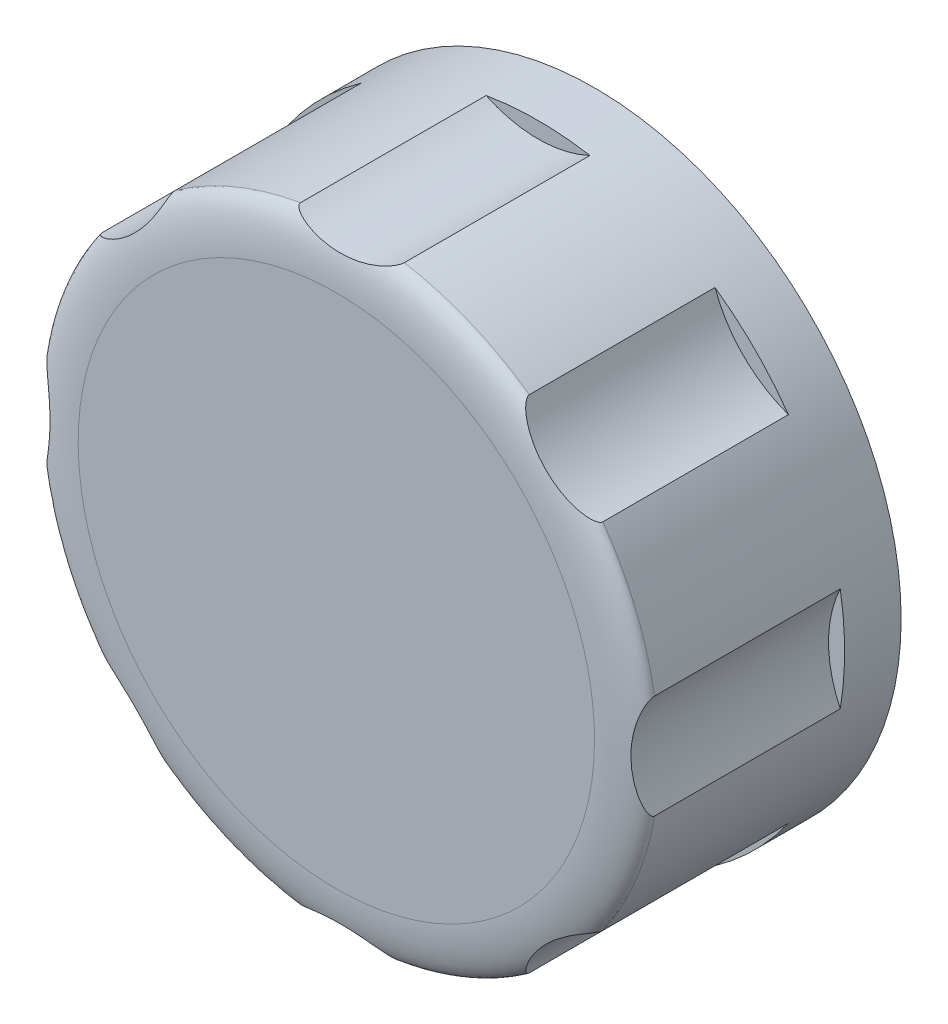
ISO-10303-21;
HEADER;
FILE_DESCRIPTION(('STEP AP214'),'2;1');
FILE_NAME('part.step','',(''),(''),'','','');
FILE_SCHEMA(('AUTOMOTIVE_DESIGN { 1 0 10303 214 1 1 1 1 }'));
ENDSEC;
DATA;
#1=APPLICATION_CONTEXT('core data for automotive mechanical design processes');
#2=APPLICATION_PROTOCOL_DEFINITION('international standard','automotive_design',2000,#1);
#3=PRODUCT_CONTEXT('',#1,'mechanical');
#4=PRODUCT('Part','Part','',(#3));
#5=PRODUCT_RELATED_PRODUCT_CATEGORY('part','',(#4));
#6=PRODUCT_DEFINITION_FORMATION('','',#4);
#7=PRODUCT_DEFINITION_CONTEXT('part definition',#1,'design');
#8=PRODUCT_DEFINITION('design','',#6,#7);
#9=PRODUCT_DEFINITION_SHAPE('','',#8);
#10=(LENGTH_UNIT() NAMED_UNIT(*) SI_UNIT(.MILLI.,.METRE.));
#11=(NAMED_UNIT(*) PLANE_ANGLE_UNIT() SI_UNIT($,.RADIAN.));
#12=(NAMED_UNIT(*) SI_UNIT($,.STERADIAN.) SOLID_ANGLE_UNIT());
#13=UNCERTAINTY_MEASURE_WITH_UNIT(LENGTH_MEASURE(1.E-05),#10,'distance_accuracy_value','');
#14=(GEOMETRIC_REPRESENTATION_CONTEXT(3) GLOBAL_UNCERTAINTY_ASSIGNED_CONTEXT((#13)) GLOBAL_UNIT_ASSIGNED_CONTEXT((#10,
#11,#12)) REPRESENTATION_CONTEXT('',''));
#15=CARTESIAN_POINT('',(0.,0.,0.));
#16=DIRECTION('',(0.,0.,1.));
#17=DIRECTION('',(1.,0.,0.));
#18=AXIS2_PLACEMENT_3D('',#15,#16,#17);
#19=CARTESIAN_POINT('',(0.,0.,16.));
#20=DIRECTION('',(0.,0.,-1.));
#21=DIRECTION('',(-1.,0.,0.));
#22=AXIS2_PLACEMENT_3D('',#19,#20,#21);
#23=CYLINDRICAL_SURFACE('',#22,19.);
#24=CARTESIAN_POINT('',(0.,0.,3.5));
#25=DIRECTION('',(0.,0.,1.));
#26=DIRECTION('',(1.,0.,0.));
#27=AXIS2_PLACEMENT_3D('',#24,#25,#26);
#28=CIRCLE('',#27,19.);
#29=CARTESIAN_POINT('',(18.7254901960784,-3.21807658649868,3.5));
#30=VERTEX_POINT('',#29);
#31=CARTESIAN_POINT('',(18.7254901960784,3.21807658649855,3.5));
#32=VERTEX_POINT('',#31);
#33=EDGE_CURVE('E13',#30,#32,#28,.T.);
#34=ORIENTED_EDGE('',*,*,#33,.F.);
#35=DIRECTION('',(0.,0.,1.));
#36=VECTOR('',#35,1.);
#37=CARTESIAN_POINT('',(18.7254901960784,-3.21807658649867,9.75));
#38=LINE('',#37,#36);
#39=CARTESIAN_POINT('',(18.7254814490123,-3.2180581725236,15.));
#40=VERTEX_POINT('',#39);
#41=EDGE_CURVE('E239',#30,#40,#38,.T.);
#42=ORIENTED_EDGE('',*,*,#41,.T.);
#43=CARTESIAN_POINT('',(19.,0.,15.));
#44=CARTESIAN_POINT('',(19.,1.24354709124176,15.));
#45=CARTESIAN_POINT('',(18.8775243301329,2.48706343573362,15.));
#46=CARTESIAN_POINT('',(18.3923163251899,4.92636880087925,15.));
#47=CARTESIAN_POINT('',(18.0295959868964,6.12209750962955,15.));
#48=CARTESIAN_POINT('',(17.0778262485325,8.41987292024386,15.));
#49=CARTESIAN_POINT('',(16.4888003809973,9.52186280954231,15.));
#50=CARTESIAN_POINT('',(15.1070448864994,11.5898060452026,15.));
#51=CARTESIAN_POINT('',(14.3143494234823,12.5557082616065,15.));
#52=CARTESIAN_POINT('',(12.5557082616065,14.3143494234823,15.));
#53=CARTESIAN_POINT('',(11.5898060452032,15.107044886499,15.));
#54=CARTESIAN_POINT('',(9.52186280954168,16.4888003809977,15.));
#55=CARTESIAN_POINT('',(8.41987292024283,17.0778262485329,15.));
#56=CARTESIAN_POINT('',(6.12209750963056,18.029595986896,15.));
#57=CARTESIAN_POINT('',(4.92636880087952,18.3923163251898,15.));
#58=CARTESIAN_POINT('',(2.48706343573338,18.8775243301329,15.));
#59=CARTESIAN_POINT('',(1.24354709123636,19.,15.));
#60=CARTESIAN_POINT('',(-1.24354709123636,19.,15.));
#61=CARTESIAN_POINT('',(-2.4870634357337,18.8775243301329,15.));
#62=CARTESIAN_POINT('',(-4.92636880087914,18.3923163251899,15.));
#63=CARTESIAN_POINT('',(-6.12209750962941,18.0295959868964,15.));
#64=CARTESIAN_POINT('',(-8.41987292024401,17.0778262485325,15.));
#65=CARTESIAN_POINT('',(-9.52186280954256,16.4888003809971,15.));
#66=CARTESIAN_POINT('',(-11.5898060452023,15.1070448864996,15.));
#67=CARTESIAN_POINT('',(-12.5557082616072,14.3143494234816,15.));
#68=CARTESIAN_POINT('',(-14.3143494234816,12.5557082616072,15.));
#69=CARTESIAN_POINT('',(-15.1070448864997,11.5898060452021,15.));
#70=CARTESIAN_POINT('',(-16.488800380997,9.52186280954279,15.));
#71=CARTESIAN_POINT('',(-17.0778262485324,8.41987292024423,15.));
#72=CARTESIAN_POINT('',(-18.0295959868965,6.12209750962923,15.));
#73=CARTESIAN_POINT('',(-18.3923163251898,4.92636880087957,15.));
#74=CARTESIAN_POINT('',(-18.877524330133,2.48706343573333,15.));
#75=CARTESIAN_POINT('',(-19.,1.24354709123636,15.));
#76=CARTESIAN_POINT('',(-19.,-1.24354709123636,15.));
#77=CARTESIAN_POINT('',(-18.877524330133,-2.4870634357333,15.));
#78=CARTESIAN_POINT('',(-18.3923163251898,-4.92636880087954,15.));
#79=CARTESIAN_POINT('',(-18.0295959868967,-6.12209750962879,15.));
#80=CARTESIAN_POINT('',(-17.0778262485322,-8.41987292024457,15.));
#81=CARTESIAN_POINT('',(-16.4888003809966,-9.52186280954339,15.));
#82=CARTESIAN_POINT('',(-15.1070448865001,-11.5898060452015,15.));
#83=CARTESIAN_POINT('',(-14.3143494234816,-12.5557082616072,15.));
#84=CARTESIAN_POINT('',(-12.5557082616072,-14.3143494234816,15.));
#85=CARTESIAN_POINT('',(-11.5898060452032,-15.107044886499,15.));
#86=CARTESIAN_POINT('',(-9.52186280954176,-16.4888003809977,15.));
#87=CARTESIAN_POINT('',(-8.41987292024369,-17.0778262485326,15.));
#88=CARTESIAN_POINT('',(-6.12209750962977,-18.0295959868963,15.));
#89=CARTESIAN_POINT('',(-4.92636880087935,-18.3923163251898,15.));
#90=CARTESIAN_POINT('',(-2.48706343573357,-18.8775243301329,15.));
#91=CARTESIAN_POINT('',(-1.24354709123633,-19.,15.));
#92=CARTESIAN_POINT('',(1.24354709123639,-19.,15.));
#93=CARTESIAN_POINT('',(2.4870634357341,-18.8775243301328,15.));
#94=CARTESIAN_POINT('',(4.92636880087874,-18.39231632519,15.));
#95=CARTESIAN_POINT('',(6.12209750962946,-18.0295959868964,15.));
#96=CARTESIAN_POINT('',(8.41987292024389,-17.0778262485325,15.));
#97=CARTESIAN_POINT('',(9.52186280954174,-16.4888003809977,15.));
#98=CARTESIAN_POINT('',(11.5898060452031,-15.107044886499,15.));
#99=CARTESIAN_POINT('',(12.5557082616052,-14.3143494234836,15.));
#100=CARTESIAN_POINT('',(14.3143494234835,-12.5557082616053,15.));
#101=CARTESIAN_POINT('',(15.1070448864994,-11.5898060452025,15.));
#102=CARTESIAN_POINT('',(16.4888003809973,-9.52186280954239,15.));
#103=CARTESIAN_POINT('',(17.0778262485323,-8.41987292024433,15.));
#104=CARTESIAN_POINT('',(18.0295959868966,-6.12209750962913,15.));
#105=CARTESIAN_POINT('',(18.3923163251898,-4.92636880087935,15.));
#106=CARTESIAN_POINT('',(18.8775243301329,-2.48706343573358,15.));
#107=CARTESIAN_POINT('',(19.,-1.24354709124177,15.));
#108=CARTESIAN_POINT('',(19.,0.,15.));
#109=(BOUNDED_CURVE() B_SPLINE_CURVE(3,(#43,#44,#45,#46,#47,#48,#49,#50,#51,#52,#53,#54,#55,#56,
#57,#58,#59,#60,#61,#62,#63,#64,#65,#66,#67,#68,#69,#70,#71,#72,#73,#74,#75,#76,#77,#78,#79,#80,
#81,#82,#83,#84,#85,#86,#87,#88,#89,#90,#91,#92,#93,#94,#95,#96,#97,#98,#99,#100,#101,#102,#103,
#104,#105,#106,#107,#108),.UNSPECIFIED.,.T.,.F.) B_SPLINE_CURVE_WITH_KNOTS((4,2,2,2,2,2,2,2,2,2,
2,2,2,2,2,2,2,2,2,2,2,2,2,2,2,2,2,2,2,2,2,2,4),(0.,0.196349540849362,0.392699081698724,
0.589048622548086,0.785398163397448,0.98174770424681,1.17809724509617,1.37444678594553,
1.5707963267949,1.76714586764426,1.96349540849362,2.15984494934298,2.35619449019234,
2.55254403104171,2.74889357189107,2.94524311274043,3.14159265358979,3.33794219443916,
3.53429173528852,3.73064127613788,3.92699081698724,4.1233403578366,4.31968989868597,
4.51603943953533,4.71238898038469,4.90873852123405,5.10508806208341,5.30143760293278,
5.49778714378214,5.6941366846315,5.89048622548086,6.08683576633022,6.28318530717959),
.UNSPECIFIED.) CURVE() GEOMETRIC_REPRESENTATION_ITEM() RATIONAL_B_SPLINE_CURVE((1.,1.,1.,1.,1.,
1.,1.,1.,1.,1.,1.,1.,1.,1.,1.,1.,1.,1.,1.,1.,1.,1.,1.,1.,1.,1.,1.,1.,1.,1.,1.,1.,1.,1.,1.,1.,1.,
1.,1.,1.,1.,1.,1.,1.,1.,1.,1.,1.,1.,1.,1.,1.,1.,1.,1.,1.,1.,1.,1.,1.,1.,1.,1.,1.,1.,1.)) REPRESENTATION_ITEM(''));
#110=CARTESIAN_POINT('',(15.5164256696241,-10.9654041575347,15.));
#111=VERTEX_POINT('',#110);
#112=EDGE_CURVE('E554',#40,#111,#109,.F.);
#113=ORIENTED_EDGE('',*,*,#112,.T.);
#114=DIRECTION('',(0.,0.,1.));
#115=VECTOR('',#114,1.);
#116=CARTESIAN_POINT('',(15.51644487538,-10.9653973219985,9.75));
#117=LINE('',#116,#115);
#118=CARTESIAN_POINT('',(15.51644487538,-10.9653973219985,3.5));
#119=VERTEX_POINT('',#118);
#120=EDGE_CURVE('E224',#111,#119,#117,.F.);
#121=ORIENTED_EDGE('',*,*,#120,.T.);
#122=CARTESIAN_POINT('',(0.,0.,3.5));
#123=DIRECTION('',(0.,0.,1.));
#124=DIRECTION('',(1.,0.,0.));
#125=AXIS2_PLACEMENT_3D('',#122,#123,#124);
#126=CIRCLE('',#125,19.);
#127=CARTESIAN_POINT('',(10.9653973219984,-15.5164448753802,3.5));
#128=VERTEX_POINT('',#127);
#129=EDGE_CURVE('E52',#128,#119,#126,.T.);
#130=ORIENTED_EDGE('',*,*,#129,.F.);
#131=DIRECTION('',(0.,0.,1.));
#132=VECTOR('',#131,1.);
#133=CARTESIAN_POINT('',(10.9653973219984,-15.5164448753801,9.75));
#134=LINE('',#133,#132);
#135=CARTESIAN_POINT('',(10.9654041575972,-15.5164256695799,15.));
#136=VERTEX_POINT('',#135);
#137=EDGE_CURVE('E229',#128,#136,#134,.T.);
#138=ORIENTED_EDGE('',*,*,#137,.T.);
#139=CARTESIAN_POINT('',(19.,0.,15.));
#140=CARTESIAN_POINT('',(19.,1.24354709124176,15.));
#141=CARTESIAN_POINT('',(18.8775243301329,2.48706343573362,15.));
#142=CARTESIAN_POINT('',(18.3923163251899,4.92636880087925,15.));
#143=CARTESIAN_POINT('',(18.0295959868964,6.12209750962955,15.));
#144=CARTESIAN_POINT('',(17.0778262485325,8.41987292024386,15.));
#145=CARTESIAN_POINT('',(16.4888003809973,9.52186280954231,15.));
#146=CARTESIAN_POINT('',(15.1070448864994,11.5898060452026,15.));
#147=CARTESIAN_POINT('',(14.3143494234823,12.5557082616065,15.));
#148=CARTESIAN_POINT('',(12.5557082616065,14.3143494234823,15.));
#149=CARTESIAN_POINT('',(11.5898060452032,15.107044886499,15.));
#150=CARTESIAN_POINT('',(9.52186280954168,16.4888003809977,15.));
#151=CARTESIAN_POINT('',(8.41987292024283,17.0778262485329,15.));
#152=CARTESIAN_POINT('',(6.12209750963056,18.029595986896,15.));
#153=CARTESIAN_POINT('',(4.92636880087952,18.3923163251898,15.));
#154=CARTESIAN_POINT('',(2.48706343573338,18.8775243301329,15.));
#155=CARTESIAN_POINT('',(1.24354709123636,19.,15.));
#156=CARTESIAN_POINT('',(-1.24354709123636,19.,15.));
#157=CARTESIAN_POINT('',(-2.4870634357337,18.8775243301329,15.));
#158=CARTESIAN_POINT('',(-4.92636880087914,18.3923163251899,15.));
#159=CARTESIAN_POINT('',(-6.12209750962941,18.0295959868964,15.));
#160=CARTESIAN_POINT('',(-8.41987292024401,17.0778262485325,15.));
#161=CARTESIAN_POINT('',(-9.52186280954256,16.4888003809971,15.));
#162=CARTESIAN_POINT('',(-11.5898060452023,15.1070448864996,15.));
#163=CARTESIAN_POINT('',(-12.5557082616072,14.3143494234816,15.));
#164=CARTESIAN_POINT('',(-14.3143494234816,12.5557082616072,15.));
#165=CARTESIAN_POINT('',(-15.1070448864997,11.5898060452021,15.));
#166=CARTESIAN_POINT('',(-16.488800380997,9.52186280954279,15.));
#167=CARTESIAN_POINT('',(-17.0778262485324,8.41987292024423,15.));
#168=CARTESIAN_POINT('',(-18.0295959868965,6.12209750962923,15.));
#169=CARTESIAN_POINT('',(-18.3923163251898,4.92636880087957,15.));
#170=CARTESIAN_POINT('',(-18.877524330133,2.48706343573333,15.));
#171=CARTESIAN_POINT('',(-19.,1.24354709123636,15.));
#172=CARTESIAN_POINT('',(-19.,-1.24354709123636,15.));
#173=CARTESIAN_POINT('',(-18.877524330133,-2.4870634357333,15.));
#174=CARTESIAN_POINT('',(-18.3923163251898,-4.92636880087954,15.));
#175=CARTESIAN_POINT('',(-18.0295959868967,-6.12209750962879,15.));
#176=CARTESIAN_POINT('',(-17.0778262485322,-8.41987292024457,15.));
#177=CARTESIAN_POINT('',(-16.4888003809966,-9.52186280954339,15.));
#178=CARTESIAN_POINT('',(-15.1070448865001,-11.5898060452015,15.));
#179=CARTESIAN_POINT('',(-14.3143494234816,-12.5557082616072,15.));
#180=CARTESIAN_POINT('',(-12.5557082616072,-14.3143494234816,15.));
#181=CARTESIAN_POINT('',(-11.5898060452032,-15.107044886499,15.));
#182=CARTESIAN_POINT('',(-9.52186280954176,-16.4888003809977,15.));
#183=CARTESIAN_POINT('',(-8.41987292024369,-17.0778262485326,15.));
#184=CARTESIAN_POINT('',(-6.12209750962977,-18.0295959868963,15.));
#185=CARTESIAN_POINT('',(-4.92636880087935,-18.3923163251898,15.));
#186=CARTESIAN_POINT('',(-2.48706343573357,-18.8775243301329,15.));
#187=CARTESIAN_POINT('',(-1.24354709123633,-19.,15.));
#188=CARTESIAN_POINT('',(1.24354709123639,-19.,15.));
#189=CARTESIAN_POINT('',(2.4870634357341,-18.8775243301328,15.));
#190=CARTESIAN_POINT('',(4.92636880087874,-18.39231632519,15.));
#191=CARTESIAN_POINT('',(6.12209750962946,-18.0295959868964,15.));
#192=CARTESIAN_POINT('',(8.41987292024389,-17.0778262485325,15.));
#193=CARTESIAN_POINT('',(9.52186280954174,-16.4888003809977,15.));
#194=CARTESIAN_POINT('',(11.5898060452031,-15.107044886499,15.));
#195=CARTESIAN_POINT('',(12.5557082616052,-14.3143494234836,15.));
#196=CARTESIAN_POINT('',(14.3143494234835,-12.5557082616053,15.));
#197=CARTESIAN_POINT('',(15.1070448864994,-11.5898060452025,15.));
#198=CARTESIAN_POINT('',(16.4888003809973,-9.52186280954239,15.));
#199=CARTESIAN_POINT('',(17.0778262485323,-8.41987292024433,15.));
#200=CARTESIAN_POINT('',(18.0295959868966,-6.12209750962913,15.));
#201=CARTESIAN_POINT('',(18.3923163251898,-4.92636880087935,15.));
#202=CARTESIAN_POINT('',(18.8775243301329,-2.48706343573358,15.));
#203=CARTESIAN_POINT('',(19.,-1.24354709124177,15.));
#204=CARTESIAN_POINT('',(19.,0.,15.));
#205=(BOUNDED_CURVE() B_SPLINE_CURVE(3,(#139,#140,#141,#142,#143,#144,#145,#146,#147,#148,#149,
#150,#151,#152,#153,#154,#155,#156,#157,#158,#159,#160,#161,#162,#163,#164,#165,#166,#167,#168,
#169,#170,#171,#172,#173,#174,#175,#176,#177,#178,#179,#180,#181,#182,#183,#184,#185,#186,#187,
#188,#189,#190,#191,#192,#193,#194,#195,#196,#197,#198,#199,#200,#201,#202,#203,#204),
.UNSPECIFIED.,.T.,.F.) B_SPLINE_CURVE_WITH_KNOTS((4,2,2,2,2,2,2,2,2,2,2,2,2,2,2,2,2,2,2,2,2,2,2,
2,2,2,2,2,2,2,2,2,4),(0.,0.196349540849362,0.392699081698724,0.589048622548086,
0.785398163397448,0.98174770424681,1.17809724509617,1.37444678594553,1.5707963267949,
1.76714586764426,1.96349540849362,2.15984494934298,2.35619449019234,2.55254403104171,
2.74889357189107,2.94524311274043,3.14159265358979,3.33794219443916,3.53429173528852,
3.73064127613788,3.92699081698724,4.1233403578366,4.31968989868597,4.51603943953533,
4.71238898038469,4.90873852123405,5.10508806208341,5.30143760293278,5.49778714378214,
5.6941366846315,5.89048622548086,6.08683576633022,6.28318530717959),
.UNSPECIFIED.) CURVE() GEOMETRIC_REPRESENTATION_ITEM() RATIONAL_B_SPLINE_CURVE((1.,1.,1.,1.,1.,
1.,1.,1.,1.,1.,1.,1.,1.,1.,1.,1.,1.,1.,1.,1.,1.,1.,1.,1.,1.,1.,1.,1.,1.,1.,1.,1.,1.,1.,1.,1.,1.,
1.,1.,1.,1.,1.,1.,1.,1.,1.,1.,1.,1.,1.,1.,1.,1.,1.,1.,1.,1.,1.,1.,1.,1.,1.,1.,1.,1.,1.)) REPRESENTATION_ITEM(''));
#206=CARTESIAN_POINT('',(3.21805817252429,-18.7254814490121,15.));
#207=VERTEX_POINT('',#206);
#208=EDGE_CURVE('E559',#136,#207,#205,.F.);
#209=ORIENTED_EDGE('',*,*,#208,.T.);
#210=DIRECTION('',(0.,0.,1.));
#211=VECTOR('',#210,1.);
#212=CARTESIAN_POINT('',(3.21807658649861,-18.7254901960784,9.75));
#213=LINE('',#212,#211);
#214=CARTESIAN_POINT('',(3.21807658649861,-18.7254901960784,3.5));
#215=VERTEX_POINT('',#214);
#216=EDGE_CURVE('E214',#207,#215,#213,.F.);
#217=ORIENTED_EDGE('',*,*,#216,.T.);
#218=CARTESIAN_POINT('',(0.,0.,3.5));
#219=DIRECTION('',(0.,0.,1.));
#220=DIRECTION('',(1.,0.,0.));
#221=AXIS2_PLACEMENT_3D('',#218,#219,#220);
#222=CIRCLE('',#221,19.);
#223=CARTESIAN_POINT('',(-3.21807658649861,-18.7254901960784,3.5));
#224=VERTEX_POINT('',#223);
#225=EDGE_CURVE('E544',#224,#215,#222,.T.);
#226=ORIENTED_EDGE('',*,*,#225,.F.);
#227=DIRECTION('',(0.,0.,1.));
#228=VECTOR('',#227,1.);
#229=CARTESIAN_POINT('',(-3.21807658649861,-18.7254901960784,9.75));
#230=LINE('',#229,#228);
#231=CARTESIAN_POINT('',(-3.21805817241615,-18.7254814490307,15.));
#232=VERTEX_POINT('',#231);
#233=EDGE_CURVE('E219',#224,#232,#230,.T.);
#234=ORIENTED_EDGE('',*,*,#233,.T.);
#235=CARTESIAN_POINT('',(19.,0.,15.));
#236=CARTESIAN_POINT('',(19.,1.24354709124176,15.));
#237=CARTESIAN_POINT('',(18.8775243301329,2.48706343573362,15.));
#238=CARTESIAN_POINT('',(18.3923163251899,4.92636880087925,15.));
#239=CARTESIAN_POINT('',(18.0295959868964,6.12209750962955,15.));
#240=CARTESIAN_POINT('',(17.0778262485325,8.41987292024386,15.));
#241=CARTESIAN_POINT('',(16.4888003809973,9.52186280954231,15.));
#242=CARTESIAN_POINT('',(15.1070448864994,11.5898060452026,15.));
#243=CARTESIAN_POINT('',(14.3143494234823,12.5557082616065,15.));
#244=CARTESIAN_POINT('',(12.5557082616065,14.3143494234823,15.));
#245=CARTESIAN_POINT('',(11.5898060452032,15.107044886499,15.));
#246=CARTESIAN_POINT('',(9.52186280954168,16.4888003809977,15.));
#247=CARTESIAN_POINT('',(8.41987292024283,17.0778262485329,15.));
#248=CARTESIAN_POINT('',(6.12209750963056,18.029595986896,15.));
#249=CARTESIAN_POINT('',(4.92636880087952,18.3923163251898,15.));
#250=CARTESIAN_POINT('',(2.48706343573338,18.8775243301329,15.));
#251=CARTESIAN_POINT('',(1.24354709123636,19.,15.));
#252=CARTESIAN_POINT('',(-1.24354709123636,19.,15.));
#253=CARTESIAN_POINT('',(-2.4870634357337,18.8775243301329,15.));
#254=CARTESIAN_POINT('',(-4.92636880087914,18.3923163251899,15.));
#255=CARTESIAN_POINT('',(-6.12209750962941,18.0295959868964,15.));
#256=CARTESIAN_POINT('',(-8.41987292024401,17.0778262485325,15.));
#257=CARTESIAN_POINT('',(-9.52186280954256,16.4888003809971,15.));
#258=CARTESIAN_POINT('',(-11.5898060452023,15.1070448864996,15.));
#259=CARTESIAN_POINT('',(-12.5557082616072,14.3143494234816,15.));
#260=CARTESIAN_POINT('',(-14.3143494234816,12.5557082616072,15.));
#261=CARTESIAN_POINT('',(-15.1070448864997,11.5898060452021,15.));
#262=CARTESIAN_POINT('',(-16.488800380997,9.52186280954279,15.));
#263=CARTESIAN_POINT('',(-17.0778262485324,8.41987292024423,15.));
#264=CARTESIAN_POINT('',(-18.0295959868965,6.12209750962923,15.));
#265=CARTESIAN_POINT('',(-18.3923163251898,4.92636880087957,15.));
#266=CARTESIAN_POINT('',(-18.877524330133,2.48706343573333,15.));
#267=CARTESIAN_POINT('',(-19.,1.24354709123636,15.));
#268=CARTESIAN_POINT('',(-19.,-1.24354709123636,15.));
#269=CARTESIAN_POINT('',(-18.877524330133,-2.4870634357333,15.));
#270=CARTESIAN_POINT('',(-18.3923163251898,-4.92636880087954,15.));
#271=CARTESIAN_POINT('',(-18.0295959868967,-6.12209750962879,15.));
#272=CARTESIAN_POINT('',(-17.0778262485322,-8.41987292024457,15.));
#273=CARTESIAN_POINT('',(-16.4888003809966,-9.52186280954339,15.));
#274=CARTESIAN_POINT('',(-15.1070448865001,-11.5898060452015,15.));
#275=CARTESIAN_POINT('',(-14.3143494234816,-12.5557082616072,15.));
#276=CARTESIAN_POINT('',(-12.5557082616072,-14.3143494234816,15.));
#277=CARTESIAN_POINT('',(-11.5898060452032,-15.107044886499,15.));
#278=CARTESIAN_POINT('',(-9.52186280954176,-16.4888003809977,15.));
#279=CARTESIAN_POINT('',(-8.41987292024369,-17.0778262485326,15.));
#280=CARTESIAN_POINT('',(-6.12209750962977,-18.0295959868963,15.));
#281=CARTESIAN_POINT('',(-4.92636880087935,-18.3923163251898,15.));
#282=CARTESIAN_POINT('',(-2.48706343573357,-18.8775243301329,15.));
#283=CARTESIAN_POINT('',(-1.24354709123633,-19.,15.));
#284=CARTESIAN_POINT('',(1.24354709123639,-19.,15.));
#285=CARTESIAN_POINT('',(2.4870634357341,-18.8775243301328,15.));
#286=CARTESIAN_POINT('',(4.92636880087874,-18.39231632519,15.));
#287=CARTESIAN_POINT('',(6.12209750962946,-18.0295959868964,15.));
#288=CARTESIAN_POINT('',(8.41987292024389,-17.0778262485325,15.));
#289=CARTESIAN_POINT('',(9.52186280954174,-16.4888003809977,15.));
#290=CARTESIAN_POINT('',(11.5898060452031,-15.107044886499,15.));
#291=CARTESIAN_POINT('',(12.5557082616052,-14.3143494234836,15.));
#292=CARTESIAN_POINT('',(14.3143494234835,-12.5557082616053,15.));
#293=CARTESIAN_POINT('',(15.1070448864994,-11.5898060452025,15.));
#294=CARTESIAN_POINT('',(16.4888003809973,-9.52186280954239,15.));
#295=CARTESIAN_POINT('',(17.0778262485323,-8.41987292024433,15.));
#296=CARTESIAN_POINT('',(18.0295959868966,-6.12209750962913,15.));
#297=CARTESIAN_POINT('',(18.3923163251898,-4.92636880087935,15.));
#298=CARTESIAN_POINT('',(18.8775243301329,-2.48706343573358,15.));
#299=CARTESIAN_POINT('',(19.,-1.24354709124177,15.));
#300=CARTESIAN_POINT('',(19.,0.,15.));
#301=(BOUNDED_CURVE() B_SPLINE_CURVE(3,(#235,#236,#237,#238,#239,#240,#241,#242,#243,#244,#245,
#246,#247,#248,#249,#250,#251,#252,#253,#254,#255,#256,#257,#258,#259,#260,#261,#262,#263,#264,
#265,#266,#267,#268,#269,#270,#271,#272,#273,#274,#275,#276,#277,#278,#279,#280,#281,#282,#283,
#284,#285,#286,#287,#288,#289,#290,#291,#292,#293,#294,#295,#296,#297,#298,#299,#300),
.UNSPECIFIED.,.T.,.F.) B_SPLINE_CURVE_WITH_KNOTS((4,2,2,2,2,2,2,2,2,2,2,2,2,2,2,2,2,2,2,2,2,2,2,
2,2,2,2,2,2,2,2,2,4),(0.,0.196349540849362,0.392699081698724,0.589048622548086,
0.785398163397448,0.98174770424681,1.17809724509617,1.37444678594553,1.5707963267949,
1.76714586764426,1.96349540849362,2.15984494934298,2.35619449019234,2.55254403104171,
2.74889357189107,2.94524311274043,3.14159265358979,3.33794219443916,3.53429173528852,
3.73064127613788,3.92699081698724,4.1233403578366,4.31968989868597,4.51603943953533,
4.71238898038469,4.90873852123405,5.10508806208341,5.30143760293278,5.49778714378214,
5.6941366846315,5.89048622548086,6.08683576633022,6.28318530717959),
.UNSPECIFIED.) CURVE() GEOMETRIC_REPRESENTATION_ITEM() RATIONAL_B_SPLINE_CURVE((1.,1.,1.,1.,1.,
1.,1.,1.,1.,1.,1.,1.,1.,1.,1.,1.,1.,1.,1.,1.,1.,1.,1.,1.,1.,1.,1.,1.,1.,1.,1.,1.,1.,1.,1.,1.,1.,
1.,1.,1.,1.,1.,1.,1.,1.,1.,1.,1.,1.,1.,1.,1.,1.,1.,1.,1.,1.,1.,1.,1.,1.,1.,1.,1.,1.,1.)) REPRESENTATION_ITEM(''));
#302=CARTESIAN_POINT('',(-10.9654041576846,-15.5164256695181,15.));
#303=VERTEX_POINT('',#302);
#304=EDGE_CURVE('E607',#232,#303,#301,.F.);
#305=ORIENTED_EDGE('',*,*,#304,.T.);
#306=DIRECTION('',(0.,0.,1.));
#307=VECTOR('',#306,1.);
#308=CARTESIAN_POINT('',(-10.9653973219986,-15.51644487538,9.75));
#309=LINE('',#308,#307);
#310=CARTESIAN_POINT('',(-10.9653973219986,-15.51644487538,3.5));
#311=VERTEX_POINT('',#310);
#312=EDGE_CURVE('E204',#303,#311,#309,.F.);
#313=ORIENTED_EDGE('',*,*,#312,.T.);
#314=CARTESIAN_POINT('',(0.,0.,3.5));
#315=DIRECTION('',(0.,0.,1.));
#316=DIRECTION('',(1.,0.,0.));
#317=AXIS2_PLACEMENT_3D('',#314,#315,#316);
#318=CIRCLE('',#317,19.);
#319=CARTESIAN_POINT('',(-15.5164448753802,-10.9653973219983,3.5));
#320=VERTEX_POINT('',#319);
#321=EDGE_CURVE('E542',#320,#311,#318,.T.);
#322=ORIENTED_EDGE('',*,*,#321,.F.);
#323=DIRECTION('',(0.,0.,1.));
#324=VECTOR('',#323,1.);
#325=CARTESIAN_POINT('',(-15.5164448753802,-10.9653973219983,9.75));
#326=LINE('',#325,#324);
#327=CARTESIAN_POINT('',(-15.5164256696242,-10.9654041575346,15.));
#328=VERTEX_POINT('',#327);
#329=EDGE_CURVE('E209',#320,#328,#326,.T.);
#330=ORIENTED_EDGE('',*,*,#329,.T.);
#331=CARTESIAN_POINT('',(19.,0.,15.));
#332=CARTESIAN_POINT('',(19.,1.24354709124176,15.));
#333=CARTESIAN_POINT('',(18.8775243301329,2.48706343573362,15.));
#334=CARTESIAN_POINT('',(18.3923163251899,4.92636880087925,15.));
#335=CARTESIAN_POINT('',(18.0295959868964,6.12209750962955,15.));
#336=CARTESIAN_POINT('',(17.0778262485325,8.41987292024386,15.));
#337=CARTESIAN_POINT('',(16.4888003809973,9.52186280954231,15.));
#338=CARTESIAN_POINT('',(15.1070448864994,11.5898060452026,15.));
#339=CARTESIAN_POINT('',(14.3143494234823,12.5557082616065,15.));
#340=CARTESIAN_POINT('',(12.5557082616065,14.3143494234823,15.));
#341=CARTESIAN_POINT('',(11.5898060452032,15.107044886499,15.));
#342=CARTESIAN_POINT('',(9.52186280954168,16.4888003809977,15.));
#343=CARTESIAN_POINT('',(8.41987292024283,17.0778262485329,15.));
#344=CARTESIAN_POINT('',(6.12209750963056,18.029595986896,15.));
#345=CARTESIAN_POINT('',(4.92636880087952,18.3923163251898,15.));
#346=CARTESIAN_POINT('',(2.48706343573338,18.8775243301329,15.));
#347=CARTESIAN_POINT('',(1.24354709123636,19.,15.));
#348=CARTESIAN_POINT('',(-1.24354709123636,19.,15.));
#349=CARTESIAN_POINT('',(-2.4870634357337,18.8775243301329,15.));
#350=CARTESIAN_POINT('',(-4.92636880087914,18.3923163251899,15.));
#351=CARTESIAN_POINT('',(-6.12209750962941,18.0295959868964,15.));
#352=CARTESIAN_POINT('',(-8.41987292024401,17.0778262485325,15.));
#353=CARTESIAN_POINT('',(-9.52186280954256,16.4888003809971,15.));
#354=CARTESIAN_POINT('',(-11.5898060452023,15.1070448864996,15.));
#355=CARTESIAN_POINT('',(-12.5557082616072,14.3143494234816,15.));
#356=CARTESIAN_POINT('',(-14.3143494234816,12.5557082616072,15.));
#357=CARTESIAN_POINT('',(-15.1070448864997,11.5898060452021,15.));
#358=CARTESIAN_POINT('',(-16.488800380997,9.52186280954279,15.));
#359=CARTESIAN_POINT('',(-17.0778262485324,8.41987292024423,15.));
#360=CARTESIAN_POINT('',(-18.0295959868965,6.12209750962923,15.));
#361=CARTESIAN_POINT('',(-18.3923163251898,4.92636880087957,15.));
#362=CARTESIAN_POINT('',(-18.877524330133,2.48706343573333,15.));
#363=CARTESIAN_POINT('',(-19.,1.24354709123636,15.));
#364=CARTESIAN_POINT('',(-19.,-1.24354709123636,15.));
#365=CARTESIAN_POINT('',(-18.877524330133,-2.4870634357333,15.));
#366=CARTESIAN_POINT('',(-18.3923163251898,-4.92636880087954,15.));
#367=CARTESIAN_POINT('',(-18.0295959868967,-6.12209750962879,15.));
#368=CARTESIAN_POINT('',(-17.0778262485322,-8.41987292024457,15.));
#369=CARTESIAN_POINT('',(-16.4888003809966,-9.52186280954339,15.));
#370=CARTESIAN_POINT('',(-15.1070448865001,-11.5898060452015,15.));
#371=CARTESIAN_POINT('',(-14.3143494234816,-12.5557082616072,15.));
#372=CARTESIAN_POINT('',(-12.5557082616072,-14.3143494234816,15.));
#373=CARTESIAN_POINT('',(-11.5898060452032,-15.107044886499,15.));
#374=CARTESIAN_POINT('',(-9.52186280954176,-16.4888003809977,15.));
#375=CARTESIAN_POINT('',(-8.41987292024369,-17.0778262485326,15.));
#376=CARTESIAN_POINT('',(-6.12209750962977,-18.0295959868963,15.));
#377=CARTESIAN_POINT('',(-4.92636880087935,-18.3923163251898,15.));
#378=CARTESIAN_POINT('',(-2.48706343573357,-18.8775243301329,15.));
#379=CARTESIAN_POINT('',(-1.24354709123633,-19.,15.));
#380=CARTESIAN_POINT('',(1.24354709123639,-19.,15.));
#381=CARTESIAN_POINT('',(2.4870634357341,-18.8775243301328,15.));
#382=CARTESIAN_POINT('',(4.92636880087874,-18.39231632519,15.));
#383=CARTESIAN_POINT('',(6.12209750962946,-18.0295959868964,15.));
#384=CARTESIAN_POINT('',(8.41987292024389,-17.0778262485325,15.));
#385=CARTESIAN_POINT('',(9.52186280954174,-16.4888003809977,15.));
#386=CARTESIAN_POINT('',(11.5898060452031,-15.107044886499,15.));
#387=CARTESIAN_POINT('',(12.5557082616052,-14.3143494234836,15.));
#388=CARTESIAN_POINT('',(14.3143494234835,-12.5557082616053,15.));
#389=CARTESIAN_POINT('',(15.1070448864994,-11.5898060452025,15.));
#390=CARTESIAN_POINT('',(16.4888003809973,-9.52186280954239,15.));
#391=CARTESIAN_POINT('',(17.0778262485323,-8.41987292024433,15.));
#392=CARTESIAN_POINT('',(18.0295959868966,-6.12209750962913,15.));
#393=CARTESIAN_POINT('',(18.3923163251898,-4.92636880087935,15.));
#394=CARTESIAN_POINT('',(18.8775243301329,-2.48706343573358,15.));
#395=CARTESIAN_POINT('',(19.,-1.24354709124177,15.));
#396=CARTESIAN_POINT('',(19.,0.,15.));
#397=(BOUNDED_CURVE() B_SPLINE_CURVE(3,(#331,#332,#333,#334,#335,#336,#337,#338,#339,#340,#341,
#342,#343,#344,#345,#346,#347,#348,#349,#350,#351,#352,#353,#354,#355,#356,#357,#358,#359,#360,
#361,#362,#363,#364,#365,#366,#367,#368,#369,#370,#371,#372,#373,#374,#375,#376,#377,#378,#379,
#380,#381,#382,#383,#384,#385,#386,#387,#388,#389,#390,#391,#392,#393,#394,#395,#396),
.UNSPECIFIED.,.T.,.F.) B_SPLINE_CURVE_WITH_KNOTS((4,2,2,2,2,2,2,2,2,2,2,2,2,2,2,2,2,2,2,2,2,2,2,
2,2,2,2,2,2,2,2,2,4),(0.,0.196349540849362,0.392699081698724,0.589048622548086,
0.785398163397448,0.98174770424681,1.17809724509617,1.37444678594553,1.5707963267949,
1.76714586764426,1.96349540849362,2.15984494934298,2.35619449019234,2.55254403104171,
2.74889357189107,2.94524311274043,3.14159265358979,3.33794219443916,3.53429173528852,
3.73064127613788,3.92699081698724,4.1233403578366,4.31968989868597,4.51603943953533,
4.71238898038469,4.90873852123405,5.10508806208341,5.30143760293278,5.49778714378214,
5.6941366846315,5.89048622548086,6.08683576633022,6.28318530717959),
.UNSPECIFIED.) CURVE() GEOMETRIC_REPRESENTATION_ITEM() RATIONAL_B_SPLINE_CURVE((1.,1.,1.,1.,1.,
1.,1.,1.,1.,1.,1.,1.,1.,1.,1.,1.,1.,1.,1.,1.,1.,1.,1.,1.,1.,1.,1.,1.,1.,1.,1.,1.,1.,1.,1.,1.,1.,
1.,1.,1.,1.,1.,1.,1.,1.,1.,1.,1.,1.,1.,1.,1.,1.,1.,1.,1.,1.,1.,1.,1.,1.,1.,1.,1.,1.,1.)) REPRESENTATION_ITEM(''));
#398=CARTESIAN_POINT('',(-18.7254814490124,-3.21805817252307,15.));
#399=VERTEX_POINT('',#398);
#400=EDGE_CURVE('E605',#328,#399,#397,.F.);
#401=ORIENTED_EDGE('',*,*,#400,.T.);
#402=DIRECTION('',(0.,0.,1.));
#403=VECTOR('',#402,1.);
#404=CARTESIAN_POINT('',(-18.7254901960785,-3.21807658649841,9.75));
#405=LINE('',#404,#403);
#406=CARTESIAN_POINT('',(-18.7254901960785,-3.21807658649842,3.5));
#407=VERTEX_POINT('',#406);
#408=EDGE_CURVE('E67',#399,#407,#405,.F.);
#409=ORIENTED_EDGE('',*,*,#408,.T.);
#410=CARTESIAN_POINT('',(0.,0.,3.5));
#411=DIRECTION('',(0.,0.,1.));
#412=DIRECTION('',(1.,0.,0.));
#413=AXIS2_PLACEMENT_3D('',#410,#411,#412);
#414=CIRCLE('',#413,19.);
#415=CARTESIAN_POINT('',(-18.7254901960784,3.21807658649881,3.5));
#416=VERTEX_POINT('',#415);
#417=EDGE_CURVE('E540',#416,#407,#414,.T.);
#418=ORIENTED_EDGE('',*,*,#417,.F.);
#419=DIRECTION('',(0.,0.,1.));
#420=VECTOR('',#419,1.);
#421=CARTESIAN_POINT('',(-18.7254901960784,3.2180765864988,9.75));
#422=LINE('',#421,#420);
#423=CARTESIAN_POINT('',(-18.7254814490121,3.21805817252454,15.));
#424=VERTEX_POINT('',#423);
#425=EDGE_CURVE('E199',#416,#424,#422,.T.);
#426=ORIENTED_EDGE('',*,*,#425,.T.);
#427=CARTESIAN_POINT('',(19.,0.,15.));
#428=CARTESIAN_POINT('',(19.,1.24354709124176,15.));
#429=CARTESIAN_POINT('',(18.8775243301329,2.48706343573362,15.));
#430=CARTESIAN_POINT('',(18.3923163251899,4.92636880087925,15.));
#431=CARTESIAN_POINT('',(18.0295959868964,6.12209750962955,15.));
#432=CARTESIAN_POINT('',(17.0778262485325,8.41987292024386,15.));
#433=CARTESIAN_POINT('',(16.4888003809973,9.52186280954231,15.));
#434=CARTESIAN_POINT('',(15.1070448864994,11.5898060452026,15.));
#435=CARTESIAN_POINT('',(14.3143494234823,12.5557082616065,15.));
#436=CARTESIAN_POINT('',(12.5557082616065,14.3143494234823,15.));
#437=CARTESIAN_POINT('',(11.5898060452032,15.107044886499,15.));
#438=CARTESIAN_POINT('',(9.52186280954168,16.4888003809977,15.));
#439=CARTESIAN_POINT('',(8.41987292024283,17.0778262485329,15.));
#440=CARTESIAN_POINT('',(6.12209750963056,18.029595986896,15.));
#441=CARTESIAN_POINT('',(4.92636880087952,18.3923163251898,15.));
#442=CARTESIAN_POINT('',(2.48706343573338,18.8775243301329,15.));
#443=CARTESIAN_POINT('',(1.24354709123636,19.,15.));
#444=CARTESIAN_POINT('',(-1.24354709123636,19.,15.));
#445=CARTESIAN_POINT('',(-2.4870634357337,18.8775243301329,15.));
#446=CARTESIAN_POINT('',(-4.92636880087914,18.3923163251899,15.));
#447=CARTESIAN_POINT('',(-6.12209750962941,18.0295959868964,15.));
#448=CARTESIAN_POINT('',(-8.41987292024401,17.0778262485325,15.));
#449=CARTESIAN_POINT('',(-9.52186280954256,16.4888003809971,15.));
#450=CARTESIAN_POINT('',(-11.5898060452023,15.1070448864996,15.));
#451=CARTESIAN_POINT('',(-12.5557082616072,14.3143494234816,15.));
#452=CARTESIAN_POINT('',(-14.3143494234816,12.5557082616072,15.));
#453=CARTESIAN_POINT('',(-15.1070448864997,11.5898060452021,15.));
#454=CARTESIAN_POINT('',(-16.488800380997,9.52186280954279,15.));
#455=CARTESIAN_POINT('',(-17.0778262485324,8.41987292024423,15.));
#456=CARTESIAN_POINT('',(-18.0295959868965,6.12209750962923,15.));
#457=CARTESIAN_POINT('',(-18.3923163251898,4.92636880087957,15.));
#458=CARTESIAN_POINT('',(-18.877524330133,2.48706343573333,15.));
#459=CARTESIAN_POINT('',(-19.,1.24354709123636,15.));
#460=CARTESIAN_POINT('',(-19.,-1.24354709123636,15.));
#461=CARTESIAN_POINT('',(-18.877524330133,-2.4870634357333,15.));
#462=CARTESIAN_POINT('',(-18.3923163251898,-4.92636880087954,15.));
#463=CARTESIAN_POINT('',(-18.0295959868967,-6.12209750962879,15.));
#464=CARTESIAN_POINT('',(-17.0778262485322,-8.41987292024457,15.));
#465=CARTESIAN_POINT('',(-16.4888003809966,-9.52186280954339,15.));
#466=CARTESIAN_POINT('',(-15.1070448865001,-11.5898060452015,15.));
#467=CARTESIAN_POINT('',(-14.3143494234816,-12.5557082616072,15.));
#468=CARTESIAN_POINT('',(-12.5557082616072,-14.3143494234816,15.));
#469=CARTESIAN_POINT('',(-11.5898060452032,-15.107044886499,15.));
#470=CARTESIAN_POINT('',(-9.52186280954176,-16.4888003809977,15.));
#471=CARTESIAN_POINT('',(-8.41987292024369,-17.0778262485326,15.));
#472=CARTESIAN_POINT('',(-6.12209750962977,-18.0295959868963,15.));
#473=CARTESIAN_POINT('',(-4.92636880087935,-18.3923163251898,15.));
#474=CARTESIAN_POINT('',(-2.48706343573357,-18.8775243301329,15.));
#475=CARTESIAN_POINT('',(-1.24354709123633,-19.,15.));
#476=CARTESIAN_POINT('',(1.24354709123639,-19.,15.));
#477=CARTESIAN_POINT('',(2.4870634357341,-18.8775243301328,15.));
#478=CARTESIAN_POINT('',(4.92636880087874,-18.39231632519,15.));
#479=CARTESIAN_POINT('',(6.12209750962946,-18.0295959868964,15.));
#480=CARTESIAN_POINT('',(8.41987292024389,-17.0778262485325,15.));
#481=CARTESIAN_POINT('',(9.52186280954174,-16.4888003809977,15.));
#482=CARTESIAN_POINT('',(11.5898060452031,-15.107044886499,15.));
#483=CARTESIAN_POINT('',(12.5557082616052,-14.3143494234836,15.));
#484=CARTESIAN_POINT('',(14.3143494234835,-12.5557082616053,15.));
#485=CARTESIAN_POINT('',(15.1070448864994,-11.5898060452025,15.));
#486=CARTESIAN_POINT('',(16.4888003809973,-9.52186280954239,15.));
#487=CARTESIAN_POINT('',(17.0778262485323,-8.41987292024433,15.));
#488=CARTESIAN_POINT('',(18.0295959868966,-6.12209750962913,15.));
#489=CARTESIAN_POINT('',(18.3923163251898,-4.92636880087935,15.));
#490=CARTESIAN_POINT('',(18.8775243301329,-2.48706343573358,15.));
#491=CARTESIAN_POINT('',(19.,-1.24354709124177,15.));
#492=CARTESIAN_POINT('',(19.,0.,15.));
#493=(BOUNDED_CURVE() B_SPLINE_CURVE(3,(#427,#428,#429,#430,#431,#432,#433,#434,#435,#436,#437,
#438,#439,#440,#441,#442,#443,#444,#445,#446,#447,#448,#449,#450,#451,#452,#453,#454,#455,#456,
#457,#458,#459,#460,#461,#462,#463,#464,#465,#466,#467,#468,#469,#470,#471,#472,#473,#474,#475,
#476,#477,#478,#479,#480,#481,#482,#483,#484,#485,#486,#487,#488,#489,#490,#491,#492),
.UNSPECIFIED.,.T.,.F.) B_SPLINE_CURVE_WITH_KNOTS((4,2,2,2,2,2,2,2,2,2,2,2,2,2,2,2,2,2,2,2,2,2,2,
2,2,2,2,2,2,2,2,2,4),(0.,0.196349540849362,0.392699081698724,0.589048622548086,
0.785398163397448,0.98174770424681,1.17809724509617,1.37444678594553,1.5707963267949,
1.76714586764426,1.96349540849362,2.15984494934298,2.35619449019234,2.55254403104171,
2.74889357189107,2.94524311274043,3.14159265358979,3.33794219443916,3.53429173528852,
3.73064127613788,3.92699081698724,4.1233403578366,4.31968989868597,4.51603943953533,
4.71238898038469,4.90873852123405,5.10508806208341,5.30143760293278,5.49778714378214,
5.6941366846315,5.89048622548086,6.08683576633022,6.28318530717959),
.UNSPECIFIED.) CURVE() GEOMETRIC_REPRESENTATION_ITEM() RATIONAL_B_SPLINE_CURVE((1.,1.,1.,1.,1.,
1.,1.,1.,1.,1.,1.,1.,1.,1.,1.,1.,1.,1.,1.,1.,1.,1.,1.,1.,1.,1.,1.,1.,1.,1.,1.,1.,1.,1.,1.,1.,1.,
1.,1.,1.,1.,1.,1.,1.,1.,1.,1.,1.,1.,1.,1.,1.,1.,1.,1.,1.,1.,1.,1.,1.,1.,1.,1.,1.,1.,1.)) REPRESENTATION_ITEM(''));
#494=CARTESIAN_POINT('',(-15.5164256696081,10.9654041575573,15.));
#495=VERTEX_POINT('',#494);
#496=EDGE_CURVE('E598',#424,#495,#493,.F.);
#497=ORIENTED_EDGE('',*,*,#496,.T.);
#498=DIRECTION('',(0.,0.,1.));
#499=VECTOR('',#498,1.);
#500=CARTESIAN_POINT('',(-15.51644487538,10.9653973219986,9.75));
#501=LINE('',#500,#499);
#502=CARTESIAN_POINT('',(-15.51644487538,10.9653973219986,3.5));
#503=VERTEX_POINT('',#502);
#504=EDGE_CURVE('E59',#495,#503,#501,.F.);
#505=ORIENTED_EDGE('',*,*,#504,.T.);
#506=CARTESIAN_POINT('',(0.,0.,3.5));
#507=DIRECTION('',(0.,0.,1.));
#508=DIRECTION('',(1.,0.,0.));
#509=AXIS2_PLACEMENT_3D('',#506,#507,#508);
#510=CIRCLE('',#509,19.);
#511=CARTESIAN_POINT('',(-10.9653973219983,15.5164448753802,3.5));
#512=VERTEX_POINT('',#511);
#513=EDGE_CURVE('E165',#512,#503,#510,.T.);
#514=ORIENTED_EDGE('',*,*,#513,.F.);
#515=DIRECTION('',(0.,0.,1.));
#516=VECTOR('',#515,1.);
#517=CARTESIAN_POINT('',(-10.9653973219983,15.5164448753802,9.75));
#518=LINE('',#517,#516);
#519=CARTESIAN_POINT('',(-10.9654041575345,15.5164256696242,15.));
#520=VERTEX_POINT('',#519);
#521=EDGE_CURVE('E191',#512,#520,#518,.T.);
#522=ORIENTED_EDGE('',*,*,#521,.T.);
#523=CARTESIAN_POINT('',(19.,0.,15.));
#524=CARTESIAN_POINT('',(19.,1.24354709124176,15.));
#525=CARTESIAN_POINT('',(18.8775243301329,2.48706343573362,15.));
#526=CARTESIAN_POINT('',(18.3923163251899,4.92636880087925,15.));
#527=CARTESIAN_POINT('',(18.0295959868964,6.12209750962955,15.));
#528=CARTESIAN_POINT('',(17.0778262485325,8.41987292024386,15.));
#529=CARTESIAN_POINT('',(16.4888003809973,9.52186280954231,15.));
#530=CARTESIAN_POINT('',(15.1070448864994,11.5898060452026,15.));
#531=CARTESIAN_POINT('',(14.3143494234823,12.5557082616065,15.));
#532=CARTESIAN_POINT('',(12.5557082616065,14.3143494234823,15.));
#533=CARTESIAN_POINT('',(11.5898060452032,15.107044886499,15.));
#534=CARTESIAN_POINT('',(9.52186280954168,16.4888003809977,15.));
#535=CARTESIAN_POINT('',(8.41987292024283,17.0778262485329,15.));
#536=CARTESIAN_POINT('',(6.12209750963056,18.029595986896,15.));
#537=CARTESIAN_POINT('',(4.92636880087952,18.3923163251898,15.));
#538=CARTESIAN_POINT('',(2.48706343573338,18.8775243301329,15.));
#539=CARTESIAN_POINT('',(1.24354709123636,19.,15.));
#540=CARTESIAN_POINT('',(-1.24354709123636,19.,15.));
#541=CARTESIAN_POINT('',(-2.4870634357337,18.8775243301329,15.));
#542=CARTESIAN_POINT('',(-4.92636880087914,18.3923163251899,15.));
#543=CARTESIAN_POINT('',(-6.12209750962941,18.0295959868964,15.));
#544=CARTESIAN_POINT('',(-8.41987292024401,17.0778262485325,15.));
#545=CARTESIAN_POINT('',(-9.52186280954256,16.4888003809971,15.));
#546=CARTESIAN_POINT('',(-11.5898060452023,15.1070448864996,15.));
#547=CARTESIAN_POINT('',(-12.5557082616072,14.3143494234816,15.));
#548=CARTESIAN_POINT('',(-14.3143494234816,12.5557082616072,15.));
#549=CARTESIAN_POINT('',(-15.1070448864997,11.5898060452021,15.));
#550=CARTESIAN_POINT('',(-16.488800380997,9.52186280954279,15.));
#551=CARTESIAN_POINT('',(-17.0778262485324,8.41987292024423,15.));
#552=CARTESIAN_POINT('',(-18.0295959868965,6.12209750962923,15.));
#553=CARTESIAN_POINT('',(-18.3923163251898,4.92636880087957,15.));
#554=CARTESIAN_POINT('',(-18.877524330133,2.48706343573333,15.));
#555=CARTESIAN_POINT('',(-19.,1.24354709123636,15.));
#556=CARTESIAN_POINT('',(-19.,-1.24354709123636,15.));
#557=CARTESIAN_POINT('',(-18.877524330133,-2.4870634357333,15.));
#558=CARTESIAN_POINT('',(-18.3923163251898,-4.92636880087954,15.));
#559=CARTESIAN_POINT('',(-18.0295959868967,-6.12209750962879,15.));
#560=CARTESIAN_POINT('',(-17.0778262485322,-8.41987292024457,15.));
#561=CARTESIAN_POINT('',(-16.4888003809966,-9.52186280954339,15.));
#562=CARTESIAN_POINT('',(-15.1070448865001,-11.5898060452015,15.));
#563=CARTESIAN_POINT('',(-14.3143494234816,-12.5557082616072,15.));
#564=CARTESIAN_POINT('',(-12.5557082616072,-14.3143494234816,15.));
#565=CARTESIAN_POINT('',(-11.5898060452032,-15.107044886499,15.));
#566=CARTESIAN_POINT('',(-9.52186280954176,-16.4888003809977,15.));
#567=CARTESIAN_POINT('',(-8.41987292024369,-17.0778262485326,15.));
#568=CARTESIAN_POINT('',(-6.12209750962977,-18.0295959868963,15.));
#569=CARTESIAN_POINT('',(-4.92636880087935,-18.3923163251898,15.));
#570=CARTESIAN_POINT('',(-2.48706343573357,-18.8775243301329,15.));
#571=CARTESIAN_POINT('',(-1.24354709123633,-19.,15.));
#572=CARTESIAN_POINT('',(1.24354709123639,-19.,15.));
#573=CARTESIAN_POINT('',(2.4870634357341,-18.8775243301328,15.));
#574=CARTESIAN_POINT('',(4.92636880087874,-18.39231632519,15.));
#575=CARTESIAN_POINT('',(6.12209750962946,-18.0295959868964,15.));
#576=CARTESIAN_POINT('',(8.41987292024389,-17.0778262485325,15.));
#577=CARTESIAN_POINT('',(9.52186280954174,-16.4888003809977,15.));
#578=CARTESIAN_POINT('',(11.5898060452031,-15.107044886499,15.));
#579=CARTESIAN_POINT('',(12.5557082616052,-14.3143494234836,15.));
#580=CARTESIAN_POINT('',(14.3143494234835,-12.5557082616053,15.));
#581=CARTESIAN_POINT('',(15.1070448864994,-11.5898060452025,15.));
#582=CARTESIAN_POINT('',(16.4888003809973,-9.52186280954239,15.));
#583=CARTESIAN_POINT('',(17.0778262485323,-8.41987292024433,15.));
#584=CARTESIAN_POINT('',(18.0295959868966,-6.12209750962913,15.));
#585=CARTESIAN_POINT('',(18.3923163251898,-4.92636880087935,15.));
#586=CARTESIAN_POINT('',(18.8775243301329,-2.48706343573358,15.));
#587=CARTESIAN_POINT('',(19.,-1.24354709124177,15.));
#588=CARTESIAN_POINT('',(19.,0.,15.));
#589=(BOUNDED_CURVE() B_SPLINE_CURVE(3,(#523,#524,#525,#526,#527,#528,#529,#530,#531,#532,#533,
#534,#535,#536,#537,#538,#539,#540,#541,#542,#543,#544,#545,#546,#547,#548,#549,#550,#551,#552,
#553,#554,#555,#556,#557,#558,#559,#560,#561,#562,#563,#564,#565,#566,#567,#568,#569,#570,#571,
#572,#573,#574,#575,#576,#577,#578,#579,#580,#581,#582,#583,#584,#585,#586,#587,#588),
.UNSPECIFIED.,.T.,.F.) B_SPLINE_CURVE_WITH_KNOTS((4,2,2,2,2,2,2,2,2,2,2,2,2,2,2,2,2,2,2,2,2,2,2,
2,2,2,2,2,2,2,2,2,4),(0.,0.196349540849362,0.392699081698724,0.589048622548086,
0.785398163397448,0.98174770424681,1.17809724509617,1.37444678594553,1.5707963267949,
1.76714586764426,1.96349540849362,2.15984494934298,2.35619449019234,2.55254403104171,
2.74889357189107,2.94524311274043,3.14159265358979,3.33794219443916,3.53429173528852,
3.73064127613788,3.92699081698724,4.1233403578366,4.31968989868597,4.51603943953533,
4.71238898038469,4.90873852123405,5.10508806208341,5.30143760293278,5.49778714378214,
5.6941366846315,5.89048622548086,6.08683576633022,6.28318530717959),
.UNSPECIFIED.) CURVE() GEOMETRIC_REPRESENTATION_ITEM() RATIONAL_B_SPLINE_CURVE((1.,1.,1.,1.,1.,
1.,1.,1.,1.,1.,1.,1.,1.,1.,1.,1.,1.,1.,1.,1.,1.,1.,1.,1.,1.,1.,1.,1.,1.,1.,1.,1.,1.,1.,1.,1.,1.,
1.,1.,1.,1.,1.,1.,1.,1.,1.,1.,1.,1.,1.,1.,1.,1.,1.,1.,1.,1.,1.,1.,1.,1.,1.,1.,1.,1.,1.)) REPRESENTATION_ITEM(''));
#590=CARTESIAN_POINT('',(-3.2180581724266,18.7254814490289,15.));
#591=VERTEX_POINT('',#590);
#592=EDGE_CURVE('E600',#520,#591,#589,.F.);
#593=ORIENTED_EDGE('',*,*,#592,.T.);
#594=DIRECTION('',(0.,0.,1.));
#595=VECTOR('',#594,1.);
#596=CARTESIAN_POINT('',(-3.21807658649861,18.7254901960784,9.75));
#597=LINE('',#596,#595);
#598=CARTESIAN_POINT('',(-3.21807658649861,18.7254901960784,3.5));
#599=VERTEX_POINT('',#598);
#600=EDGE_CURVE('E249',#591,#599,#597,.F.);
#601=ORIENTED_EDGE('',*,*,#600,.T.);
#602=CARTESIAN_POINT('',(0.,0.,3.5));
#603=DIRECTION('',(0.,0.,1.));
#604=DIRECTION('',(1.,0.,0.));
#605=AXIS2_PLACEMENT_3D('',#602,#603,#604);
#606=CIRCLE('',#605,19.);
#607=CARTESIAN_POINT('',(3.21807658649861,18.7254901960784,3.5));
#608=VERTEX_POINT('',#607);
#609=EDGE_CURVE('E630',#608,#599,#606,.T.);
#610=ORIENTED_EDGE('',*,*,#609,.F.);
#611=DIRECTION('',(0.,0.,1.));
#612=VECTOR('',#611,1.);
#613=CARTESIAN_POINT('',(3.21807658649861,18.7254901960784,9.75));
#614=LINE('',#613,#612);
#615=CARTESIAN_POINT('',(3.21805817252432,18.7254814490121,15.));
#616=VERTEX_POINT('',#615);
#617=EDGE_CURVE('E252',#608,#616,#614,.T.);
#618=ORIENTED_EDGE('',*,*,#617,.T.);
#619=CARTESIAN_POINT('',(19.,0.,15.));
#620=CARTESIAN_POINT('',(19.,1.24354709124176,15.));
#621=CARTESIAN_POINT('',(18.8775243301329,2.48706343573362,15.));
#622=CARTESIAN_POINT('',(18.3923163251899,4.92636880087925,15.));
#623=CARTESIAN_POINT('',(18.0295959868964,6.12209750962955,15.));
#624=CARTESIAN_POINT('',(17.0778262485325,8.41987292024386,15.));
#625=CARTESIAN_POINT('',(16.4888003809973,9.52186280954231,15.));
#626=CARTESIAN_POINT('',(15.1070448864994,11.5898060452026,15.));
#627=CARTESIAN_POINT('',(14.3143494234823,12.5557082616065,15.));
#628=CARTESIAN_POINT('',(12.5557082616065,14.3143494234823,15.));
#629=CARTESIAN_POINT('',(11.5898060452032,15.107044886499,15.));
#630=CARTESIAN_POINT('',(9.52186280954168,16.4888003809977,15.));
#631=CARTESIAN_POINT('',(8.41987292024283,17.0778262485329,15.));
#632=CARTESIAN_POINT('',(6.12209750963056,18.029595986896,15.));
#633=CARTESIAN_POINT('',(4.92636880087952,18.3923163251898,15.));
#634=CARTESIAN_POINT('',(2.48706343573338,18.8775243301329,15.));
#635=CARTESIAN_POINT('',(1.24354709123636,19.,15.));
#636=CARTESIAN_POINT('',(-1.24354709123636,19.,15.));
#637=CARTESIAN_POINT('',(-2.4870634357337,18.8775243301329,15.));
#638=CARTESIAN_POINT('',(-4.92636880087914,18.3923163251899,15.));
#639=CARTESIAN_POINT('',(-6.12209750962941,18.0295959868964,15.));
#640=CARTESIAN_POINT('',(-8.41987292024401,17.0778262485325,15.));
#641=CARTESIAN_POINT('',(-9.52186280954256,16.4888003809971,15.));
#642=CARTESIAN_POINT('',(-11.5898060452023,15.1070448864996,15.));
#643=CARTESIAN_POINT('',(-12.5557082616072,14.3143494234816,15.));
#644=CARTESIAN_POINT('',(-14.3143494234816,12.5557082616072,15.));
#645=CARTESIAN_POINT('',(-15.1070448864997,11.5898060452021,15.));
#646=CARTESIAN_POINT('',(-16.488800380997,9.52186280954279,15.));
#647=CARTESIAN_POINT('',(-17.0778262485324,8.41987292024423,15.));
#648=CARTESIAN_POINT('',(-18.0295959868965,6.12209750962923,15.));
#649=CARTESIAN_POINT('',(-18.3923163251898,4.92636880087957,15.));
#650=CARTESIAN_POINT('',(-18.877524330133,2.48706343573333,15.));
#651=CARTESIAN_POINT('',(-19.,1.24354709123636,15.));
#652=CARTESIAN_POINT('',(-19.,-1.24354709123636,15.));
#653=CARTESIAN_POINT('',(-18.877524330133,-2.4870634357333,15.));
#654=CARTESIAN_POINT('',(-18.3923163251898,-4.92636880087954,15.));
#655=CARTESIAN_POINT('',(-18.0295959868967,-6.12209750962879,15.));
#656=CARTESIAN_POINT('',(-17.0778262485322,-8.41987292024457,15.));
#657=CARTESIAN_POINT('',(-16.4888003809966,-9.52186280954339,15.));
#658=CARTESIAN_POINT('',(-15.1070448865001,-11.5898060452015,15.));
#659=CARTESIAN_POINT('',(-14.3143494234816,-12.5557082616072,15.));
#660=CARTESIAN_POINT('',(-12.5557082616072,-14.3143494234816,15.));
#661=CARTESIAN_POINT('',(-11.5898060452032,-15.107044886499,15.));
#662=CARTESIAN_POINT('',(-9.52186280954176,-16.4888003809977,15.));
#663=CARTESIAN_POINT('',(-8.41987292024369,-17.0778262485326,15.));
#664=CARTESIAN_POINT('',(-6.12209750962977,-18.0295959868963,15.));
#665=CARTESIAN_POINT('',(-4.92636880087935,-18.3923163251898,15.));
#666=CARTESIAN_POINT('',(-2.48706343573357,-18.8775243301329,15.));
#667=CARTESIAN_POINT('',(-1.24354709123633,-19.,15.));
#668=CARTESIAN_POINT('',(1.24354709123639,-19.,15.));
#669=CARTESIAN_POINT('',(2.4870634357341,-18.8775243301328,15.));
#670=CARTESIAN_POINT('',(4.92636880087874,-18.39231632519,15.));
#671=CARTESIAN_POINT('',(6.12209750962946,-18.0295959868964,15.));
#672=CARTESIAN_POINT('',(8.41987292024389,-17.0778262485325,15.));
#673=CARTESIAN_POINT('',(9.52186280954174,-16.4888003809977,15.));
#674=CARTESIAN_POINT('',(11.5898060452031,-15.107044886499,15.));
#675=CARTESIAN_POINT('',(12.5557082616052,-14.3143494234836,15.));
#676=CARTESIAN_POINT('',(14.3143494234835,-12.5557082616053,15.));
#677=CARTESIAN_POINT('',(15.1070448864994,-11.5898060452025,15.));
#678=CARTESIAN_POINT('',(16.4888003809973,-9.52186280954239,15.));
#679=CARTESIAN_POINT('',(17.0778262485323,-8.41987292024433,15.));
#680=CARTESIAN_POINT('',(18.0295959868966,-6.12209750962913,15.));
#681=CARTESIAN_POINT('',(18.3923163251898,-4.92636880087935,15.));
#682=CARTESIAN_POINT('',(18.8775243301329,-2.48706343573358,15.));
#683=CARTESIAN_POINT('',(19.,-1.24354709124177,15.));
#684=CARTESIAN_POINT('',(19.,0.,15.));
#685=(BOUNDED_CURVE() B_SPLINE_CURVE(3,(#619,#620,#621,#622,#623,#624,#625,#626,#627,#628,#629,
#630,#631,#632,#633,#634,#635,#636,#637,#638,#639,#640,#641,#642,#643,#644,#645,#646,#647,#648,
#649,#650,#651,#652,#653,#654,#655,#656,#657,#658,#659,#660,#661,#662,#663,#664,#665,#666,#667,
#668,#669,#670,#671,#672,#673,#674,#675,#676,#677,#678,#679,#680,#681,#682,#683,#684),
.UNSPECIFIED.,.T.,.F.) B_SPLINE_CURVE_WITH_KNOTS((4,2,2,2,2,2,2,2,2,2,2,2,2,2,2,2,2,2,2,2,2,2,2,
2,2,2,2,2,2,2,2,2,4),(0.,0.196349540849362,0.392699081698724,0.589048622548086,
0.785398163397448,0.98174770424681,1.17809724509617,1.37444678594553,1.5707963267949,
1.76714586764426,1.96349540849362,2.15984494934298,2.35619449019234,2.55254403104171,
2.74889357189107,2.94524311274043,3.14159265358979,3.33794219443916,3.53429173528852,
3.73064127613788,3.92699081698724,4.1233403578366,4.31968989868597,4.51603943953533,
4.71238898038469,4.90873852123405,5.10508806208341,5.30143760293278,5.49778714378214,
5.6941366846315,5.89048622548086,6.08683576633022,6.28318530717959),
.UNSPECIFIED.) CURVE() GEOMETRIC_REPRESENTATION_ITEM() RATIONAL_B_SPLINE_CURVE((1.,1.,1.,1.,1.,
1.,1.,1.,1.,1.,1.,1.,1.,1.,1.,1.,1.,1.,1.,1.,1.,1.,1.,1.,1.,1.,1.,1.,1.,1.,1.,1.,1.,1.,1.,1.,1.,
1.,1.,1.,1.,1.,1.,1.,1.,1.,1.,1.,1.,1.,1.,1.,1.,1.,1.,1.,1.,1.,1.,1.,1.,1.,1.,1.,1.,1.)) REPRESENTATION_ITEM(''));
#686=CARTESIAN_POINT('',(10.9654041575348,15.516425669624,15.));
#687=VERTEX_POINT('',#686);
#688=EDGE_CURVE('E180',#616,#687,#685,.F.);
#689=ORIENTED_EDGE('',*,*,#688,.T.);
#690=DIRECTION('',(0.,0.,1.));
#691=VECTOR('',#690,1.);
#692=CARTESIAN_POINT('',(10.9653973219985,15.5164448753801,9.75));
#693=LINE('',#692,#691);
#694=CARTESIAN_POINT('',(10.9653973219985,15.5164448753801,3.5));
#695=VERTEX_POINT('',#694);
#696=EDGE_CURVE('E170',#687,#695,#693,.F.);
#697=ORIENTED_EDGE('',*,*,#696,.T.);
#698=CARTESIAN_POINT('',(0.,0.,3.5));
#699=DIRECTION('',(0.,0.,1.));
#700=DIRECTION('',(1.,0.,0.));
#701=AXIS2_PLACEMENT_3D('',#698,#699,#700);
#702=CIRCLE('',#701,19.);
#703=CARTESIAN_POINT('',(15.5164448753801,10.9653973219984,3.5));
#704=VERTEX_POINT('',#703);
#705=EDGE_CURVE('E158',#704,#695,#702,.T.);
#706=ORIENTED_EDGE('',*,*,#705,.F.);
#707=DIRECTION('',(0.,0.,1.));
#708=VECTOR('',#707,1.);
#709=CARTESIAN_POINT('',(15.5164448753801,10.9653973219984,9.75));
#710=LINE('',#709,#708);
#711=CARTESIAN_POINT('',(15.51642566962,10.9654041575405,15.));
#712=VERTEX_POINT('',#711);
#713=EDGE_CURVE('E172',#704,#712,#710,.T.);
#714=ORIENTED_EDGE('',*,*,#713,.T.);
#715=CARTESIAN_POINT('',(19.,0.,15.));
#716=CARTESIAN_POINT('',(19.,1.24354709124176,15.));
#717=CARTESIAN_POINT('',(18.8775243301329,2.48706343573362,15.));
#718=CARTESIAN_POINT('',(18.3923163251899,4.92636880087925,15.));
#719=CARTESIAN_POINT('',(18.0295959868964,6.12209750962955,15.));
#720=CARTESIAN_POINT('',(17.0778262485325,8.41987292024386,15.));
#721=CARTESIAN_POINT('',(16.4888003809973,9.52186280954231,15.));
#722=CARTESIAN_POINT('',(15.1070448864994,11.5898060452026,15.));
#723=CARTESIAN_POINT('',(14.3143494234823,12.5557082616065,15.));
#724=CARTESIAN_POINT('',(12.5557082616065,14.3143494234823,15.));
#725=CARTESIAN_POINT('',(11.5898060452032,15.107044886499,15.));
#726=CARTESIAN_POINT('',(9.52186280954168,16.4888003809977,15.));
#727=CARTESIAN_POINT('',(8.41987292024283,17.0778262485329,15.));
#728=CARTESIAN_POINT('',(6.12209750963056,18.029595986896,15.));
#729=CARTESIAN_POINT('',(4.92636880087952,18.3923163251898,15.));
#730=CARTESIAN_POINT('',(2.48706343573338,18.8775243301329,15.));
#731=CARTESIAN_POINT('',(1.24354709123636,19.,15.));
#732=CARTESIAN_POINT('',(-1.24354709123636,19.,15.));
#733=CARTESIAN_POINT('',(-2.4870634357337,18.8775243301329,15.));
#734=CARTESIAN_POINT('',(-4.92636880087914,18.3923163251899,15.));
#735=CARTESIAN_POINT('',(-6.12209750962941,18.0295959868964,15.));
#736=CARTESIAN_POINT('',(-8.41987292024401,17.0778262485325,15.));
#737=CARTESIAN_POINT('',(-9.52186280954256,16.4888003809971,15.));
#738=CARTESIAN_POINT('',(-11.5898060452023,15.1070448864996,15.));
#739=CARTESIAN_POINT('',(-12.5557082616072,14.3143494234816,15.));
#740=CARTESIAN_POINT('',(-14.3143494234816,12.5557082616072,15.));
#741=CARTESIAN_POINT('',(-15.1070448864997,11.5898060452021,15.));
#742=CARTESIAN_POINT('',(-16.488800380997,9.52186280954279,15.));
#743=CARTESIAN_POINT('',(-17.0778262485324,8.41987292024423,15.));
#744=CARTESIAN_POINT('',(-18.0295959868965,6.12209750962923,15.));
#745=CARTESIAN_POINT('',(-18.3923163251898,4.92636880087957,15.));
#746=CARTESIAN_POINT('',(-18.877524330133,2.48706343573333,15.));
#747=CARTESIAN_POINT('',(-19.,1.24354709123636,15.));
#748=CARTESIAN_POINT('',(-19.,-1.24354709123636,15.));
#749=CARTESIAN_POINT('',(-18.877524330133,-2.4870634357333,15.));
#750=CARTESIAN_POINT('',(-18.3923163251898,-4.92636880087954,15.));
#751=CARTESIAN_POINT('',(-18.0295959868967,-6.12209750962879,15.));
#752=CARTESIAN_POINT('',(-17.0778262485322,-8.41987292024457,15.));
#753=CARTESIAN_POINT('',(-16.4888003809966,-9.52186280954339,15.));
#754=CARTESIAN_POINT('',(-15.1070448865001,-11.5898060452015,15.));
#755=CARTESIAN_POINT('',(-14.3143494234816,-12.5557082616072,15.));
#756=CARTESIAN_POINT('',(-12.5557082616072,-14.3143494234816,15.));
#757=CARTESIAN_POINT('',(-11.5898060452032,-15.107044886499,15.));
#758=CARTESIAN_POINT('',(-9.52186280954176,-16.4888003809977,15.));
#759=CARTESIAN_POINT('',(-8.41987292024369,-17.0778262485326,15.));
#760=CARTESIAN_POINT('',(-6.12209750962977,-18.0295959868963,15.));
#761=CARTESIAN_POINT('',(-4.92636880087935,-18.3923163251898,15.));
#762=CARTESIAN_POINT('',(-2.48706343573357,-18.8775243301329,15.));
#763=CARTESIAN_POINT('',(-1.24354709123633,-19.,15.));
#764=CARTESIAN_POINT('',(1.24354709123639,-19.,15.));
#765=CARTESIAN_POINT('',(2.4870634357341,-18.8775243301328,15.));
#766=CARTESIAN_POINT('',(4.92636880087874,-18.39231632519,15.));
#767=CARTESIAN_POINT('',(6.12209750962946,-18.0295959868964,15.));
#768=CARTESIAN_POINT('',(8.41987292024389,-17.0778262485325,15.));
#769=CARTESIAN_POINT('',(9.52186280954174,-16.4888003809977,15.));
#770=CARTESIAN_POINT('',(11.5898060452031,-15.107044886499,15.));
#771=CARTESIAN_POINT('',(12.5557082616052,-14.3143494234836,15.));
#772=CARTESIAN_POINT('',(14.3143494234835,-12.5557082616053,15.));
#773=CARTESIAN_POINT('',(15.1070448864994,-11.5898060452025,15.));
#774=CARTESIAN_POINT('',(16.4888003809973,-9.52186280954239,15.));
#775=CARTESIAN_POINT('',(17.0778262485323,-8.41987292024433,15.));
#776=CARTESIAN_POINT('',(18.0295959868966,-6.12209750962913,15.));
#777=CARTESIAN_POINT('',(18.3923163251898,-4.92636880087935,15.));
#778=CARTESIAN_POINT('',(18.8775243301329,-2.48706343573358,15.));
#779=CARTESIAN_POINT('',(19.,-1.24354709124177,15.));
#780=CARTESIAN_POINT('',(19.,0.,15.));
#781=(BOUNDED_CURVE() B_SPLINE_CURVE(3,(#715,#716,#717,#718,#719,#720,#721,#722,#723,#724,#725,
#726,#727,#728,#729,#730,#731,#732,#733,#734,#735,#736,#737,#738,#739,#740,#741,#742,#743,#744,
#745,#746,#747,#748,#749,#750,#751,#752,#753,#754,#755,#756,#757,#758,#759,#760,#761,#762,#763,
#764,#765,#766,#767,#768,#769,#770,#771,#772,#773,#774,#775,#776,#777,#778,#779,#780),
.UNSPECIFIED.,.T.,.F.) B_SPLINE_CURVE_WITH_KNOTS((4,2,2,2,2,2,2,2,2,2,2,2,2,2,2,2,2,2,2,2,2,2,2,
2,2,2,2,2,2,2,2,2,4),(0.,0.196349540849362,0.392699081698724,0.589048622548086,
0.785398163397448,0.98174770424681,1.17809724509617,1.37444678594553,1.5707963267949,
1.76714586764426,1.96349540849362,2.15984494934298,2.35619449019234,2.55254403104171,
2.74889357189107,2.94524311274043,3.14159265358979,3.33794219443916,3.53429173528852,
3.73064127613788,3.92699081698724,4.1233403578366,4.31968989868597,4.51603943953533,
4.71238898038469,4.90873852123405,5.10508806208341,5.30143760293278,5.49778714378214,
5.6941366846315,5.89048622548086,6.08683576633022,6.28318530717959),
.UNSPECIFIED.) CURVE() GEOMETRIC_REPRESENTATION_ITEM() RATIONAL_B_SPLINE_CURVE((1.,1.,1.,1.,1.,
1.,1.,1.,1.,1.,1.,1.,1.,1.,1.,1.,1.,1.,1.,1.,1.,1.,1.,1.,1.,1.,1.,1.,1.,1.,1.,1.,1.,1.,1.,1.,1.,
1.,1.,1.,1.,1.,1.,1.,1.,1.,1.,1.,1.,1.,1.,1.,1.,1.,1.,1.,1.,1.,1.,1.,1.,1.,1.,1.,1.,1.)) REPRESENTATION_ITEM(''));
#782=CARTESIAN_POINT('',(18.7254814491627,3.21805817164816,15.));
#783=VERTEX_POINT('',#782);
#784=EDGE_CURVE('E558',#712,#783,#781,.F.);
#785=ORIENTED_EDGE('',*,*,#784,.T.);
#786=DIRECTION('',(0.,0.,1.));
#787=VECTOR('',#786,1.);
#788=CARTESIAN_POINT('',(18.7254901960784,3.21807658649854,9.75));
#789=LINE('',#788,#787);
#790=EDGE_CURVE('E234',#783,#32,#789,.F.);
#791=ORIENTED_EDGE('',*,*,#790,.T.);
#792=EDGE_LOOP('',(#34,#42,#113,#121,#130,#138,#209,#217,#226,#234,#305,#313,#322,#330,#401,
#409,#418,#426,#497,#505,#514,#522,#593,#601,#610,#618,#689,#697,#706,#714,#785,#791));
#793=FACE_BOUND('',#792,.T.);
#794=CARTESIAN_POINT('',(0.,0.,0.));
#795=DIRECTION('',(0.,0.,1.));
#796=DIRECTION('',(1.,0.,0.));
#797=AXIS2_PLACEMENT_3D('',#794,#795,#796);
#798=CIRCLE('',#797,19.);
#799=CARTESIAN_POINT('',(19.,0.,0.));
#800=VERTEX_POINT('',#799);
#801=EDGE_CURVE('E256',#800,#800,#798,.T.);
#802=ORIENTED_EDGE('',*,*,#801,.T.);
#803=EDGE_LOOP('',(#802));
#804=FACE_BOUND('',#803,.T.);
#805=ADVANCED_FACE('F40',(#793,#804),#23,.T.);
#806=CARTESIAN_POINT('',(0.,0.,16.));
#807=DIRECTION('',(0.,0.,1.));
#808=DIRECTION('',(1.,0.,0.));
#809=AXIS2_PLACEMENT_3D('',#806,#807,#808);
#810=PLANE('',#809);
#811=CARTESIAN_POINT('',(16.,0.,16.));
#812=CARTESIAN_POINT('',(16.,-1.04719755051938,16.));
#813=CARTESIAN_POINT('',(15.8968625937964,-2.09436920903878,16.));
#814=CARTESIAN_POINT('',(15.488266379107,-4.14852109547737,16.));
#815=CARTESIAN_POINT('',(15.1828176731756,-5.15545053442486,16.));
#816=CARTESIAN_POINT('',(14.3813273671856,-7.09041930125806,16.));
#817=CARTESIAN_POINT('',(13.885305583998,-8.01841078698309,16.));
#818=CARTESIAN_POINT('',(12.7217220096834,-9.75983666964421,16.));
#819=CARTESIAN_POINT('',(12.0541889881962,-10.5732280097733,16.));
#820=CARTESIAN_POINT('',(10.5732280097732,-12.0541889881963,16.));
#821=CARTESIAN_POINT('',(9.75983666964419,-12.7217220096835,16.));
#822=CARTESIAN_POINT('',(8.01841078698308,-13.885305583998,16.));
#823=CARTESIAN_POINT('',(7.09041930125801,-14.3813273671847,16.));
#824=CARTESIAN_POINT('',(5.15545053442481,-15.1828176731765,16.));
#825=CARTESIAN_POINT('',(4.14852109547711,-15.4882663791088,16.));
#826=CARTESIAN_POINT('',(2.09436920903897,-15.8968625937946,16.));
#827=CARTESIAN_POINT('',(1.04719755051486,-16.,16.));
#828=CARTESIAN_POINT('',(-1.0471975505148,-16.,16.));
#829=CARTESIAN_POINT('',(-2.09436920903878,-15.8968625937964,16.));
#830=CARTESIAN_POINT('',(-4.14852109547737,-15.488266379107,16.));
#831=CARTESIAN_POINT('',(-5.15545053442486,-15.1828176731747,16.));
#832=CARTESIAN_POINT('',(-7.09041930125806,-14.3813273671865,16.));
#833=CARTESIAN_POINT('',(-8.01841078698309,-13.885305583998,16.));
#834=CARTESIAN_POINT('',(-9.75983666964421,-12.7217220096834,16.));
#835=CARTESIAN_POINT('',(-10.5732280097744,-12.0541889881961,16.));
#836=CARTESIAN_POINT('',(-12.0541889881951,-10.5732280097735,16.));
#837=CARTESIAN_POINT('',(-12.7217220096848,-9.75983666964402,16.));
#838=CARTESIAN_POINT('',(-13.8853055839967,-8.01841078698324,16.));
#839=CARTESIAN_POINT('',(-14.3813273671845,-7.09041930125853,16.));
#840=CARTESIAN_POINT('',(-15.1828176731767,-5.1554505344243,16.));
#841=CARTESIAN_POINT('',(-15.4882663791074,-4.14852109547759,16.));
#842=CARTESIAN_POINT('',(-15.896862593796,-2.09436920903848,16.));
#843=CARTESIAN_POINT('',(-16.,-1.04719755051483,16.));
#844=CARTESIAN_POINT('',(-16.,1.04719755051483,16.));
#845=CARTESIAN_POINT('',(-15.896862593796,2.09436920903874,16.));
#846=CARTESIAN_POINT('',(-15.4882663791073,4.14852109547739,16.));
#847=CARTESIAN_POINT('',(-15.1828176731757,5.1554505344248,16.));
#848=CARTESIAN_POINT('',(-14.3813273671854,7.09041930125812,16.));
#849=CARTESIAN_POINT('',(-13.8853055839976,8.01841078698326,16.));
#850=CARTESIAN_POINT('',(-12.7217220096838,9.75983666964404,16.));
#851=CARTESIAN_POINT('',(-12.0541889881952,10.5732280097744,16.));
#852=CARTESIAN_POINT('',(-10.5732280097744,12.0541889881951,16.));
#853=CARTESIAN_POINT('',(-9.75983666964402,12.7217220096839,16.));
#854=CARTESIAN_POINT('',(-8.01841078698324,13.8853055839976,16.));
#855=CARTESIAN_POINT('',(-7.0904193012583,14.381327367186,16.));
#856=CARTESIAN_POINT('',(-5.15545053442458,15.1828176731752,16.));
#857=CARTESIAN_POINT('',(-4.14852109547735,15.4882663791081,16.));
#858=CARTESIAN_POINT('',(-2.09436920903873,15.8968625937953,16.));
#859=CARTESIAN_POINT('',(-1.04719755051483,16.,16.));
#860=CARTESIAN_POINT('',(1.04719755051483,16.,16.));
#861=CARTESIAN_POINT('',(2.09436920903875,15.8968625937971,16.));
#862=CARTESIAN_POINT('',(4.14852109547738,15.4882663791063,16.));
#863=CARTESIAN_POINT('',(5.15545053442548,15.1828176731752,16.));
#864=CARTESIAN_POINT('',(7.09041930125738,14.381327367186,16.));
#865=CARTESIAN_POINT('',(8.01841078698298,13.8853055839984,16.));
#866=CARTESIAN_POINT('',(9.75983666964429,12.7217220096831,16.));
#867=CARTESIAN_POINT('',(10.5732280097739,12.0541889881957,16.));
#868=CARTESIAN_POINT('',(12.0541889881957,10.5732280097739,16.));
#869=CARTESIAN_POINT('',(12.7217220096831,9.7598366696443,16.));
#870=CARTESIAN_POINT('',(13.8853055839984,8.01841078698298,16.));
#871=CARTESIAN_POINT('',(14.3813273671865,7.09041930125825,16.));
#872=CARTESIAN_POINT('',(15.1828176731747,5.15545053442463,16.));
#873=CARTESIAN_POINT('',(15.4882663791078,4.14852109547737,16.));
#874=CARTESIAN_POINT('',(15.8968625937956,2.09436920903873,16.));
#875=CARTESIAN_POINT('',(16.,1.04719755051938,16.));
#876=CARTESIAN_POINT('',(16.,0.,16.));
#877=(BOUNDED_CURVE() B_SPLINE_CURVE(3,(#811,#812,#813,#814,#815,#816,#817,#818,#819,#820,#821,
#822,#823,#824,#825,#826,#827,#828,#829,#830,#831,#832,#833,#834,#835,#836,#837,#838,#839,#840,
#841,#842,#843,#844,#845,#846,#847,#848,#849,#850,#851,#852,#853,#854,#855,#856,#857,#858,#859,
#860,#861,#862,#863,#864,#865,#866,#867,#868,#869,#870,#871,#872,#873,#874,#875,#876),
.UNSPECIFIED.,.T.,.F.) B_SPLINE_CURVE_WITH_KNOTS((4,2,2,2,2,2,2,2,2,2,2,2,2,2,2,2,2,2,2,2,2,2,2,
2,2,2,2,2,2,2,2,2,4),(0.,0.196349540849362,0.392699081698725,0.589048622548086,
0.785398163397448,0.981747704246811,1.17809724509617,1.37444678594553,1.5707963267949,
1.76714586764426,1.96349540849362,2.15984494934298,2.35619449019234,2.55254403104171,
2.74889357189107,2.94524311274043,3.14159265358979,3.33794219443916,3.53429173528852,
3.73064127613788,3.92699081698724,4.1233403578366,4.31968989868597,4.51603943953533,
4.71238898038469,4.90873852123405,5.10508806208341,5.30143760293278,5.49778714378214,
5.6941366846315,5.89048622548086,6.08683576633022,6.28318530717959),
.UNSPECIFIED.) CURVE() GEOMETRIC_REPRESENTATION_ITEM() RATIONAL_B_SPLINE_CURVE((1.,1.,1.,1.,1.,
1.,1.,1.,1.,1.,1.,1.,1.,1.,1.,1.,1.,1.,1.,1.,1.,1.,1.,1.,1.,1.,1.,1.,1.,1.,1.,1.,1.,1.,1.,1.,1.,
1.,1.,1.,1.,1.,1.,1.,1.,1.,1.,1.,1.,1.,1.,1.,1.,1.,1.,1.,1.,1.,1.,1.,1.,1.,1.,1.,1.,1.)) REPRESENTATION_ITEM(''));
#878=CARTESIAN_POINT('',(16.,0.,16.));
#879=VERTEX_POINT('',#878);
#880=EDGE_CURVE('E261',#879,#879,#877,.F.);
#881=ORIENTED_EDGE('',*,*,#880,.T.);
#882=EDGE_LOOP('',(#881));
#883=FACE_BOUND('',#882,.T.);
#884=ADVANCED_FACE('F273',(#883),#810,.T.);
#885=CARTESIAN_POINT('',(0.,0.,0.));
#886=DIRECTION('',(0.,0.,1.));
#887=DIRECTION('',(1.,0.,0.));
#888=AXIS2_PLACEMENT_3D('',#885,#886,#887);
#889=PLANE('',#888);
#890=CARTESIAN_POINT('',(0.,0.,0.));
#891=DIRECTION('',(0.,0.,-1.));
#892=DIRECTION('',(-1.,0.,0.));
#893=AXIS2_PLACEMENT_3D('',#890,#891,#892);
#894=CIRCLE('',#893,16.5);
#895=CARTESIAN_POINT('',(-16.5,0.,0.));
#896=VERTEX_POINT('',#895);
#897=EDGE_CURVE('E655',#896,#896,#894,.T.);
#898=ORIENTED_EDGE('',*,*,#897,.F.);
#899=EDGE_LOOP('',(#898));
#900=FACE_BOUND('',#899,.T.);
#901=ORIENTED_EDGE('',*,*,#801,.F.);
#902=EDGE_LOOP('',(#901));
#903=FACE_BOUND('',#902,.T.);
#904=ADVANCED_FACE('F283',(#900,#903),#889,.F.);
#905=CARTESIAN_POINT('',(16.,0.,16.));
#906=CARTESIAN_POINT('',(16.,1.04719755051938,16.));
#907=CARTESIAN_POINT('',(15.8968625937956,2.09436920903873,16.));
#908=CARTESIAN_POINT('',(15.4882663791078,4.14852109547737,16.));
#909=CARTESIAN_POINT('',(15.1828176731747,5.15545053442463,16.));
#910=CARTESIAN_POINT('',(14.3813273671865,7.09041930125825,16.));
#911=CARTESIAN_POINT('',(13.8853055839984,8.01841078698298,16.));
#912=CARTESIAN_POINT('',(12.7217220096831,9.7598366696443,16.));
#913=CARTESIAN_POINT('',(12.0541889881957,10.5732280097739,16.));
#914=CARTESIAN_POINT('',(10.5732280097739,12.0541889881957,16.));
#915=CARTESIAN_POINT('',(9.75983666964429,12.7217220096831,16.));
#916=CARTESIAN_POINT('',(8.01841078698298,13.8853055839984,16.));
#917=CARTESIAN_POINT('',(7.09041930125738,14.381327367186,16.));
#918=CARTESIAN_POINT('',(5.15545053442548,15.1828176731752,16.));
#919=CARTESIAN_POINT('',(4.14852109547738,15.4882663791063,16.));
#920=CARTESIAN_POINT('',(2.09436920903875,15.8968625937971,16.));
#921=CARTESIAN_POINT('',(1.04719755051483,16.,16.));
#922=CARTESIAN_POINT('',(-1.04719755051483,16.,16.));
#923=CARTESIAN_POINT('',(-2.09436920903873,15.8968625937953,16.));
#924=CARTESIAN_POINT('',(-4.14852109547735,15.4882663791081,16.));
#925=CARTESIAN_POINT('',(-5.15545053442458,15.1828176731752,16.));
#926=CARTESIAN_POINT('',(-7.0904193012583,14.381327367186,16.));
#927=CARTESIAN_POINT('',(-8.01841078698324,13.8853055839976,16.));
#928=CARTESIAN_POINT('',(-9.75983666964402,12.7217220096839,16.));
#929=CARTESIAN_POINT('',(-10.5732280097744,12.0541889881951,16.));
#930=CARTESIAN_POINT('',(-12.0541889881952,10.5732280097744,16.));
#931=CARTESIAN_POINT('',(-12.7217220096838,9.75983666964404,16.));
#932=CARTESIAN_POINT('',(-13.8853055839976,8.01841078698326,16.));
#933=CARTESIAN_POINT('',(-14.3813273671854,7.09041930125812,16.));
#934=CARTESIAN_POINT('',(-15.1828176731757,5.1554505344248,16.));
#935=CARTESIAN_POINT('',(-15.4882663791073,4.14852109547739,16.));
#936=CARTESIAN_POINT('',(-15.896862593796,2.09436920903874,16.));
#937=CARTESIAN_POINT('',(-16.,1.04719755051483,16.));
#938=CARTESIAN_POINT('',(-16.,-1.04719755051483,16.));
#939=CARTESIAN_POINT('',(-15.896862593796,-2.09436920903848,16.));
#940=CARTESIAN_POINT('',(-15.4882663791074,-4.14852109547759,16.));
#941=CARTESIAN_POINT('',(-15.1828176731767,-5.1554505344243,16.));
#942=CARTESIAN_POINT('',(-14.3813273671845,-7.09041930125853,16.));
#943=CARTESIAN_POINT('',(-13.8853055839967,-8.01841078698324,16.));
#944=CARTESIAN_POINT('',(-12.7217220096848,-9.75983666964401,16.));
#945=CARTESIAN_POINT('',(-12.0541889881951,-10.5732280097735,16.));
#946=CARTESIAN_POINT('',(-10.5732280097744,-12.0541889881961,16.));
#947=CARTESIAN_POINT('',(-9.75983666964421,-12.7217220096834,16.));
#948=CARTESIAN_POINT('',(-8.01841078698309,-13.885305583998,16.));
#949=CARTESIAN_POINT('',(-7.09041930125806,-14.3813273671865,16.));
#950=CARTESIAN_POINT('',(-5.15545053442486,-15.1828176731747,16.));
#951=CARTESIAN_POINT('',(-4.14852109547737,-15.488266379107,16.));
#952=CARTESIAN_POINT('',(-2.09436920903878,-15.8968625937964,16.));
#953=CARTESIAN_POINT('',(-1.0471975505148,-16.,16.));
#954=CARTESIAN_POINT('',(1.04719755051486,-16.,16.));
#955=CARTESIAN_POINT('',(2.09436920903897,-15.8968625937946,16.));
#956=CARTESIAN_POINT('',(4.14852109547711,-15.4882663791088,16.));
#957=CARTESIAN_POINT('',(5.15545053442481,-15.1828176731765,16.));
#958=CARTESIAN_POINT('',(7.09041930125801,-14.3813273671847,16.));
#959=CARTESIAN_POINT('',(8.01841078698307,-13.885305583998,16.));
#960=CARTESIAN_POINT('',(9.75983666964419,-12.7217220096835,16.));
#961=CARTESIAN_POINT('',(10.5732280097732,-12.0541889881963,16.));
#962=CARTESIAN_POINT('',(12.0541889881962,-10.5732280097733,16.));
#963=CARTESIAN_POINT('',(12.7217220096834,-9.75983666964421,16.));
#964=CARTESIAN_POINT('',(13.885305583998,-8.01841078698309,16.));
#965=CARTESIAN_POINT('',(14.3813273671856,-7.09041930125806,16.));
#966=CARTESIAN_POINT('',(15.1828176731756,-5.15545053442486,16.));
#967=CARTESIAN_POINT('',(15.488266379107,-4.14852109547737,16.));
#968=CARTESIAN_POINT('',(15.8968625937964,-2.09436920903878,16.));
#969=CARTESIAN_POINT('',(16.,-1.04719755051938,16.));
#970=CARTESIAN_POINT('',(16.,0.,16.));
#971=CARTESIAN_POINT('',(19.,0.,16.));
#972=CARTESIAN_POINT('',(19.,1.24354709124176,16.));
#973=CARTESIAN_POINT('',(18.8775243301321,2.48706343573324,16.));
#974=CARTESIAN_POINT('',(18.3923163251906,4.92636880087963,16.));
#975=CARTESIAN_POINT('',(18.0295959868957,6.12209750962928,15.9999999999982));
#976=CARTESIAN_POINT('',(17.0778262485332,8.41987292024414,16.0000000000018));
#977=CARTESIAN_POINT('',(16.4888003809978,9.52186280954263,16.));
#978=CARTESIAN_POINT('',(15.1070448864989,11.5898060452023,16.));
#979=CARTESIAN_POINT('',(14.3143494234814,12.5557082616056,16.));
#980=CARTESIAN_POINT('',(12.5557082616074,14.3143494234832,16.));
#981=CARTESIAN_POINT('',(11.5898060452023,15.1070448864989,15.9999999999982));
#982=CARTESIAN_POINT('',(9.52186280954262,16.4888003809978,16.0000000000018));
#983=CARTESIAN_POINT('',(8.41987292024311,17.0778262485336,16.));
#984=CARTESIAN_POINT('',(6.12209750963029,18.0295959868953,16.));
#985=CARTESIAN_POINT('',(4.92636880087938,18.3923163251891,16.));
#986=CARTESIAN_POINT('',(2.48706343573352,18.8775243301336,16.));
#987=CARTESIAN_POINT('',(1.24354709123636,19.,16.));
#988=CARTESIAN_POINT('',(-1.24354709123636,19.,16.));
#989=CARTESIAN_POINT('',(-2.48706343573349,18.8775243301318,16.));
#990=CARTESIAN_POINT('',(-4.92636880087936,18.392316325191,16.));
#991=CARTESIAN_POINT('',(-6.12209750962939,18.0295959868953,16.0000000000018));
#992=CARTESIAN_POINT('',(-8.41987292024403,17.0778262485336,15.9999999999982));
#993=CARTESIAN_POINT('',(-9.52186280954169,16.4888003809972,15.9999999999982));
#994=CARTESIAN_POINT('',(-11.5898060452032,15.1070448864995,16.0000000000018));
#995=CARTESIAN_POINT('',(-12.5557082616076,14.3143494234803,16.));
#996=CARTESIAN_POINT('',(-14.3143494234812,12.5557082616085,16.));
#997=CARTESIAN_POINT('',(-15.1070448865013,11.5898060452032,16.0000000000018));
#998=CARTESIAN_POINT('',(-16.4888003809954,9.52186280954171,15.9999999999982));
#999=CARTESIAN_POINT('',(-17.0778262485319,8.41987292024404,16.));
#1000=CARTESIAN_POINT('',(-18.029595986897,6.12209750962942,16.));
#1001=CARTESIAN_POINT('',(-18.3923163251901,4.92636880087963,16.));
#1002=CARTESIAN_POINT('',(-18.8775243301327,2.48706343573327,16.));
#1003=CARTESIAN_POINT('',(-19.,1.24354709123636,16.));
#1004=CARTESIAN_POINT('',(-19.,-1.24354709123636,16.));
#1005=CARTESIAN_POINT('',(-18.8775243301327,-2.48706343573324,16.));
#1006=CARTESIAN_POINT('',(-18.3923163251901,-4.9263688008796,16.));
#1007=CARTESIAN_POINT('',(-18.029595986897,-6.12209750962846,16.));
#1008=CARTESIAN_POINT('',(-17.0778262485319,-8.4198729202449,16.));
#1009=CARTESIAN_POINT('',(-16.4888003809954,-9.5218628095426,16.));
#1010=CARTESIAN_POINT('',(-15.1070448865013,-11.5898060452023,16.));
#1011=CARTESIAN_POINT('',(-14.3143494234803,-12.5557082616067,16.0000000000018));
#1012=CARTESIAN_POINT('',(-12.5557082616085,-14.3143494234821,15.9999999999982));
#1013=CARTESIAN_POINT('',(-11.5898060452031,-15.107044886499,16.));
#1014=CARTESIAN_POINT('',(-9.5218628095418,-16.4888003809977,16.));
#1015=CARTESIAN_POINT('',(-8.41987292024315,-17.0778262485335,16.0000000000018));
#1016=CARTESIAN_POINT('',(-6.12209750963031,-18.0295959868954,15.9999999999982));
#1017=CARTESIAN_POINT('',(-4.92636880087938,-18.39231632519,16.));
#1018=CARTESIAN_POINT('',(-2.48706343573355,-18.8775243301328,16.));
#1019=CARTESIAN_POINT('',(-1.24354709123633,-19.,16.));
#1020=CARTESIAN_POINT('',(1.24354709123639,-19.,16.));
#1021=CARTESIAN_POINT('',(2.48706343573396,-18.8775243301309,16.));
#1022=CARTESIAN_POINT('',(4.92636880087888,-18.3923163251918,16.));
#1023=CARTESIAN_POINT('',(6.12209750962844,-18.0295959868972,15.9999999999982));
#1024=CARTESIAN_POINT('',(8.41987292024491,-17.0778262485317,16.0000000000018));
#1025=CARTESIAN_POINT('',(9.52186280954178,-16.4888003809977,16.0000000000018));
#1026=CARTESIAN_POINT('',(11.5898060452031,-15.107044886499,15.9999999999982));
#1027=CARTESIAN_POINT('',(12.5557082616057,-14.314349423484,16.));
#1028=CARTESIAN_POINT('',(14.3143494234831,-12.5557082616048,16.));
#1029=CARTESIAN_POINT('',(15.107044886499,-11.5898060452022,16.));
#1030=CARTESIAN_POINT('',(16.4888003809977,-9.5218628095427,16.));
#1031=CARTESIAN_POINT('',(17.0778262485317,-8.4198729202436,15.9999999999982));
#1032=CARTESIAN_POINT('',(18.0295959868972,-6.12209750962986,16.0000000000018));
#1033=CARTESIAN_POINT('',(18.39231632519,-4.92636880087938,16.));
#1034=CARTESIAN_POINT('',(18.8775243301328,-2.48706343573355,16.));
#1035=CARTESIAN_POINT('',(19.,-1.24354709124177,16.));
#1036=CARTESIAN_POINT('',(19.,0.,16.));
#1037=CARTESIAN_POINT('',(19.,0.,15.));
#1038=CARTESIAN_POINT('',(19.,1.24354709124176,15.));
#1039=CARTESIAN_POINT('',(18.8775243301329,2.48706343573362,15.));
#1040=CARTESIAN_POINT('',(18.3923163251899,4.92636880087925,15.));
#1041=CARTESIAN_POINT('',(18.0295959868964,6.12209750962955,15.));
#1042=CARTESIAN_POINT('',(17.0778262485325,8.41987292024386,15.));
#1043=CARTESIAN_POINT('',(16.4888003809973,9.52186280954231,15.));
#1044=CARTESIAN_POINT('',(15.1070448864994,11.5898060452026,15.));
#1045=CARTESIAN_POINT('',(14.3143494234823,12.5557082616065,15.));
#1046=CARTESIAN_POINT('',(12.5557082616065,14.3143494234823,15.));
#1047=CARTESIAN_POINT('',(11.5898060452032,15.107044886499,15.));
#1048=CARTESIAN_POINT('',(9.52186280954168,16.4888003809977,15.));
#1049=CARTESIAN_POINT('',(8.41987292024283,17.0778262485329,15.));
#1050=CARTESIAN_POINT('',(6.12209750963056,18.029595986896,15.));
#1051=CARTESIAN_POINT('',(4.92636880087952,18.3923163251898,15.));
#1052=CARTESIAN_POINT('',(2.48706343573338,18.8775243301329,15.));
#1053=CARTESIAN_POINT('',(1.24354709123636,19.,15.));
#1054=CARTESIAN_POINT('',(-1.24354709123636,19.,15.));
#1055=CARTESIAN_POINT('',(-2.4870634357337,18.8775243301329,15.));
#1056=CARTESIAN_POINT('',(-4.92636880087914,18.3923163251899,15.));
#1057=CARTESIAN_POINT('',(-6.12209750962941,18.0295959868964,15.));
#1058=CARTESIAN_POINT('',(-8.41987292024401,17.0778262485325,15.));
#1059=CARTESIAN_POINT('',(-9.52186280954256,16.4888003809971,15.));
#1060=CARTESIAN_POINT('',(-11.5898060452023,15.1070448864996,15.));
#1061=CARTESIAN_POINT('',(-12.5557082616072,14.3143494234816,15.));
#1062=CARTESIAN_POINT('',(-14.3143494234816,12.5557082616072,15.));
#1063=CARTESIAN_POINT('',(-15.1070448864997,11.5898060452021,15.));
#1064=CARTESIAN_POINT('',(-16.488800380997,9.52186280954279,15.));
#1065=CARTESIAN_POINT('',(-17.0778262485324,8.41987292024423,15.));
#1066=CARTESIAN_POINT('',(-18.0295959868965,6.12209750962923,15.));
#1067=CARTESIAN_POINT('',(-18.3923163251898,4.92636880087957,15.));
#1068=CARTESIAN_POINT('',(-18.877524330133,2.48706343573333,15.));
#1069=CARTESIAN_POINT('',(-19.,1.24354709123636,15.));
#1070=CARTESIAN_POINT('',(-19.,-1.24354709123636,15.));
#1071=CARTESIAN_POINT('',(-18.877524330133,-2.4870634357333,15.));
#1072=CARTESIAN_POINT('',(-18.3923163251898,-4.92636880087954,15.));
#1073=CARTESIAN_POINT('',(-18.0295959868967,-6.12209750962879,15.));
#1074=CARTESIAN_POINT('',(-17.0778262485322,-8.41987292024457,15.));
#1075=CARTESIAN_POINT('',(-16.4888003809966,-9.52186280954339,15.));
#1076=CARTESIAN_POINT('',(-15.1070448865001,-11.5898060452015,15.));
#1077=CARTESIAN_POINT('',(-14.3143494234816,-12.5557082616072,15.));
#1078=CARTESIAN_POINT('',(-12.5557082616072,-14.3143494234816,15.));
#1079=CARTESIAN_POINT('',(-11.5898060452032,-15.107044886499,15.));
#1080=CARTESIAN_POINT('',(-9.52186280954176,-16.4888003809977,15.));
#1081=CARTESIAN_POINT('',(-8.41987292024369,-17.0778262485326,15.));
#1082=CARTESIAN_POINT('',(-6.12209750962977,-18.0295959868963,15.));
#1083=CARTESIAN_POINT('',(-4.92636880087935,-18.3923163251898,15.));
#1084=CARTESIAN_POINT('',(-2.48706343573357,-18.8775243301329,15.));
#1085=CARTESIAN_POINT('',(-1.24354709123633,-19.,15.));
#1086=CARTESIAN_POINT('',(1.24354709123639,-19.,15.));
#1087=CARTESIAN_POINT('',(2.4870634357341,-18.8775243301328,15.));
#1088=CARTESIAN_POINT('',(4.92636880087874,-18.39231632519,15.));
#1089=CARTESIAN_POINT('',(6.12209750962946,-18.0295959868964,15.));
#1090=CARTESIAN_POINT('',(8.41987292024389,-17.0778262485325,15.));
#1091=CARTESIAN_POINT('',(9.52186280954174,-16.4888003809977,15.));
#1092=CARTESIAN_POINT('',(11.5898060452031,-15.107044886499,15.));
#1093=CARTESIAN_POINT('',(12.5557082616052,-14.3143494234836,15.));
#1094=CARTESIAN_POINT('',(14.3143494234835,-12.5557082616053,15.));
#1095=CARTESIAN_POINT('',(15.1070448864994,-11.5898060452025,15.));
#1096=CARTESIAN_POINT('',(16.4888003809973,-9.52186280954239,15.));
#1097=CARTESIAN_POINT('',(17.0778262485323,-8.41987292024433,15.));
#1098=CARTESIAN_POINT('',(18.0295959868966,-6.12209750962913,15.));
#1099=CARTESIAN_POINT('',(18.3923163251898,-4.92636880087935,15.));
#1100=CARTESIAN_POINT('',(18.8775243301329,-2.48706343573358,15.));
#1101=CARTESIAN_POINT('',(19.,-1.24354709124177,15.));
#1102=CARTESIAN_POINT('',(19.,0.,15.));
#1103=(BOUNDED_SURFACE() B_SPLINE_SURFACE(2,3,((#905,#906,#907,#908,#909,#910,#911,#912,#913,
#914,#915,#916,#917,#918,#919,#920,#921,#922,#923,#924,#925,#926,#927,#928,#929,#930,#931,#932,
#933,#934,#935,#936,#937,#938,#939,#940,#941,#942,#943,#944,#945,#946,#947,#948,#949,#950,#951,
#952,#953,#954,#955,#956,#957,#958,#959,#960,#961,#962,#963,#964,#965,#966,#967,#968,#969,#970),
(#971,#972,#973,#974,#975,#976,#977,#978,#979,#980,#981,#982,#983,#984,#985,#986,#987,#988,#989,
#990,#991,#992,#993,#994,#995,#996,#997,#998,#999,#1000,#1001,#1002,#1003,#1004,#1005,#1006,
#1007,#1008,#1009,#1010,#1011,#1012,#1013,#1014,#1015,#1016,#1017,#1018,#1019,#1020,#1021,#1022,
#1023,#1024,#1025,#1026,#1027,#1028,#1029,#1030,#1031,#1032,#1033,#1034,#1035,#1036),(#1037,
#1038,#1039,#1040,#1041,#1042,#1043,#1044,#1045,#1046,#1047,#1048,#1049,#1050,#1051,#1052,#1053,
#1054,#1055,#1056,#1057,#1058,#1059,#1060,#1061,#1062,#1063,#1064,#1065,#1066,#1067,#1068,#1069,
#1070,#1071,#1072,#1073,#1074,#1075,#1076,#1077,#1078,#1079,#1080,#1081,#1082,#1083,#1084,#1085,
#1086,#1087,#1088,#1089,#1090,#1091,#1092,#1093,#1094,#1095,#1096,#1097,#1098,#1099,#1100,#1101,
#1102)),.UNSPECIFIED.,.F.,.T.,.F.) B_SPLINE_SURFACE_WITH_KNOTS((3,3),(4,2,2,2,2,2,2,2,2,2,2,2,2,
2,2,2,2,2,2,2,2,2,2,2,2,2,2,2,2,2,2,2,4),(0.,1.),(0.,0.196349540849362,0.392699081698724,
0.589048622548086,0.785398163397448,0.98174770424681,1.17809724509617,1.37444678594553,
1.5707963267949,1.76714586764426,1.96349540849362,2.15984494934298,2.35619449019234,
2.55254403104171,2.74889357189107,2.94524311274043,3.14159265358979,3.33794219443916,
3.53429173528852,3.73064127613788,3.92699081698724,4.1233403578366,4.31968989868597,
4.51603943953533,4.71238898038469,4.90873852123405,5.10508806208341,5.30143760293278,
5.49778714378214,5.6941366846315,5.89048622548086,6.08683576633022,6.28318530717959),
.UNSPECIFIED.) GEOMETRIC_REPRESENTATION_ITEM() RATIONAL_B_SPLINE_SURFACE(((1.,1.,1.,1.,1.,1.,1.,
1.,1.,1.,1.,1.,1.,1.,1.,1.,1.,1.,1.,1.,1.,1.,1.,1.,1.,1.,1.,1.,1.,1.,1.,1.,1.,1.,1.,1.,1.,1.,1.,
1.,1.,1.,1.,1.,1.,1.,1.,1.,1.,1.,1.,1.,1.,1.,1.,1.,1.,1.,1.,1.,1.,1.,1.,1.,1.,1.),
(0.707106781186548,0.707106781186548,0.707106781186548,0.707106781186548,0.707106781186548,
0.707106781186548,0.707106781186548,0.707106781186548,0.707106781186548,0.707106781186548,
0.707106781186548,0.707106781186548,0.707106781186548,0.707106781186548,0.707106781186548,
0.707106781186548,0.707106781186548,0.707106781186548,0.707106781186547,0.707106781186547,
0.707106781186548,0.707106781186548,0.707106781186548,0.707106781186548,0.707106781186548,
0.707106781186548,0.707106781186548,0.707106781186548,0.707106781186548,0.707106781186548,
0.707106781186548,0.707106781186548,0.707106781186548,0.707106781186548,0.707106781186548,
0.707106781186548,0.707106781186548,0.707106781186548,0.707106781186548,0.707106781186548,
0.707106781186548,0.707106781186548,0.707106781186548,0.707106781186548,0.707106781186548,
0.707106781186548,0.707106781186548,0.707106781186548,0.707106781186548,0.707106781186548,
0.707106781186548,0.707106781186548,0.707106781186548,0.707106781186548,0.707106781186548,
0.707106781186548,0.707106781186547,0.707106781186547,0.707106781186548,0.707106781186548,
0.707106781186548,0.707106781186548,0.707106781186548,0.707106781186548,0.707106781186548,
0.707106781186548),(1.,1.,1.,1.,1.,1.,1.,1.,1.,1.,1.,1.,1.,1.,1.,1.,1.,1.,1.,1.,1.,1.,1.,1.,1.,
1.,1.,1.,1.,1.,1.,1.,1.,1.,1.,1.,1.,1.,1.,1.,1.,1.,1.,1.,1.,1.,1.,1.,1.,1.,1.,1.,1.,1.,1.,1.,1.,
1.,1.,1.,1.,1.,1.,1.,1.,1.))) REPRESENTATION_ITEM('') SURFACE());
#1104=CARTESIAN_POINT('',(18.7254785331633,3.21805203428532,15.));
#1105=CARTESIAN_POINT('',(18.7254934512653,3.21808171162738,15.0117937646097));
#1106=CARTESIAN_POINT('',(18.7250127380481,3.21707154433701,15.0235426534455));
#1107=CARTESIAN_POINT('',(18.7231995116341,3.21325105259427,15.0465305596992));
#1108=CARTESIAN_POINT('',(18.7218777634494,3.21046347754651,15.0577741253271));
#1109=CARTESIAN_POINT('',(18.7180242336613,3.20231616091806,15.0828381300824));
#1110=CARTESIAN_POINT('',(18.7152516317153,3.19644262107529,15.0964506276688));
#1111=CARTESIAN_POINT('',(18.7088403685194,3.18279886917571,15.1225219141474));
#1112=CARTESIAN_POINT('',(18.7051969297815,3.17501818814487,15.1349737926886));
#1113=CARTESIAN_POINT('',(18.6944558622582,3.15195569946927,15.1674091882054));
#1114=CARTESIAN_POINT('',(18.6867803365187,3.13534868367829,15.1862433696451));
#1115=CARTESIAN_POINT('',(18.6705774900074,3.09989907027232,15.2211864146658));
#1116=CARTESIAN_POINT('',(18.662048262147,3.08105144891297,15.2372889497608));
#1117=CARTESIAN_POINT('',(18.6404858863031,3.03282833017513,15.2744726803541));
#1118=CARTESIAN_POINT('',(18.6272117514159,3.00265129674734,15.2943606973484));
#1119=CARTESIAN_POINT('',(18.6004139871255,2.94055551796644,15.3310514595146));
#1120=CARTESIAN_POINT('',(18.5868898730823,2.90863308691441,15.3478473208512));
#1121=CARTESIAN_POINT('',(18.5598400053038,2.84348886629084,15.379196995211));
#1122=CARTESIAN_POINT('',(18.5463145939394,2.81026128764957,15.3937389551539));
#1123=CARTESIAN_POINT('',(18.5195153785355,2.74301753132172,15.420984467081));
#1124=CARTESIAN_POINT('',(18.5062413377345,2.70900217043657,15.4336898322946));
#1125=CARTESIAN_POINT('',(18.4722500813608,2.61995365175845,15.4647509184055));
#1126=CARTESIAN_POINT('',(18.4517921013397,2.56443059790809,15.4819835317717));
#1127=CARTESIAN_POINT('',(18.411965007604,2.45220541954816,15.5136789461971));
#1128=CARTESIAN_POINT('',(18.3925963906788,2.39550277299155,15.5281404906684));
#1129=CARTESIAN_POINT('',(18.3550546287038,2.28109305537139,15.5548858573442));
#1130=CARTESIAN_POINT('',(18.3368834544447,2.22338451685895,15.5671661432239));
#1131=CARTESIAN_POINT('',(18.3018524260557,2.10721508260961,15.5899193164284));
#1132=CARTESIAN_POINT('',(18.2849927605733,2.04875408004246,15.6003919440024));
#1133=CARTESIAN_POINT('',(18.2364538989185,1.87236866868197,15.6295557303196));
#1134=CARTESIAN_POINT('',(18.2068318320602,1.75349352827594,15.6459813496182));
#1135=CARTESIAN_POINT('',(18.1533869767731,1.51404478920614,15.6742883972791));
#1136=CARTESIAN_POINT('',(18.129559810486,1.39347254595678,15.6861732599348));
#1137=CARTESIAN_POINT('',(18.0763637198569,1.08439868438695,15.7118709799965));
#1138=CARTESIAN_POINT('',(18.0511377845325,0.894956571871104,15.7231581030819));
#1139=CARTESIAN_POINT('',(18.0152108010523,0.514318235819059,15.7389466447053));
#1140=CARTESIAN_POINT('',(18.0045202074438,0.323120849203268,15.7434431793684));
#1141=CARTESIAN_POINT('',(17.9977995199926,-0.059328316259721,15.7462874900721));
#1142=CARTESIAN_POINT('',(18.001750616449,-0.250579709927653,15.7446431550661));
#1143=CARTESIAN_POINT('',(18.0242355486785,-0.63197890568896,15.7349991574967));
#1144=CARTESIAN_POINT('',(18.0427604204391,-0.822127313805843,15.7270034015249));
#1145=CARTESIAN_POINT('',(18.0815229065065,-1.10707139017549,15.7091945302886));
#1146=CARTESIAN_POINT('',(18.0964437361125,-1.20279891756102,15.702206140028));
#1147=CARTESIAN_POINT('',(18.129941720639,-1.39341242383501,15.6859434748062));
#1148=CARTESIAN_POINT('',(18.1485183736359,-1.48829851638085,15.6766695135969));
#1149=CARTESIAN_POINT('',(18.1892261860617,-1.67686584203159,15.6554199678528));
#1150=CARTESIAN_POINT('',(18.2113525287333,-1.7705485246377,15.6434480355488));
#1151=CARTESIAN_POINT('',(18.2590601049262,-1.95652686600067,15.6161689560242));
#1152=CARTESIAN_POINT('',(18.2846404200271,-2.04882288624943,15.6008626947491));
#1153=CARTESIAN_POINT('',(18.3313354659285,-2.2056549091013,15.5708892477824));
#1154=CARTESIAN_POINT('',(18.3516548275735,-2.27062957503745,15.5572754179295));
#1155=CARTESIAN_POINT('',(18.3938405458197,-2.39939160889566,15.5272851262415));
#1156=CARTESIAN_POINT('',(18.4157058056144,-2.46317977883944,15.5109106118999));
#1157=CARTESIAN_POINT('',(18.4540687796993,-2.57042011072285,15.4799666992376));
#1158=CARTESIAN_POINT('',(18.4702208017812,-2.61425968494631,15.4663171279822));
#1159=CARTESIAN_POINT('',(18.5031022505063,-2.70103276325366,15.4367506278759));
#1160=CARTESIAN_POINT('',(18.5198324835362,-2.7439648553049,15.4208304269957));
#1161=CARTESIAN_POINT('',(18.5544845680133,-2.8305627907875,15.3852102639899));
#1162=CARTESIAN_POINT('',(18.5724249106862,-2.87416364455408,15.3653646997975));
#1163=CARTESIAN_POINT('',(18.5992578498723,-2.93773522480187,15.3321880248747));
#1164=CARTESIAN_POINT('',(18.6081764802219,-2.95859215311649,15.3205801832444));
#1165=CARTESIAN_POINT('',(18.6258926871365,-2.99952401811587,15.2959380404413));
#1166=CARTESIAN_POINT('',(18.6346902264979,-3.0195987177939,15.2829033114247));
#1167=CARTESIAN_POINT('',(18.6503454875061,-3.05491943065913,15.2576785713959));
#1168=CARTESIAN_POINT('',(18.6572551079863,-3.07036004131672,15.245795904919));
#1169=CARTESIAN_POINT('',(18.6707095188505,-3.1001706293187,15.2205880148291));
#1170=CARTESIAN_POINT('',(18.6772547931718,-3.11454203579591,15.2072647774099));
#1171=CARTESIAN_POINT('',(18.6898194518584,-3.14192145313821,15.1786176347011));
#1172=CARTESIAN_POINT('',(18.6958298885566,-3.15490680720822,15.1632676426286));
#1173=CARTESIAN_POINT('',(18.7067255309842,-3.17829940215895,15.130350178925));
#1174=CARTESIAN_POINT('',(18.7116156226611,-3.18871785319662,15.1127928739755));
#1175=CARTESIAN_POINT('',(18.71782572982,-3.20189652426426,15.0833826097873));
#1176=CARTESIAN_POINT('',(18.7197792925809,-3.20602871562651,15.0722838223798));
#1177=CARTESIAN_POINT('',(18.7228833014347,-3.21258503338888,15.0494948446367));
#1178=CARTESIAN_POINT('',(18.7240361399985,-3.21501424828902,15.0378065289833));
#1179=CARTESIAN_POINT('',(18.7249741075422,-3.21698995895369,15.021679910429));
#1180=CARTESIAN_POINT('',(18.7251627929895,-3.21738728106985,15.0173575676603));
#1181=CARTESIAN_POINT('',(18.725415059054,-3.21791841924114,15.0086908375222));
#1182=CARTESIAN_POINT('',(18.7254785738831,-3.21805209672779,15.004346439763));
#1183=CARTESIAN_POINT('',(18.7254785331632,-3.2180520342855,15.));
#1184=B_SPLINE_CURVE_WITH_KNOTS('',3,(#1104,#1105,#1106,#1107,#1108,#1109,#1110,#1111,#1112,
#1113,#1114,#1115,#1116,#1117,#1118,#1119,#1120,#1121,#1122,#1123,#1124,#1125,#1126,#1127,#1128,
#1129,#1130,#1131,#1132,#1133,#1134,#1135,#1136,#1137,#1138,#1139,#1140,#1141,#1142,#1143,#1144,
#1145,#1146,#1147,#1148,#1149,#1150,#1151,#1152,#1153,#1154,#1155,#1156,#1157,#1158,#1159,#1160,
#1161,#1162,#1163,#1164,#1165,#1166,#1167,#1168,#1169,#1170,#1171,#1172,#1173,#1174,#1175,#1176,
#1177,#1178,#1179,#1180,#1181,#1182,#1183),.UNSPECIFIED.,.F.,.F.,(4,2,2,2,2,2,2,2,2,2,2,2,2,2,2,
2,2,2,2,2,2,2,2,2,2,2,2,2,2,2,2,2,2,2,2,2,2,2,2,4),(0.,0.0352559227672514,0.0700694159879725,
0.115063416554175,0.160310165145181,0.238637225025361,0.317143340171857,0.432361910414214,
0.547833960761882,0.66389404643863,0.779838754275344,0.964611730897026,1.14946829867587,
1.33462187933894,1.51980204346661,1.89032875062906,2.26057466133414,2.83415527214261,
3.40814821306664,3.98140401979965,4.55430750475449,4.84563247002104,5.13691746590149,
5.427810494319,5.71862632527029,5.92683921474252,6.13490583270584,6.28087375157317,
6.42705417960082,6.58030684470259,6.65671401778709,6.73314416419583,6.7951031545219,
6.85697778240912,6.9197449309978,6.98223290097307,7.01811454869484,7.05388851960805,
7.06691451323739,7.07994735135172),.UNSPECIFIED.);
#1185=EDGE_CURVE('E166',#783,#40,#1184,.T.);
#1186=CARTESIAN_POINT('',(10.9654064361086,15.5164192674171,15.));
#1187=CARTESIAN_POINT('',(10.9653959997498,15.5164508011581,15.0117937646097));
#1188=CARTESIAN_POINT('',(10.9657703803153,15.5153965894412,15.0235426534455));
#1189=CARTESIAN_POINT('',(10.9671897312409,15.5114129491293,15.0465305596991));
#1190=CARTESIAN_POINT('',(10.9682262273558,15.5085072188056,15.0577741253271));
#1191=CARTESIAN_POINT('',(10.9712623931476,15.5000213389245,15.0828381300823));
#1192=CARTESIAN_POINT('',(10.9734550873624,15.4939075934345,15.0964506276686));
#1193=CARTESIAN_POINT('',(10.9785692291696,15.4797265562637,15.1225219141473));
#1194=CARTESIAN_POINT('',(10.9814947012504,15.4716484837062,15.1349737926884));
#1195=CARTESIAN_POINT('',(10.990207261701,15.4477457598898,15.1674091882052));
#1196=CARTESIAN_POINT('',(10.9965227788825,15.4305754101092,15.1862433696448));
#1197=CARTESIAN_POINT('',(11.0101322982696,15.3940516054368,15.2211864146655));
#1198=CARTESIAN_POINT('',(11.0174285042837,15.374693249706,15.2372889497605));
#1199=CARTESIAN_POINT('',(11.0362804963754,15.3253474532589,15.2744726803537));
#1200=CARTESIAN_POINT('',(11.0482326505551,15.2946228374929,15.294360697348));
#1201=CARTESIAN_POINT('',(11.0731921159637,15.2317656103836,15.3310514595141));
#1202=CARTESIAN_POINT('',(11.0862016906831,15.1996300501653,15.3478473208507));
#1203=CARTESIAN_POINT('',(11.1131384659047,15.134438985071,15.3791969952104));
#1204=CARTESIAN_POINT('',(11.1270700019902,15.1013796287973,15.3937389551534));
#1205=CARTESIAN_POINT('',(11.1556686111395,15.034881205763,15.4209844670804));
#1206=CARTESIAN_POINT('',(11.1703349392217,15.0014425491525,15.433689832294));
#1207=CARTESIAN_POINT('',(11.2092663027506,14.9144402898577,15.4647509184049));
#1208=CARTESIAN_POINT('',(11.2340610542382,14.8607135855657,15.4819835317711));
#1209=CARTESIAN_POINT('',(11.2852542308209,14.7531963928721,15.5136789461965));
#1210=CARTESIAN_POINT('',(11.3116533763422,14.6994058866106,15.5281404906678));
#1211=CARTESIAN_POINT('',(11.3660072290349,14.5919599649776,15.5548858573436));
#1212=CARTESIAN_POINT('',(11.3939643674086,14.5383049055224,15.5671661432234));
#1213=CARTESIAN_POINT('',(11.4513378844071,14.4313900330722,15.5899193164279));
#1214=CARTESIAN_POINT('',(11.4807544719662,14.3781302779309,15.600391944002));
#1215=CARTESIAN_POINT('',(11.5711556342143,14.2190847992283,15.6295557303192));
#1216=CARTESIAN_POINT('',(11.6342670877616,14.1140814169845,15.6459813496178));
#1217=CARTESIAN_POINT('',(11.7657916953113,13.9069743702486,15.6742883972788));
#1218=CARTESIAN_POINT('',(11.8342007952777,13.804868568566,15.6861732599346));
#1219=CARTESIAN_POINT('',(12.0151337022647,13.5487050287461,15.7118709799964));
#1220=CARTESIAN_POINT('',(12.1312520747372,13.3969117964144,15.7231581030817));
#1221=CARTESIAN_POINT('',(12.3749998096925,13.1023556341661,15.7389466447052));
#1222=CARTESIAN_POINT('',(12.5026373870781,12.9595992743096,15.7434431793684));
#1223=CARTESIAN_POINT('',(12.7683175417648,12.6844146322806,15.7462874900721));
#1224=CARTESIAN_POINT('',(12.9063465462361,12.5519733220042,15.7446431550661));
#1225=CARTESIAN_POINT('',(13.1919357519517,12.2981826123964,15.7349991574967));
#1226=CARTESIAN_POINT('',(13.3394900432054,12.1768264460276,15.7270034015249));
#1227=CARTESIAN_POINT('',(13.5683851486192,12.0027497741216,15.7091945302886));
#1228=CARTESIAN_POINT('',(13.646625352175,11.9456108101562,15.702206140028));
#1229=CARTESIAN_POINT('',(13.8050961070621,11.8345133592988,15.6859434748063));
#1230=CARTESIAN_POINT('',(13.8853263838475,11.7805544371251,15.6766695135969));
#1231=CARTESIAN_POINT('',(14.047448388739,11.6760019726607,15.6554199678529));
#1232=CARTESIAN_POINT('',(14.1293377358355,11.625403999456,15.6434480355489));
#1233=CARTESIAN_POINT('',(14.2945786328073,11.5276318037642,15.6161689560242));
#1234=CARTESIAN_POINT('',(14.3779297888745,11.4804566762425,15.6008626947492));
#1235=CARTESIAN_POINT('',(14.5218451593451,11.4025780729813,15.5708892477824));
#1236=CARTESIAN_POINT('',(14.5821571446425,11.371002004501,15.5572754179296));
#1237=CARTESIAN_POINT('',(14.7030354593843,11.3097833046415,15.5272851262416));
#1238=CARTESIAN_POINT('',(14.7636015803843,11.280139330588,15.5109106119));
#1239=CARTESIAN_POINT('',(14.8665586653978,11.2314356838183,15.4799666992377));
#1240=CARTESIAN_POINT('',(14.9089791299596,11.2118576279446,15.4663171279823));
#1241=CARTESIAN_POINT('',(14.993587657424,11.1737504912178,15.436750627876));
#1242=CARTESIAN_POINT('',(15.0357752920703,11.1552229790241,15.4208304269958));
#1243=CARTESIAN_POINT('',(15.1215120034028,11.1184917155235,15.38521026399));
#1244=CARTESIAN_POINT('',(15.1650282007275,11.1003469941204,15.3653646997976));
#1245=CARTESIAN_POINT('',(15.2289538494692,11.0743688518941,15.3321880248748));
#1246=CARTESIAN_POINT('',(15.2500083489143,11.0659272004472,15.3205801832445));
#1247=CARTESIAN_POINT('',(15.2914787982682,11.0495112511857,15.2959380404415));
#1248=CARTESIAN_POINT('',(15.311894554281,11.0415370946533,15.2829033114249));
#1249=CARTESIAN_POINT('',(15.3479400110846,11.0276315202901,15.2576785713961));
#1250=CARTESIAN_POINT('',(15.3637440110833,11.0215991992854,15.2457959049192));
#1251=CARTESIAN_POINT('',(15.3943369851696,11.010033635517,15.2205880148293));
#1252=CARTESIAN_POINT('',(15.4091273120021,11.0044997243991,15.2072647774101));
#1253=CARTESIAN_POINT('',(15.4373720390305,10.9940241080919,15.1786176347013));
#1254=CARTESIAN_POINT('',(15.4508040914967,10.9890920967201,15.1632676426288));
#1255=CARTESIAN_POINT('',(15.4750495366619,10.9802554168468,15.1303501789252));
#1256=CARTESIAN_POINT('',(15.4858743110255,10.976346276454,15.1127928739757));
#1257=CARTESIAN_POINT('',(15.4995842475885,10.971418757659,15.0833826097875));
#1258=CARTESIAN_POINT('',(15.5038875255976,10.9698782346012,15.07228382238));
#1259=CARTESIAN_POINT('',(15.5107184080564,10.9674370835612,15.0494948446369));
#1260=CARTESIAN_POINT('',(15.5132513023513,10.9665345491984,15.0378065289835));
#1261=CARTESIAN_POINT('',(15.5153115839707,10.9658007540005,15.0216799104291));
#1262=CARTESIAN_POINT('',(15.5157259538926,10.9656532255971,15.0173575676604));
#1263=CARTESIAN_POINT('',(15.5162799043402,10.9654560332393,15.0086908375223));
#1264=CARTESIAN_POINT('',(15.5164193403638,10.9654064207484,15.004346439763));
#1265=CARTESIAN_POINT('',(15.5164192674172,10.9654064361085,15.));
#1266=B_SPLINE_CURVE_WITH_KNOTS('',3,(#1186,#1187,#1188,#1189,#1190,#1191,#1192,#1193,#1194,
#1195,#1196,#1197,#1198,#1199,#1200,#1201,#1202,#1203,#1204,#1205,#1206,#1207,#1208,#1209,#1210,
#1211,#1212,#1213,#1214,#1215,#1216,#1217,#1218,#1219,#1220,#1221,#1222,#1223,#1224,#1225,#1226,
#1227,#1228,#1229,#1230,#1231,#1232,#1233,#1234,#1235,#1236,#1237,#1238,#1239,#1240,#1241,#1242,
#1243,#1244,#1245,#1246,#1247,#1248,#1249,#1250,#1251,#1252,#1253,#1254,#1255,#1256,#1257,#1258,
#1259,#1260,#1261,#1262,#1263,#1264,#1265),.UNSPECIFIED.,.F.,.F.,(4,2,2,2,2,2,2,2,2,2,2,2,2,2,2,
2,2,2,2,2,2,2,2,2,2,2,2,2,2,2,2,2,2,2,2,2,2,2,2,4),(0.,0.0352559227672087,0.0700694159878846,
0.115063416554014,0.160310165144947,0.238637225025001,0.317143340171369,0.432361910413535,
0.547833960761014,0.663894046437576,0.779838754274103,0.964611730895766,1.14946829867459,
1.33462187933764,1.51980204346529,1.89032875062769,2.26057466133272,2.8341552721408,
3.40814821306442,3.98140401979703,4.55430750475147,4.84563247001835,5.13691746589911,
5.42781049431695,5.71862632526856,5.92683921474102,6.13490583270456,6.28087375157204,
6.42705417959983,6.58030684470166,6.65671401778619,6.73314416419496,6.79510315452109,
6.85697778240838,6.91974493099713,6.98223290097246,7.01811454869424,7.05388851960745,
7.06691451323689,7.07994735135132),.UNSPECIFIED.);
#1267=EDGE_CURVE('E520',#687,#712,#1266,.T.);
#1268=CARTESIAN_POINT('',(-3.21805203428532,18.7254785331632,15.));
#1269=CARTESIAN_POINT('',(-3.21808171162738,18.7254934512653,15.0117937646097));
#1270=CARTESIAN_POINT('',(-3.21707154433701,18.7250127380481,15.0235426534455));
#1271=CARTESIAN_POINT('',(-3.21325105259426,18.723199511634,15.0465305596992));
#1272=CARTESIAN_POINT('',(-3.2104634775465,18.7218777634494,15.0577741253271));
#1273=CARTESIAN_POINT('',(-3.20231616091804,18.7180242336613,15.0828381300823));
#1274=CARTESIAN_POINT('',(-3.19644262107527,18.7152516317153,15.0964506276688));
#1275=CARTESIAN_POINT('',(-3.18279886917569,18.7088403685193,15.1225219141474));
#1276=CARTESIAN_POINT('',(-3.17501818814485,18.7051969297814,15.1349737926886));
#1277=CARTESIAN_POINT('',(-3.15195569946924,18.6944558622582,15.1674091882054));
#1278=CARTESIAN_POINT('',(-3.13534868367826,18.6867803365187,15.186243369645));
#1279=CARTESIAN_POINT('',(-3.09989907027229,18.6705774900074,15.2211864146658));
#1280=CARTESIAN_POINT('',(-3.08105144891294,18.6620482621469,15.2372889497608));
#1281=CARTESIAN_POINT('',(-3.03282833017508,18.640485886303,15.2744726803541));
#1282=CARTESIAN_POINT('',(-3.00265129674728,18.6272117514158,15.2943606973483));
#1283=CARTESIAN_POINT('',(-2.94055551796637,18.6004139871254,15.3310514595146));
#1284=CARTESIAN_POINT('',(-2.90863308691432,18.5868898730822,15.3478473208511));
#1285=CARTESIAN_POINT('',(-2.84348886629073,18.5598400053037,15.3791969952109));
#1286=CARTESIAN_POINT('',(-2.81026128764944,18.5463145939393,15.3937389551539));
#1287=CARTESIAN_POINT('',(-2.74301753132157,18.5195153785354,15.4209844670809));
#1288=CARTESIAN_POINT('',(-2.70900217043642,18.5062413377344,15.4336898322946));
#1289=CARTESIAN_POINT('',(-2.61995365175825,18.4722500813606,15.4647509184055));
#1290=CARTESIAN_POINT('',(-2.56443059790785,18.4517921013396,15.4819835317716));
#1291=CARTESIAN_POINT('',(-2.45220541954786,18.4119650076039,15.5136789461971));
#1292=CARTESIAN_POINT('',(-2.39550277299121,18.3925963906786,15.5281404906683));
#1293=CARTESIAN_POINT('',(-2.28109305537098,18.3550546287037,15.5548858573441));
#1294=CARTESIAN_POINT('',(-2.22338451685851,18.3368834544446,15.5671661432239));
#1295=CARTESIAN_POINT('',(-2.1072150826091,18.3018524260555,15.5899193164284));
#1296=CARTESIAN_POINT('',(-2.04875408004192,18.2849927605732,15.6003919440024));
#1297=CARTESIAN_POINT('',(-1.87236866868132,18.2364538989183,15.6295557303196));
#1298=CARTESIAN_POINT('',(-1.75349352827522,18.20683183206,15.6459813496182));
#1299=CARTESIAN_POINT('',(-1.51404478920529,18.1533869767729,15.6742883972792));
#1300=CARTESIAN_POINT('',(-1.39347254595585,18.1295598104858,15.6861732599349));
#1301=CARTESIAN_POINT('',(-1.08439868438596,18.0763637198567,15.7118709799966));
#1302=CARTESIAN_POINT('',(-0.894956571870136,18.0511377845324,15.7231581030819));
#1303=CARTESIAN_POINT('',(-0.514318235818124,18.0152108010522,15.7389466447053));
#1304=CARTESIAN_POINT('',(-0.32312084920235,18.0045202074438,15.7434431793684));
#1305=CARTESIAN_POINT('',(0.0593283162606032,17.9977995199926,15.7462874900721));
#1306=CARTESIAN_POINT('',(0.250579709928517,18.001750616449,15.7446431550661));
#1307=CARTESIAN_POINT('',(0.631978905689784,18.0242355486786,15.7349991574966));
#1308=CARTESIAN_POINT('',(0.822127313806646,18.0427604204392,15.7270034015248));
#1309=CARTESIAN_POINT('',(1.10707139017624,18.0815229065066,15.7091945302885));
#1310=CARTESIAN_POINT('',(1.20279891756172,18.0964437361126,15.7022061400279));
#1311=CARTESIAN_POINT('',(1.39341242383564,18.1299417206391,15.6859434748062));
#1312=CARTESIAN_POINT('',(1.48829851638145,18.1485183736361,15.6766695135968));
#1313=CARTESIAN_POINT('',(1.67686584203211,18.1892261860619,15.6554199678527));
#1314=CARTESIAN_POINT('',(1.77054852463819,18.2113525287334,15.6434480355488));
#1315=CARTESIAN_POINT('',(1.95652686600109,18.2590601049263,15.6161689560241));
#1316=CARTESIAN_POINT('',(2.04882288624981,18.2846404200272,15.6008626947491));
#1317=CARTESIAN_POINT('',(2.20565490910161,18.3313354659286,15.5708892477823));
#1318=CARTESIAN_POINT('',(2.27062957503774,18.3516548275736,15.5572754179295));
#1319=CARTESIAN_POINT('',(2.39939160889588,18.3938405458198,15.5272851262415));
#1320=CARTESIAN_POINT('',(2.46317977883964,18.4157058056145,15.5109106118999));
#1321=CARTESIAN_POINT('',(2.570420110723,18.4540687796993,15.4799666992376));
#1322=CARTESIAN_POINT('',(2.61425968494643,18.4702208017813,15.4663171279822));
#1323=CARTESIAN_POINT('',(2.70103276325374,18.5031022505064,15.4367506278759));
#1324=CARTESIAN_POINT('',(2.74396485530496,18.5198324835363,15.4208304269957));
#1325=CARTESIAN_POINT('',(2.83056279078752,18.5544845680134,15.3852102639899));
#1326=CARTESIAN_POINT('',(2.87416364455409,18.5724249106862,15.3653646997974));
#1327=CARTESIAN_POINT('',(2.93773522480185,18.5992578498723,15.3321880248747));
#1328=CARTESIAN_POINT('',(2.95859215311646,18.6081764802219,15.3205801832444));
#1329=CARTESIAN_POINT('',(2.99952401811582,18.6258926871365,15.2959380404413));
#1330=CARTESIAN_POINT('',(3.01959871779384,18.6346902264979,15.2829033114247));
#1331=CARTESIAN_POINT('',(3.05491943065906,18.6503454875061,15.2576785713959));
#1332=CARTESIAN_POINT('',(3.07036004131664,18.6572551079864,15.2457959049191));
#1333=CARTESIAN_POINT('',(3.10017062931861,18.6707095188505,15.2205880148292));
#1334=CARTESIAN_POINT('',(3.11454203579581,18.6772547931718,15.2072647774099));
#1335=CARTESIAN_POINT('',(3.14192145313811,18.6898194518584,15.1786176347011));
#1336=CARTESIAN_POINT('',(3.15490680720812,18.6958298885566,15.1632676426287));
#1337=CARTESIAN_POINT('',(3.17829940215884,18.7067255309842,15.130350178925));
#1338=CARTESIAN_POINT('',(3.18871785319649,18.7116156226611,15.1127928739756));
#1339=CARTESIAN_POINT('',(3.20189652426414,18.71782572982,15.0833826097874));
#1340=CARTESIAN_POINT('',(3.20602871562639,18.7197792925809,15.0722838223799));
#1341=CARTESIAN_POINT('',(3.21258503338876,18.7228833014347,15.0494948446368));
#1342=CARTESIAN_POINT('',(3.2150142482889,18.7240361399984,15.0378065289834));
#1343=CARTESIAN_POINT('',(3.21698995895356,18.7249741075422,15.0216799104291));
#1344=CARTESIAN_POINT('',(3.21738728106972,18.7251627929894,15.0173575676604));
#1345=CARTESIAN_POINT('',(3.21791841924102,18.725415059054,15.0086908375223));
#1346=CARTESIAN_POINT('',(3.21805209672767,18.7254785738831,15.004346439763));
#1347=CARTESIAN_POINT('',(3.21805203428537,18.7254785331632,15.));
#1348=B_SPLINE_CURVE_WITH_KNOTS('',3,(#1268,#1269,#1270,#1271,#1272,#1273,#1274,#1275,#1276,
#1277,#1278,#1279,#1280,#1281,#1282,#1283,#1284,#1285,#1286,#1287,#1288,#1289,#1290,#1291,#1292,
#1293,#1294,#1295,#1296,#1297,#1298,#1299,#1300,#1301,#1302,#1303,#1304,#1305,#1306,#1307,#1308,
#1309,#1310,#1311,#1312,#1313,#1314,#1315,#1316,#1317,#1318,#1319,#1320,#1321,#1322,#1323,#1324,
#1325,#1326,#1327,#1328,#1329,#1330,#1331,#1332,#1333,#1334,#1335,#1336,#1337,#1338,#1339,#1340,
#1341,#1342,#1343,#1344,#1345,#1346,#1347),.UNSPECIFIED.,.F.,.F.,(4,2,2,2,2,2,2,2,2,2,2,2,2,2,2,
2,2,2,2,2,2,2,2,2,2,2,2,2,2,2,2,2,2,2,2,2,2,2,2,4),(0.,0.035255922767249,0.0700694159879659,
0.115063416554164,0.160310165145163,0.238637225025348,0.317143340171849,0.432361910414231,
0.54783396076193,0.663894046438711,0.779838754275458,0.964611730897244,1.14946829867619,
1.33462187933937,1.51980204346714,1.89032875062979,2.26057466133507,2.83415527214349,
3.40814821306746,3.98140401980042,4.5543075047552,4.84563247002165,5.13691746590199,
5.42781049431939,5.71862632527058,5.92683921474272,6.13490583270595,6.28087375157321,
6.42705417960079,6.58030684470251,6.65671401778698,6.73314416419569,6.79510315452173,
6.85697778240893,6.9197449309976,6.98223290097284,7.01811454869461,7.0538885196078,
7.06691451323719,7.07994735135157),.UNSPECIFIED.);
#1349=EDGE_CURVE('E604',#591,#616,#1348,.T.);
#1350=CARTESIAN_POINT('',(-15.516419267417,10.9654064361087,15.));
#1351=CARTESIAN_POINT('',(-15.516450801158,10.96539599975,15.0117937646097));
#1352=CARTESIAN_POINT('',(-15.5153965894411,10.9657703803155,15.0235426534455));
#1353=CARTESIAN_POINT('',(-15.5114129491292,10.967189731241,15.0465305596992));
#1354=CARTESIAN_POINT('',(-15.5085072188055,10.968226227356,15.0577741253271));
#1355=CARTESIAN_POINT('',(-15.5000213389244,10.9712623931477,15.0828381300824));
#1356=CARTESIAN_POINT('',(-15.4939075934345,10.9734550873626,15.0964506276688));
#1357=CARTESIAN_POINT('',(-15.4797265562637,10.9785692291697,15.1225219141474));
#1358=CARTESIAN_POINT('',(-15.4716484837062,10.9814947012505,15.1349737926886));
#1359=CARTESIAN_POINT('',(-15.4477457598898,10.9902072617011,15.1674091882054));
#1360=CARTESIAN_POINT('',(-15.4305754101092,10.9965227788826,15.186243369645));
#1361=CARTESIAN_POINT('',(-15.3940516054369,11.0101322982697,15.2211864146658));
#1362=CARTESIAN_POINT('',(-15.3746932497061,11.0174285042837,15.2372889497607));
#1363=CARTESIAN_POINT('',(-15.3253474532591,11.0362804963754,15.274472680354));
#1364=CARTESIAN_POINT('',(-15.2946228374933,11.0482326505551,15.2943606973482));
#1365=CARTESIAN_POINT('',(-15.2317656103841,11.0731921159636,15.3310514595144));
#1366=CARTESIAN_POINT('',(-15.199630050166,11.086201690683,15.3478473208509));
#1367=CARTESIAN_POINT('',(-15.1344389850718,11.1131384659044,15.3791969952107));
#1368=CARTESIAN_POINT('',(-15.1013796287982,11.12707000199,15.3937389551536));
#1369=CARTESIAN_POINT('',(-15.034881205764,11.1556686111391,15.4209844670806));
#1370=CARTESIAN_POINT('',(-15.0014425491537,11.1703349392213,15.4336898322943));
#1371=CARTESIAN_POINT('',(-14.9144402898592,11.20926630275,15.4647509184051));
#1372=CARTESIAN_POINT('',(-14.8607135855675,11.2340610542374,15.4819835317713));
#1373=CARTESIAN_POINT('',(-14.7531963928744,11.2852542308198,15.5136789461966));
#1374=CARTESIAN_POINT('',(-14.6994058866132,11.311653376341,15.5281404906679));
#1375=CARTESIAN_POINT('',(-14.5919599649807,11.3660072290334,15.5548858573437));
#1376=CARTESIAN_POINT('',(-14.5383049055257,11.393964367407,15.5671661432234));
#1377=CARTESIAN_POINT('',(-14.431390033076,11.4513378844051,15.5899193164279));
#1378=CARTESIAN_POINT('',(-14.3781302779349,11.480754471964,15.6003919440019));
#1379=CARTESIAN_POINT('',(-14.219084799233,11.5711556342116,15.629555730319));
#1380=CARTESIAN_POINT('',(-14.1140814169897,11.6342670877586,15.6459813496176));
#1381=CARTESIAN_POINT('',(-13.9069743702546,11.7657916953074,15.6742883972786));
#1382=CARTESIAN_POINT('',(-13.8048685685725,11.8342007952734,15.6861732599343));
#1383=CARTESIAN_POINT('',(-13.5487050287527,12.0151337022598,15.7118709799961));
#1384=CARTESIAN_POINT('',(-13.3969117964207,12.1312520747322,15.7231581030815));
#1385=CARTESIAN_POINT('',(-13.102355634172,12.3749998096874,15.738946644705));
#1386=CARTESIAN_POINT('',(-12.9595992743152,12.502637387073,15.7434431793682));
#1387=CARTESIAN_POINT('',(-12.6844146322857,12.7683175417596,15.7462874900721));
#1388=CARTESIAN_POINT('',(-12.551973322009,12.9063465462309,15.7446431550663));
#1389=CARTESIAN_POINT('',(-12.2981826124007,13.1919357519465,15.734999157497));
#1390=CARTESIAN_POINT('',(-12.1768264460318,13.3394900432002,15.7270034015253));
#1391=CARTESIAN_POINT('',(-12.0027497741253,13.5683851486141,15.7091945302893));
#1392=CARTESIAN_POINT('',(-11.9456108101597,13.6466253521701,15.7022061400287));
#1393=CARTESIAN_POINT('',(-11.8345133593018,13.8050961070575,15.6859434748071));
#1394=CARTESIAN_POINT('',(-11.780554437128,13.8853263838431,15.6766695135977));
#1395=CARTESIAN_POINT('',(-11.6760019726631,14.047448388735,15.6554199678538));
#1396=CARTESIAN_POINT('',(-11.6254039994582,14.1293377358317,15.6434480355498));
#1397=CARTESIAN_POINT('',(-11.5276318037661,14.2945786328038,15.6161689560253));
#1398=CARTESIAN_POINT('',(-11.4804566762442,14.3779297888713,15.6008626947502));
#1399=CARTESIAN_POINT('',(-11.4025780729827,14.5218451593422,15.5708892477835));
#1400=CARTESIAN_POINT('',(-11.3710020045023,14.5821571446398,15.5572754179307));
#1401=CARTESIAN_POINT('',(-11.3097833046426,14.7030354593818,15.5272851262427));
#1402=CARTESIAN_POINT('',(-11.280139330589,14.763601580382,15.5109106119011));
#1403=CARTESIAN_POINT('',(-11.2314356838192,14.8665586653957,15.4799666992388));
#1404=CARTESIAN_POINT('',(-11.2118576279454,14.9089791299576,15.4663171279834));
#1405=CARTESIAN_POINT('',(-11.1737504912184,14.9935876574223,15.436750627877));
#1406=CARTESIAN_POINT('',(-11.1552229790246,15.0357752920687,15.4208304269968));
#1407=CARTESIAN_POINT('',(-11.118491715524,15.1215120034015,15.385210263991));
#1408=CARTESIAN_POINT('',(-11.1003469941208,15.1650282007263,15.3653646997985));
#1409=CARTESIAN_POINT('',(-11.0743688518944,15.2289538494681,15.3321880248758));
#1410=CARTESIAN_POINT('',(-11.0659272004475,15.2500083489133,15.3205801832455));
#1411=CARTESIAN_POINT('',(-11.0495112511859,15.2914787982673,15.2959380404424));
#1412=CARTESIAN_POINT('',(-11.0415370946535,15.3118945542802,15.2829033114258));
#1413=CARTESIAN_POINT('',(-11.0276315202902,15.3479400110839,15.2576785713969));
#1414=CARTESIAN_POINT('',(-11.0215991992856,15.3637440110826,15.2457959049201));
#1415=CARTESIAN_POINT('',(-11.0100336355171,15.394336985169,15.2205880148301));
#1416=CARTESIAN_POINT('',(-11.0044997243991,15.4091273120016,15.2072647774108));
#1417=CARTESIAN_POINT('',(-10.994024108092,15.4373720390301,15.178617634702));
#1418=CARTESIAN_POINT('',(-10.9890920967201,15.4508040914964,15.1632676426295));
#1419=CARTESIAN_POINT('',(-10.9802554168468,15.4750495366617,15.1303501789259));
#1420=CARTESIAN_POINT('',(-10.9763462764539,15.4858743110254,15.1127928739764));
#1421=CARTESIAN_POINT('',(-10.9714187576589,15.4995842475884,15.0833826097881));
#1422=CARTESIAN_POINT('',(-10.9698782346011,15.5038875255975,15.0722838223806));
#1423=CARTESIAN_POINT('',(-10.9674370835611,15.5107184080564,15.0494948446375));
#1424=CARTESIAN_POINT('',(-10.9665345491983,15.5132513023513,15.0378065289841));
#1425=CARTESIAN_POINT('',(-10.9658007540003,15.5153115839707,15.0216799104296));
#1426=CARTESIAN_POINT('',(-10.9656532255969,15.5157259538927,15.0173575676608));
#1427=CARTESIAN_POINT('',(-10.9654560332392,15.5162799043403,15.0086908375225));
#1428=CARTESIAN_POINT('',(-10.9654064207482,15.516419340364,15.0043464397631));
#1429=CARTESIAN_POINT('',(-10.9654064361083,15.5164192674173,15.));
#1430=B_SPLINE_CURVE_WITH_KNOTS('',3,(#1350,#1351,#1352,#1353,#1354,#1355,#1356,#1357,#1358,
#1359,#1360,#1361,#1362,#1363,#1364,#1365,#1366,#1367,#1368,#1369,#1370,#1371,#1372,#1373,#1374,
#1375,#1376,#1377,#1378,#1379,#1380,#1381,#1382,#1383,#1384,#1385,#1386,#1387,#1388,#1389,#1390,
#1391,#1392,#1393,#1394,#1395,#1396,#1397,#1398,#1399,#1400,#1401,#1402,#1403,#1404,#1405,#1406,
#1407,#1408,#1409,#1410,#1411,#1412,#1413,#1414,#1415,#1416,#1417,#1418,#1419,#1420,#1421,#1422,
#1423,#1424,#1425,#1426,#1427,#1428,#1429),.UNSPECIFIED.,.F.,.F.,(4,2,2,2,2,2,2,2,2,2,2,2,2,2,2,
2,2,2,2,2,2,2,2,2,2,2,2,2,2,2,2,2,2,2,2,2,2,2,2,4),(0.,0.035255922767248,0.070069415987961,
0.115063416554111,0.160310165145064,0.238637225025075,0.317143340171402,0.432361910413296,
0.547833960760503,0.663894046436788,0.779838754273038,0.964611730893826,1.14946829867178,
1.33462187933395,1.51980204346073,1.89032875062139,2.26057466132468,2.8341552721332,
3.40814821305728,3.98140401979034,4.55430750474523,4.84563247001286,5.13691746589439,
5.42781049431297,5.71862632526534,5.92683921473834,6.13490583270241,6.28087375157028,
6.42705417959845,6.58030684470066,6.65671401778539,6.73314416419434,6.79510315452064,
6.85697778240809,6.91974493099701,6.9822329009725,7.01811454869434,7.05388851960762,
7.06691451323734,7.07994735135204),.UNSPECIFIED.);
#1431=EDGE_CURVE('E522',#495,#520,#1430,.T.);
#1432=CARTESIAN_POINT('',(-18.7254785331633,-3.21805203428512,15.));
#1433=CARTESIAN_POINT('',(-18.7254934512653,-3.21808171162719,15.0117937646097));
#1434=CARTESIAN_POINT('',(-18.7250127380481,-3.21707154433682,15.0235426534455));
#1435=CARTESIAN_POINT('',(-18.723199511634,-3.21325105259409,15.0465305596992));
#1436=CARTESIAN_POINT('',(-18.7218777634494,-3.21046347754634,15.0577741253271));
#1437=CARTESIAN_POINT('',(-18.7180242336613,-3.20231616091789,15.0828381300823));
#1438=CARTESIAN_POINT('',(-18.7152516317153,-3.19644262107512,15.0964506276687));
#1439=CARTESIAN_POINT('',(-18.7088403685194,-3.18279886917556,15.1225219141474));
#1440=CARTESIAN_POINT('',(-18.7051969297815,-3.17501818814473,15.1349737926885));
#1441=CARTESIAN_POINT('',(-18.6944558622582,-3.15195569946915,15.1674091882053));
#1442=CARTESIAN_POINT('',(-18.6867803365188,-3.13534868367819,15.186243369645));
#1443=CARTESIAN_POINT('',(-18.6705774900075,-3.09989907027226,15.2211864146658));
#1444=CARTESIAN_POINT('',(-18.6620482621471,-3.08105144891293,15.2372889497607));
#1445=CARTESIAN_POINT('',(-18.6404858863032,-3.03282833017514,15.274472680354));
#1446=CARTESIAN_POINT('',(-18.627211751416,-3.00265129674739,15.2943606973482));
#1447=CARTESIAN_POINT('',(-18.6004139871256,-2.94055551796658,15.3310514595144));
#1448=CARTESIAN_POINT('',(-18.5868898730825,-2.90863308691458,15.347847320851));
#1449=CARTESIAN_POINT('',(-18.559840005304,-2.8434888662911,15.3791969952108));
#1450=CARTESIAN_POINT('',(-18.5463145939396,-2.81026128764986,15.3937389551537));
#1451=CARTESIAN_POINT('',(-18.5195153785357,-2.74301753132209,15.4209844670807));
#1452=CARTESIAN_POINT('',(-18.5062413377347,-2.709002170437,15.4336898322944));
#1453=CARTESIAN_POINT('',(-18.472250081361,-2.61995365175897,15.4647509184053));
#1454=CARTESIAN_POINT('',(-18.45179210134,-2.56443059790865,15.4819835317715));
#1455=CARTESIAN_POINT('',(-18.4119650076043,-2.45220541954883,15.5136789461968));
#1456=CARTESIAN_POINT('',(-18.3925963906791,-2.39550277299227,15.5281404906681));
#1457=CARTESIAN_POINT('',(-18.3550546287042,-2.28109305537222,15.5548858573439));
#1458=CARTESIAN_POINT('',(-18.3368834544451,-2.22338451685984,15.5671661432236));
#1459=CARTESIAN_POINT('',(-18.301852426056,-2.10721508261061,15.5899193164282));
#1460=CARTESIAN_POINT('',(-18.2849927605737,-2.04875408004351,15.6003919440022));
#1461=CARTESIAN_POINT('',(-18.2364538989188,-1.87236866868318,15.6295557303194));
#1462=CARTESIAN_POINT('',(-18.2068318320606,-1.75349352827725,15.645981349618));
#1463=CARTESIAN_POINT('',(-18.1533869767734,-1.51404478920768,15.6742883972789));
#1464=CARTESIAN_POINT('',(-18.1295598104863,-1.39347254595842,15.6861732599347));
#1465=CARTESIAN_POINT('',(-18.0763637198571,-1.08439868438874,15.7118709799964));
#1466=CARTESIAN_POINT('',(-18.0511377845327,-0.894956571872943,15.7231581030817));
#1467=CARTESIAN_POINT('',(-18.0152108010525,-0.514318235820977,15.7389466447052));
#1468=CARTESIAN_POINT('',(-18.0045202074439,-0.323120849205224,15.7434431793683));
#1469=CARTESIAN_POINT('',(-17.9977995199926,0.0593283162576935,15.7462874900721));
#1470=CARTESIAN_POINT('',(-18.0017506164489,0.250579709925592,15.7446431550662));
#1471=CARTESIAN_POINT('',(-18.0242355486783,0.631978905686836,15.7349991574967));
#1472=CARTESIAN_POINT('',(-18.0427604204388,0.82212731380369,15.7270034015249));
#1473=CARTESIAN_POINT('',(-18.0815229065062,1.1070713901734,15.7091945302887));
#1474=CARTESIAN_POINT('',(-18.0964437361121,1.20279891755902,15.7022061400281));
#1475=CARTESIAN_POINT('',(-18.1299417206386,1.39341242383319,15.6859434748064));
#1476=CARTESIAN_POINT('',(-18.1485183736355,1.48829851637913,15.676669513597));
#1477=CARTESIAN_POINT('',(-18.1892261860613,1.67686584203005,15.6554199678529));
#1478=CARTESIAN_POINT('',(-18.2113525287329,1.77054852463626,15.6434480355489));
#1479=CARTESIAN_POINT('',(-18.2590601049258,1.95652686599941,15.6161689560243));
#1480=CARTESIAN_POINT('',(-18.2846404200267,2.04882288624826,15.6008626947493));
#1481=CARTESIAN_POINT('',(-18.3313354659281,2.20565490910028,15.5708892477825));
#1482=CARTESIAN_POINT('',(-18.3516548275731,2.2706295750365,15.5572754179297));
#1483=CARTESIAN_POINT('',(-18.3938405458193,2.39939160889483,15.5272851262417));
#1484=CARTESIAN_POINT('',(-18.4157058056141,2.46317977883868,15.5109106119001));
#1485=CARTESIAN_POINT('',(-18.4540687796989,2.57042011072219,15.4799666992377));
#1486=CARTESIAN_POINT('',(-18.4702208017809,2.61425968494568,15.4663171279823));
#1487=CARTESIAN_POINT('',(-18.5031022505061,2.70103276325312,15.436750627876));
#1488=CARTESIAN_POINT('',(-18.519832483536,2.7439648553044,15.4208304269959));
#1489=CARTESIAN_POINT('',(-18.5544845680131,2.83056279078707,15.3852102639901));
#1490=CARTESIAN_POINT('',(-18.5724249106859,2.87416364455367,15.3653646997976));
#1491=CARTESIAN_POINT('',(-18.599257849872,2.9377352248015,15.3321880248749));
#1492=CARTESIAN_POINT('',(-18.6081764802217,2.95859215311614,15.3205801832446));
#1493=CARTESIAN_POINT('',(-18.6258926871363,2.99952401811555,15.2959380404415));
#1494=CARTESIAN_POINT('',(-18.6346902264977,3.01959871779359,15.2829033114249));
#1495=CARTESIAN_POINT('',(-18.6503454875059,3.05491943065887,15.2576785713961));
#1496=CARTESIAN_POINT('',(-18.6572551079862,3.07036004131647,15.2457959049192));
#1497=CARTESIAN_POINT('',(-18.6707095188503,3.10017062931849,15.2205880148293));
#1498=CARTESIAN_POINT('',(-18.6772547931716,3.11454203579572,15.2072647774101));
#1499=CARTESIAN_POINT('',(-18.6898194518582,3.14192145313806,15.1786176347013));
#1500=CARTESIAN_POINT('',(-18.6958298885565,3.15490680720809,15.1632676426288));
#1501=CARTESIAN_POINT('',(-18.7067255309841,3.17829940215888,15.1303501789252));
#1502=CARTESIAN_POINT('',(-18.711615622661,3.18871785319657,15.1127928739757));
#1503=CARTESIAN_POINT('',(-18.7178257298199,3.20189652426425,15.0833826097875));
#1504=CARTESIAN_POINT('',(-18.7197792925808,3.20602871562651,15.0722838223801));
#1505=CARTESIAN_POINT('',(-18.7228833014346,3.2125850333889,15.0494948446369));
#1506=CARTESIAN_POINT('',(-18.7240361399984,3.21501424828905,15.0378065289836));
#1507=CARTESIAN_POINT('',(-18.7249741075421,3.21698995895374,15.0216799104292));
#1508=CARTESIAN_POINT('',(-18.7251627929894,3.21738728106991,15.0173575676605));
#1509=CARTESIAN_POINT('',(-18.725415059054,3.21791841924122,15.0086908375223));
#1510=CARTESIAN_POINT('',(-18.725478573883,3.21805209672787,15.004346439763));
#1511=CARTESIAN_POINT('',(-18.7254785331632,3.21805203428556,15.));
#1512=B_SPLINE_CURVE_WITH_KNOTS('',3,(#1432,#1433,#1434,#1435,#1436,#1437,#1438,#1439,#1440,
#1441,#1442,#1443,#1444,#1445,#1446,#1447,#1448,#1449,#1450,#1451,#1452,#1453,#1454,#1455,#1456,
#1457,#1458,#1459,#1460,#1461,#1462,#1463,#1464,#1465,#1466,#1467,#1468,#1469,#1470,#1471,#1472,
#1473,#1474,#1475,#1476,#1477,#1478,#1479,#1480,#1481,#1482,#1483,#1484,#1485,#1486,#1487,#1488,
#1489,#1490,#1491,#1492,#1493,#1494,#1495,#1496,#1497,#1498,#1499,#1500,#1501,#1502,#1503,#1504,
#1505,#1506,#1507,#1508,#1509,#1510,#1511),.UNSPECIFIED.,.F.,.F.,(4,2,2,2,2,2,2,2,2,2,2,2,2,2,2,
2,2,2,2,2,2,2,2,2,2,2,2,2,2,2,2,2,2,2,2,2,2,2,2,4),(0.,0.035255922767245,0.0700694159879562,
0.115063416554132,0.160310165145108,0.238637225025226,0.31714334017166,0.432361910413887,
0.547833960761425,0.663894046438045,0.77983875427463,0.964611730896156,1.14946829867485,
1.33462187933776,1.51980204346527,1.8903287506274,2.26057466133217,2.83415527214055,
3.40814821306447,3.98140401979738,4.55430750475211,4.84563247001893,5.13691746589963,
5.42781049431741,5.71862632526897,5.92683921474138,6.13490583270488,6.28087375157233,
6.42705417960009,6.58030684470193,6.65671401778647,6.73314416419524,6.79510315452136,
6.85697778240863,6.91974493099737,6.98223290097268,7.01811454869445,7.05388851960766,
7.06691451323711,7.07994735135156),.UNSPECIFIED.);
#1513=EDGE_CURVE('E498',#399,#424,#1512,.T.);
#1514=CARTESIAN_POINT('',(-10.9654064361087,-15.516419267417,15.));
#1515=CARTESIAN_POINT('',(-10.96539599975,-15.516450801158,15.0117937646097));
#1516=CARTESIAN_POINT('',(-10.9657703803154,-15.5153965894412,15.0235426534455));
#1517=CARTESIAN_POINT('',(-10.967189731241,-15.5114129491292,15.0465305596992));
#1518=CARTESIAN_POINT('',(-10.9682262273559,-15.5085072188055,15.0577741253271));
#1519=CARTESIAN_POINT('',(-10.9712623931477,-15.5000213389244,15.0828381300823));
#1520=CARTESIAN_POINT('',(-10.9734550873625,-15.4939075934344,15.0964506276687));
#1521=CARTESIAN_POINT('',(-10.9785692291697,-15.4797265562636,15.1225219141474));
#1522=CARTESIAN_POINT('',(-10.9814947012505,-15.4716484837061,15.1349737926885));
#1523=CARTESIAN_POINT('',(-10.9902072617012,-15.4477457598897,15.1674091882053));
#1524=CARTESIAN_POINT('',(-10.9965227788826,-15.4305754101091,15.186243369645));
#1525=CARTESIAN_POINT('',(-11.0101322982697,-15.3940516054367,15.2211864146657));
#1526=CARTESIAN_POINT('',(-11.0174285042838,-15.3746932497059,15.2372889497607));
#1527=CARTESIAN_POINT('',(-11.0362804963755,-15.3253474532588,15.2744726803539));
#1528=CARTESIAN_POINT('',(-11.0482326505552,-15.2946228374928,15.2943606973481));
#1529=CARTESIAN_POINT('',(-11.0731921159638,-15.2317656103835,15.3310514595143));
#1530=CARTESIAN_POINT('',(-11.0862016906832,-15.1996300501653,15.3478473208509));
#1531=CARTESIAN_POINT('',(-11.1131384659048,-15.134438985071,15.3791969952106));
#1532=CARTESIAN_POINT('',(-11.1270700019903,-15.1013796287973,15.3937389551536));
#1533=CARTESIAN_POINT('',(-11.1556686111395,-15.034881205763,15.4209844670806));
#1534=CARTESIAN_POINT('',(-11.1703349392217,-15.0014425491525,15.4336898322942));
#1535=CARTESIAN_POINT('',(-11.2092663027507,-14.9144402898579,15.4647509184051));
#1536=CARTESIAN_POINT('',(-11.2340610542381,-14.8607135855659,15.4819835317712));
#1537=CARTESIAN_POINT('',(-11.2852542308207,-14.7531963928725,15.5136789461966));
#1538=CARTESIAN_POINT('',(-11.311653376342,-14.6994058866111,15.5281404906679));
#1539=CARTESIAN_POINT('',(-11.3660072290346,-14.5919599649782,15.5548858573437));
#1540=CARTESIAN_POINT('',(-11.3939643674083,-14.5383049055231,15.5671661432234));
#1541=CARTESIAN_POINT('',(-11.4513378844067,-14.4313900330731,15.5899193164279));
#1542=CARTESIAN_POINT('',(-11.4807544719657,-14.3781302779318,15.6003919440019));
#1543=CARTESIAN_POINT('',(-11.5711556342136,-14.2190847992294,15.629555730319));
#1544=CARTESIAN_POINT('',(-11.6342670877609,-14.1140814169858,15.6459813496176));
#1545=CARTESIAN_POINT('',(-11.7657916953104,-13.9069743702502,15.6742883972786));
#1546=CARTESIAN_POINT('',(-11.8342007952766,-13.8048685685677,15.6861732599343));
#1547=CARTESIAN_POINT('',(-12.0151337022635,-13.5487050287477,15.7118709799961));
#1548=CARTESIAN_POINT('',(-12.1312520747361,-13.3969117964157,15.7231581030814));
#1549=CARTESIAN_POINT('',(-12.3749998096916,-13.1023556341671,15.738946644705));
#1550=CARTESIAN_POINT('',(-12.5026373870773,-12.9595992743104,15.7434431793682));
#1551=CARTESIAN_POINT('',(-12.7683175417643,-12.6844146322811,15.7462874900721));
#1552=CARTESIAN_POINT('',(-12.9063465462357,-12.5519733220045,15.7446431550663));
#1553=CARTESIAN_POINT('',(-13.1919357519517,-12.2981826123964,15.734999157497));
#1554=CARTESIAN_POINT('',(-13.3394900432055,-12.1768264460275,15.7270034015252));
#1555=CARTESIAN_POINT('',(-13.5683851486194,-12.0027497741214,15.709194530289));
#1556=CARTESIAN_POINT('',(-13.6466253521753,-11.9456108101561,15.7022061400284));
#1557=CARTESIAN_POINT('',(-13.8050961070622,-11.8345133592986,15.6859434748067));
#1558=CARTESIAN_POINT('',(-13.8853263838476,-11.780554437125,15.6766695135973));
#1559=CARTESIAN_POINT('',(-14.0474483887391,-11.6760019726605,15.6554199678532));
#1560=CARTESIAN_POINT('',(-14.1293377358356,-11.6254039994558,15.6434480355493));
#1561=CARTESIAN_POINT('',(-14.2945786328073,-11.5276318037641,15.6161689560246));
#1562=CARTESIAN_POINT('',(-14.3779297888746,-11.4804566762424,15.6008626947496));
#1563=CARTESIAN_POINT('',(-14.5218451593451,-11.4025780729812,15.5708892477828));
#1564=CARTESIAN_POINT('',(-14.5821571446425,-11.3710020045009,15.55727541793));
#1565=CARTESIAN_POINT('',(-14.7030354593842,-11.3097833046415,15.527285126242));
#1566=CARTESIAN_POINT('',(-14.7636015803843,-11.280139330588,15.5109106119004));
#1567=CARTESIAN_POINT('',(-14.8665586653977,-11.2314356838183,15.479966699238));
#1568=CARTESIAN_POINT('',(-14.9089791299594,-11.2118576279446,15.4663171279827));
#1569=CARTESIAN_POINT('',(-14.9935876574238,-11.1737504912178,15.4367506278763));
#1570=CARTESIAN_POINT('',(-15.0357752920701,-11.1552229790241,15.4208304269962));
#1571=CARTESIAN_POINT('',(-15.1215120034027,-11.1184917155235,15.3852102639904));
#1572=CARTESIAN_POINT('',(-15.1650282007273,-11.1003469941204,15.3653646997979));
#1573=CARTESIAN_POINT('',(-15.228953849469,-11.0743688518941,15.3321880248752));
#1574=CARTESIAN_POINT('',(-15.2500083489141,-11.0659272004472,15.3205801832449));
#1575=CARTESIAN_POINT('',(-15.291478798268,-11.0495112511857,15.2959380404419));
#1576=CARTESIAN_POINT('',(-15.3118945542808,-11.0415370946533,15.2829033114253));
#1577=CARTESIAN_POINT('',(-15.3479400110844,-11.0276315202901,15.2576785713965));
#1578=CARTESIAN_POINT('',(-15.3637440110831,-11.0215991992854,15.2457959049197));
#1579=CARTESIAN_POINT('',(-15.3943369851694,-11.010033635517,15.2205880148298));
#1580=CARTESIAN_POINT('',(-15.4091273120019,-11.004499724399,15.2072647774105));
#1581=CARTESIAN_POINT('',(-15.4373720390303,-10.9940241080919,15.1786176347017));
#1582=CARTESIAN_POINT('',(-15.4508040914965,-10.9890920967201,15.1632676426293));
#1583=CARTESIAN_POINT('',(-15.4750495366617,-10.9802554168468,15.1303501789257));
#1584=CARTESIAN_POINT('',(-15.4858743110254,-10.976346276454,15.1127928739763));
#1585=CARTESIAN_POINT('',(-15.4995842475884,-10.9714187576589,15.0833826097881));
#1586=CARTESIAN_POINT('',(-15.5038875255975,-10.9698782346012,15.0722838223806));
#1587=CARTESIAN_POINT('',(-15.5107184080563,-10.9674370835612,15.0494948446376));
#1588=CARTESIAN_POINT('',(-15.5132513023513,-10.9665345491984,15.0378065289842));
#1589=CARTESIAN_POINT('',(-15.5153115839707,-10.9658007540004,15.0216799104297));
#1590=CARTESIAN_POINT('',(-15.5157259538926,-10.965653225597,15.0173575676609));
#1591=CARTESIAN_POINT('',(-15.5162799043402,-10.9654560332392,15.0086908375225));
#1592=CARTESIAN_POINT('',(-15.5164193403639,-10.9654064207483,15.0043464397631));
#1593=CARTESIAN_POINT('',(-15.5164192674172,-10.9654064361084,15.));
#1594=B_SPLINE_CURVE_WITH_KNOTS('',3,(#1514,#1515,#1516,#1517,#1518,#1519,#1520,#1521,#1522,
#1523,#1524,#1525,#1526,#1527,#1528,#1529,#1530,#1531,#1532,#1533,#1534,#1535,#1536,#1537,#1538,
#1539,#1540,#1541,#1542,#1543,#1544,#1545,#1546,#1547,#1548,#1549,#1550,#1551,#1552,#1553,#1554,
#1555,#1556,#1557,#1558,#1559,#1560,#1561,#1562,#1563,#1564,#1565,#1566,#1567,#1568,#1569,#1570,
#1571,#1572,#1573,#1574,#1575,#1576,#1577,#1578,#1579,#1580,#1581,#1582,#1583,#1584,#1585,#1586,
#1587,#1588,#1589,#1590,#1591,#1592,#1593),.UNSPECIFIED.,.F.,.F.,(4,2,2,2,2,2,2,2,2,2,2,2,2,2,2,
2,2,2,2,2,2,2,2,2,2,2,2,2,2,2,2,2,2,2,2,2,2,2,2,4),(0.,0.0352559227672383,0.0700694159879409,
0.115063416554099,0.160310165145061,0.238637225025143,0.317143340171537,0.432361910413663,
0.547833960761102,0.663894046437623,0.779838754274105,0.964611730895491,1.14946829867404,
1.33462187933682,1.51980204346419,1.89032875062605,2.26057466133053,2.83415527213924,
3.4081482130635,3.98140401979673,4.55430750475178,4.84563247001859,5.13691746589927,
5.42781049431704,5.71862632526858,5.92683921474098,6.13490583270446,6.2808737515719,
6.42705417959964,6.58030684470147,6.65671401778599,6.73314416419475,6.79510315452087,
6.85697778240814,6.91974493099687,6.98223290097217,7.01811454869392,7.05388851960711,
7.06691451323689,7.07994735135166),.UNSPECIFIED.);
#1595=EDGE_CURVE('E500',#303,#328,#1594,.T.);
#1596=CARTESIAN_POINT('',(3.2180520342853,-18.7254785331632,15.));
#1597=CARTESIAN_POINT('',(3.21808171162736,-18.7254934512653,15.0117937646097));
#1598=CARTESIAN_POINT('',(3.21707154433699,-18.7250127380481,15.0235426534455));
#1599=CARTESIAN_POINT('',(3.21325105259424,-18.723199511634,15.0465305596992));
#1600=CARTESIAN_POINT('',(3.21046347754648,-18.7218777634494,15.0577741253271));
#1601=CARTESIAN_POINT('',(3.20231616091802,-18.7180242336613,15.0828381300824));
#1602=CARTESIAN_POINT('',(3.19644262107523,-18.7152516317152,15.0964506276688));
#1603=CARTESIAN_POINT('',(3.18279886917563,-18.7088403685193,15.1225219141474));
#1604=CARTESIAN_POINT('',(3.17501818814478,-18.7051969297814,15.1349737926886));
#1605=CARTESIAN_POINT('',(3.15195569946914,-18.6944558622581,15.1674091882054));
#1606=CARTESIAN_POINT('',(3.13534868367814,-18.6867803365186,15.1862433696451));
#1607=CARTESIAN_POINT('',(3.09989907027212,-18.6705774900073,15.2211864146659));
#1608=CARTESIAN_POINT('',(3.08105144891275,-18.6620482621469,15.2372889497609));
#1609=CARTESIAN_POINT('',(3.03282833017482,-18.6404858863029,15.2744726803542));
#1610=CARTESIAN_POINT('',(3.00265129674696,-18.6272117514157,15.2943606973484));
#1611=CARTESIAN_POINT('',(2.94055551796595,-18.6004139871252,15.3310514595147));
#1612=CARTESIAN_POINT('',(2.90863308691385,-18.5868898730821,15.3478473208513));
#1613=CARTESIAN_POINT('',(2.84348886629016,-18.5598400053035,15.3791969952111));
#1614=CARTESIAN_POINT('',(2.81026128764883,-18.5463145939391,15.3937389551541));
#1615=CARTESIAN_POINT('',(2.74301753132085,-18.5195153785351,15.4209844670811));
#1616=CARTESIAN_POINT('',(2.70900217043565,-18.5062413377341,15.4336898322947));
#1617=CARTESIAN_POINT('',(2.61995365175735,-18.4722500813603,15.4647509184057));
#1618=CARTESIAN_POINT('',(2.56443059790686,-18.4517921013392,15.4819835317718));
#1619=CARTESIAN_POINT('',(2.4522054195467,-18.4119650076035,15.5136789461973));
#1620=CARTESIAN_POINT('',(2.39550277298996,-18.3925963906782,15.5281404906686));
#1621=CARTESIAN_POINT('',(2.28109305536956,-18.3550546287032,15.5548858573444));
#1622=CARTESIAN_POINT('',(2.223384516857,-18.3368834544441,15.5671661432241));
#1623=CARTESIAN_POINT('',(2.10721508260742,-18.301852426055,15.5899193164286));
#1624=CARTESIAN_POINT('',(2.04875408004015,-18.2849927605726,15.6003919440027));
#1625=CARTESIAN_POINT('',(1.87236866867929,-18.2364538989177,15.6295557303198));
#1626=CARTESIAN_POINT('',(1.75349352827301,-18.2068318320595,15.6459813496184));
#1627=CARTESIAN_POINT('',(1.51404478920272,-18.1533869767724,15.6742883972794));
#1628=CARTESIAN_POINT('',(1.39347254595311,-18.1295598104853,15.6861732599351));
#1629=CARTESIAN_POINT('',(1.08439868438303,-18.0763637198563,15.7118709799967));
#1630=CARTESIAN_POINT('',(0.894956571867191,-18.051137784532,15.723158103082));
#1631=CARTESIAN_POINT('',(0.514318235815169,-18.015210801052,15.7389466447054));
#1632=CARTESIAN_POINT('',(0.323120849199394,-18.0045202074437,15.7434431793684));
#1633=CARTESIAN_POINT('',(-0.0593283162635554,-17.9977995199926,15.7462874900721));
#1634=CARTESIAN_POINT('',(-0.250579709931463,-18.0017506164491,15.7446431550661));
#1635=CARTESIAN_POINT('',(-0.631978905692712,-18.0242355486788,15.7349991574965));
#1636=CARTESIAN_POINT('',(-0.822127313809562,-18.0427604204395,15.7270034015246));
#1637=CARTESIAN_POINT('',(-1.10707139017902,-18.0815229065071,15.7091945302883));
#1638=CARTESIAN_POINT('',(-1.20279891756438,-18.096443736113,15.7022061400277));
#1639=CARTESIAN_POINT('',(-1.39341242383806,-18.1299417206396,15.6859434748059));
#1640=CARTESIAN_POINT('',(-1.48829851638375,-18.1485183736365,15.6766695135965));
#1641=CARTESIAN_POINT('',(-1.67686584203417,-18.1892261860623,15.6554199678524));
#1642=CARTESIAN_POINT('',(-1.77054852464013,-18.2113525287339,15.6434480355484));
#1643=CARTESIAN_POINT('',(-1.9565268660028,-18.2590601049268,15.6161689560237));
#1644=CARTESIAN_POINT('',(-2.0488228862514,-18.2846404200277,15.6008626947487));
#1645=CARTESIAN_POINT('',(-2.20565490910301,-18.331335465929,15.5708892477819));
#1646=CARTESIAN_POINT('',(-2.27062957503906,-18.351654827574,15.5572754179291));
#1647=CARTESIAN_POINT('',(-2.39939160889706,-18.3938405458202,15.5272851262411));
#1648=CARTESIAN_POINT('',(-2.46317977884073,-18.4157058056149,15.5109106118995));
#1649=CARTESIAN_POINT('',(-2.57042011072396,-18.4540687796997,15.4799666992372));
#1650=CARTESIAN_POINT('',(-2.61425968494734,-18.4702208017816,15.4663171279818));
#1651=CARTESIAN_POINT('',(-2.70103276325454,-18.5031022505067,15.4367506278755));
#1652=CARTESIAN_POINT('',(-2.74396485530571,-18.5198324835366,15.4208304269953));
#1653=CARTESIAN_POINT('',(-2.83056279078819,-18.5544845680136,15.3852102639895));
#1654=CARTESIAN_POINT('',(-2.87416364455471,-18.5724249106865,15.365364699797));
#1655=CARTESIAN_POINT('',(-2.93773522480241,-18.5992578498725,15.3321880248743));
#1656=CARTESIAN_POINT('',(-2.958592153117,-18.6081764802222,15.320580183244));
#1657=CARTESIAN_POINT('',(-2.99952401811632,-18.6258926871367,15.2959380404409));
#1658=CARTESIAN_POINT('',(-3.01959871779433,-18.6346902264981,15.2829033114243));
#1659=CARTESIAN_POINT('',(-3.0549194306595,-18.6503454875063,15.2576785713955));
#1660=CARTESIAN_POINT('',(-3.07036004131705,-18.6572551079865,15.2457959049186));
#1661=CARTESIAN_POINT('',(-3.10017062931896,-18.6707095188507,15.2205880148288));
#1662=CARTESIAN_POINT('',(-3.11454203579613,-18.6772547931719,15.2072647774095));
#1663=CARTESIAN_POINT('',(-3.14192145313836,-18.6898194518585,15.1786176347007));
#1664=CARTESIAN_POINT('',(-3.15490680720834,-18.6958298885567,15.1632676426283));
#1665=CARTESIAN_POINT('',(-3.17829940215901,-18.7067255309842,15.1303501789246));
#1666=CARTESIAN_POINT('',(-3.18871785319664,-18.7116156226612,15.1127928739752));
#1667=CARTESIAN_POINT('',(-3.20189652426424,-18.7178257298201,15.083382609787));
#1668=CARTESIAN_POINT('',(-3.20602871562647,-18.7197792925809,15.0722838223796));
#1669=CARTESIAN_POINT('',(-3.21258503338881,-18.7228833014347,15.0494948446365));
#1670=CARTESIAN_POINT('',(-3.21501424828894,-18.7240361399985,15.0378065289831));
#1671=CARTESIAN_POINT('',(-3.21698995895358,-18.7249741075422,15.0216799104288));
#1672=CARTESIAN_POINT('',(-3.21738728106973,-18.7251627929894,15.0173575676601));
#1673=CARTESIAN_POINT('',(-3.21791841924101,-18.725415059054,15.0086908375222));
#1674=CARTESIAN_POINT('',(-3.21805209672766,-18.7254785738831,15.0043464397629));
#1675=CARTESIAN_POINT('',(-3.21805203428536,-18.7254785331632,15.));
#1676=B_SPLINE_CURVE_WITH_KNOTS('',3,(#1596,#1597,#1598,#1599,#1600,#1601,#1602,#1603,#1604,
#1605,#1606,#1607,#1608,#1609,#1610,#1611,#1612,#1613,#1614,#1615,#1616,#1617,#1618,#1619,#1620,
#1621,#1622,#1623,#1624,#1625,#1626,#1627,#1628,#1629,#1630,#1631,#1632,#1633,#1634,#1635,#1636,
#1637,#1638,#1639,#1640,#1641,#1642,#1643,#1644,#1645,#1646,#1647,#1648,#1649,#1650,#1651,#1652,
#1653,#1654,#1655,#1656,#1657,#1658,#1659,#1660,#1661,#1662,#1663,#1664,#1665,#1666,#1667,#1668,
#1669,#1670,#1671,#1672,#1673,#1674,#1675),.UNSPECIFIED.,.F.,.F.,(4,2,2,2,2,2,2,2,2,2,2,2,2,2,2,
2,2,2,2,2,2,2,2,2,2,2,2,2,2,2,2,2,2,2,2,2,2,2,2,4),(0.,0.0352559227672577,0.0700694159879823,
0.115063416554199,0.160310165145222,0.238637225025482,0.317143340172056,0.432361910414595,
0.547833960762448,0.663894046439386,0.779838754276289,0.964611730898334,1.14946829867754,
1.33462187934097,1.519802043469,1.89032875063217,2.26057466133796,2.83415527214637,
3.40814821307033,3.98140401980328,4.55430750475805,4.84563247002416,5.13691746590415,
5.42781049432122,5.71862632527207,5.92683921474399,6.134905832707,6.28087375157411,
6.42705417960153,6.58030684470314,6.65671401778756,6.73314416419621,6.79510315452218,
6.8569777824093,6.91974493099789,6.98223290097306,7.0181145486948,7.05388851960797,
7.06691451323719,7.07994735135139),.UNSPECIFIED.);
#1677=EDGE_CURVE('E502',#207,#232,#1676,.T.);
#1678=CARTESIAN_POINT('',(15.5164192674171,-10.9654064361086,15.));
#1679=CARTESIAN_POINT('',(15.516450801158,-10.9653959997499,15.0117937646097));
#1680=CARTESIAN_POINT('',(15.5153965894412,-10.9657703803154,15.0235426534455));
#1681=CARTESIAN_POINT('',(15.5114129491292,-10.9671897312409,15.0465305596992));
#1682=CARTESIAN_POINT('',(15.5085072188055,-10.9682262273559,15.0577741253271));
#1683=CARTESIAN_POINT('',(15.5000213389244,-10.9712623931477,15.0828381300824));
#1684=CARTESIAN_POINT('',(15.4939075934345,-10.9734550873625,15.0964506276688));
#1685=CARTESIAN_POINT('',(15.4797265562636,-10.9785692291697,15.1225219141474));
#1686=CARTESIAN_POINT('',(15.4716484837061,-10.9814947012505,15.1349737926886));
#1687=CARTESIAN_POINT('',(15.4477457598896,-10.9902072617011,15.1674091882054));
#1688=CARTESIAN_POINT('',(15.430575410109,-10.9965227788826,15.186243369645));
#1689=CARTESIAN_POINT('',(15.3940516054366,-11.0101322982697,15.2211864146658));
#1690=CARTESIAN_POINT('',(15.3746932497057,-11.0174285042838,15.2372889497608));
#1691=CARTESIAN_POINT('',(15.3253474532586,-11.0362804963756,15.274472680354));
#1692=CARTESIAN_POINT('',(15.2946228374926,-11.0482326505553,15.2943606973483));
#1693=CARTESIAN_POINT('',(15.2317656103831,-11.0731921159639,15.3310514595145));
#1694=CARTESIAN_POINT('',(15.1996300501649,-11.0862016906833,15.3478473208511));
#1695=CARTESIAN_POINT('',(15.1344389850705,-11.1131384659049,15.3791969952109));
#1696=CARTESIAN_POINT('',(15.1013796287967,-11.1270700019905,15.3937389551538));
#1697=CARTESIAN_POINT('',(15.0348812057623,-11.1556686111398,15.4209844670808));
#1698=CARTESIAN_POINT('',(15.0014425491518,-11.170334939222,15.4336898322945));
#1699=CARTESIAN_POINT('',(14.914440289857,-11.209266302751,15.4647509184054));
#1700=CARTESIAN_POINT('',(14.8607135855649,-11.2340610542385,15.4819835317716));
#1701=CARTESIAN_POINT('',(14.7531963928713,-11.2852542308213,15.513678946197));
#1702=CARTESIAN_POINT('',(14.6994058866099,-11.3116533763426,15.5281404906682));
#1703=CARTESIAN_POINT('',(14.5919599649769,-11.3660072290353,15.554885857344));
#1704=CARTESIAN_POINT('',(14.5383049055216,-11.3939643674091,15.5671661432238));
#1705=CARTESIAN_POINT('',(14.4313900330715,-11.4513378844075,15.5899193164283));
#1706=CARTESIAN_POINT('',(14.3781302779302,-11.4807544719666,15.6003919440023));
#1707=CARTESIAN_POINT('',(14.2190847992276,-11.5711556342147,15.6295557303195));
#1708=CARTESIAN_POINT('',(14.1140814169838,-11.6342670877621,15.6459813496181));
#1709=CARTESIAN_POINT('',(13.9069743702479,-11.7657916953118,15.674288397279));
#1710=CARTESIAN_POINT('',(13.8048685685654,-11.8342007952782,15.6861732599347));
#1711=CARTESIAN_POINT('',(13.5487050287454,-12.0151337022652,15.7118709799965));
#1712=CARTESIAN_POINT('',(13.3969117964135,-12.1312520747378,15.7231581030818));
#1713=CARTESIAN_POINT('',(13.1023556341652,-12.3749998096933,15.7389466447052));
#1714=CARTESIAN_POINT('',(12.9595992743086,-12.502637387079,15.7434431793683));
#1715=CARTESIAN_POINT('',(12.6844146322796,-12.7683175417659,15.7462874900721));
#1716=CARTESIAN_POINT('',(12.5519733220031,-12.9063465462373,15.7446431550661));
#1717=CARTESIAN_POINT('',(12.2981826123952,-13.1919357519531,15.7349991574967));
#1718=CARTESIAN_POINT('',(12.1768264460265,-13.3394900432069,15.7270034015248));
#1719=CARTESIAN_POINT('',(12.0027497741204,-13.5683851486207,15.7091945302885));
#1720=CARTESIAN_POINT('',(11.9456108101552,-13.6466253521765,15.7022061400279));
#1721=CARTESIAN_POINT('',(11.8345133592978,-13.8050961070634,15.6859434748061));
#1722=CARTESIAN_POINT('',(11.7805544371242,-13.8853263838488,15.6766695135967));
#1723=CARTESIAN_POINT('',(11.6760019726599,-14.0474483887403,15.6554199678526));
#1724=CARTESIAN_POINT('',(11.6254039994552,-14.1293377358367,15.6434480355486));
#1725=CARTESIAN_POINT('',(11.5276318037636,-14.2945786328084,15.6161689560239));
#1726=CARTESIAN_POINT('',(11.4804566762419,-14.3779297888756,15.6008626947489));
#1727=CARTESIAN_POINT('',(11.4025780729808,-14.5218451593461,15.5708892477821));
#1728=CARTESIAN_POINT('',(11.3710020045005,-14.5821571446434,15.5572754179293));
#1729=CARTESIAN_POINT('',(11.3097833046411,-14.7030354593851,15.5272851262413));
#1730=CARTESIAN_POINT('',(11.2801393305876,-14.7636015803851,15.5109106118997));
#1731=CARTESIAN_POINT('',(11.231435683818,-14.8665586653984,15.4799666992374));
#1732=CARTESIAN_POINT('',(11.2118576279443,-14.9089791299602,15.466317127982));
#1733=CARTESIAN_POINT('',(11.1737504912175,-14.9935876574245,15.4367506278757));
#1734=CARTESIAN_POINT('',(11.1552229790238,-15.0357752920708,15.4208304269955));
#1735=CARTESIAN_POINT('',(11.1184917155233,-15.1215120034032,15.3852102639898));
#1736=CARTESIAN_POINT('',(11.1003469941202,-15.1650282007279,15.3653646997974));
#1737=CARTESIAN_POINT('',(11.0743688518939,-15.2289538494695,15.3321880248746));
#1738=CARTESIAN_POINT('',(11.0659272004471,-15.2500083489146,15.3205801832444));
#1739=CARTESIAN_POINT('',(11.0495112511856,-15.2914787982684,15.2959380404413));
#1740=CARTESIAN_POINT('',(11.0415370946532,-15.3118945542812,15.2829033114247));
#1741=CARTESIAN_POINT('',(11.02763152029,-15.3479400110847,15.257678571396));
#1742=CARTESIAN_POINT('',(11.0215991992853,-15.3637440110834,15.2457959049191));
#1743=CARTESIAN_POINT('',(11.0100336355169,-15.3943369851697,15.2205880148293));
#1744=CARTESIAN_POINT('',(11.004499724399,-15.4091273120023,15.20726477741));
#1745=CARTESIAN_POINT('',(10.9940241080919,-15.4373720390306,15.1786176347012));
#1746=CARTESIAN_POINT('',(10.9890920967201,-15.4508040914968,15.1632676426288));
#1747=CARTESIAN_POINT('',(10.9802554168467,-15.475049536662,15.1303501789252));
#1748=CARTESIAN_POINT('',(10.9763462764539,-15.4858743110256,15.1127928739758));
#1749=CARTESIAN_POINT('',(10.9714187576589,-15.4995842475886,15.0833826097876));
#1750=CARTESIAN_POINT('',(10.9698782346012,-15.5038875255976,15.0722838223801));
#1751=CARTESIAN_POINT('',(10.9674370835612,-15.5107184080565,15.049494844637));
#1752=CARTESIAN_POINT('',(10.9665345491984,-15.5132513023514,15.0378065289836));
#1753=CARTESIAN_POINT('',(10.9658007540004,-15.5153115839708,15.0216799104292));
#1754=CARTESIAN_POINT('',(10.965653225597,-15.5157259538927,15.0173575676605));
#1755=CARTESIAN_POINT('',(10.9654560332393,-15.5162799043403,15.0086908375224));
#1756=CARTESIAN_POINT('',(10.9654064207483,-15.5164193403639,15.004346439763));
#1757=CARTESIAN_POINT('',(10.9654064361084,-15.5164192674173,15.));
#1758=B_SPLINE_CURVE_WITH_KNOTS('',3,(#1678,#1679,#1680,#1681,#1682,#1683,#1684,#1685,#1686,
#1687,#1688,#1689,#1690,#1691,#1692,#1693,#1694,#1695,#1696,#1697,#1698,#1699,#1700,#1701,#1702,
#1703,#1704,#1705,#1706,#1707,#1708,#1709,#1710,#1711,#1712,#1713,#1714,#1715,#1716,#1717,#1718,
#1719,#1720,#1721,#1722,#1723,#1724,#1725,#1726,#1727,#1728,#1729,#1730,#1731,#1732,#1733,#1734,
#1735,#1736,#1737,#1738,#1739,#1740,#1741,#1742,#1743,#1744,#1745,#1746,#1747,#1748,#1749,#1750,
#1751,#1752,#1753,#1754,#1755,#1756,#1757),.UNSPECIFIED.,.F.,.F.,(4,2,2,2,2,2,2,2,2,2,2,2,2,2,2,
2,2,2,2,2,2,2,2,2,2,2,2,2,2,2,2,2,2,2,2,2,2,2,2,4),(0.,0.0352559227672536,0.0700694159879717,
0.115063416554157,0.160310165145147,0.238637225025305,0.317143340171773,0.432361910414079,
0.5478339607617,0.663894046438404,0.779838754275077,0.96461173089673,1.14946829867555,
1.3346218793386,1.51980204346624,1.89032875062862,2.26057466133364,2.834155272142,
3.4081482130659,3.98140401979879,4.55430750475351,4.84563247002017,5.13691746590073,
5.42781049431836,5.71862632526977,5.92683921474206,6.13490583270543,6.28087375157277,
6.42705417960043,6.58030684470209,6.65671401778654,6.73314416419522,6.79510315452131,
6.85697778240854,6.91974493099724,6.98223290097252,7.01811454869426,7.05388851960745,
7.06691451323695,7.07994735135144),.UNSPECIFIED.);
#1759=EDGE_CURVE('E611',#111,#136,#1758,.T.);
#1760=ORIENTED_EDGE('',*,*,#1185,.F.);
#1761=ORIENTED_EDGE('',*,*,#784,.F.);
#1762=ORIENTED_EDGE('',*,*,#1267,.F.);
#1763=ORIENTED_EDGE('',*,*,#688,.F.);
#1764=ORIENTED_EDGE('',*,*,#1349,.F.);
#1765=ORIENTED_EDGE('',*,*,#592,.F.);
#1766=ORIENTED_EDGE('',*,*,#1431,.F.);
#1767=ORIENTED_EDGE('',*,*,#496,.F.);
#1768=ORIENTED_EDGE('',*,*,#1513,.F.);
#1769=ORIENTED_EDGE('',*,*,#400,.F.);
#1770=ORIENTED_EDGE('',*,*,#1595,.F.);
#1771=ORIENTED_EDGE('',*,*,#304,.F.);
#1772=ORIENTED_EDGE('',*,*,#1677,.F.);
#1773=ORIENTED_EDGE('',*,*,#208,.F.);
#1774=ORIENTED_EDGE('',*,*,#1759,.F.);
#1775=ORIENTED_EDGE('',*,*,#112,.F.);
#1776=EDGE_LOOP('',(#1760,#1761,#1762,#1763,#1764,#1765,#1766,#1767,#1768,#1769,#1770,#1771,
#1772,#1773,#1774,#1775));
#1777=FACE_BOUND('',#1776,.T.);
#1778=ORIENTED_EDGE('',*,*,#880,.F.);
#1779=EDGE_LOOP('',(#1778));
#1780=FACE_BOUND('',#1779,.T.);
#1781=ADVANCED_FACE('F43',(#1777,#1780),#1103,.T.);
#1782=CARTESIAN_POINT('',(0.,25.5,3.5));
#1783=DIRECTION('',(0.,0.,1.));
#1784=DIRECTION('',(1.,0.,0.));
#1785=AXIS2_PLACEMENT_3D('',#1782,#1783,#1784);
#1786=PLANE('',#1785);
#1787=ORIENTED_EDGE('',*,*,#609,.T.);
#1788=CARTESIAN_POINT('',(0.,25.5,3.5));
#1789=DIRECTION('',(0.,0.,1.));
#1790=DIRECTION('',(1.,0.,0.));
#1791=AXIS2_PLACEMENT_3D('',#1788,#1789,#1790);
#1792=CIRCLE('',#1791,7.5);
#1793=EDGE_CURVE('E244',#599,#608,#1792,.T.);
#1794=ORIENTED_EDGE('',*,*,#1793,.T.);
#1795=EDGE_LOOP('',(#1787,#1794));
#1796=FACE_BOUND('',#1795,.T.);
#1797=ADVANCED_FACE('F311',(#1796),#1786,.T.);
#1798=CARTESIAN_POINT('',(0.,25.5,3.5));
#1799=DIRECTION('',(0.,0.,1.));
#1800=DIRECTION('',(1.,0.,0.));
#1801=AXIS2_PLACEMENT_3D('',#1798,#1799,#1800);
#1802=CYLINDRICAL_SURFACE('',#1801,7.5);
#1803=ORIENTED_EDGE('',*,*,#1793,.F.);
#1804=ORIENTED_EDGE('',*,*,#600,.F.);
#1805=ORIENTED_EDGE('',*,*,#1349,.T.);
#1806=ORIENTED_EDGE('',*,*,#617,.F.);
#1807=EDGE_LOOP('',(#1803,#1804,#1805,#1806));
#1808=FACE_BOUND('',#1807,.T.);
#1809=ADVANCED_FACE('F284',(#1808),#1802,.F.);
#1810=CARTESIAN_POINT('',(18.031222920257,18.0312229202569,3.5));
#1811=DIRECTION('',(0.,0.,1.));
#1812=DIRECTION('',(0.707106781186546,-0.707106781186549,0.));
#1813=AXIS2_PLACEMENT_3D('',#1810,#1811,#1812);
#1814=PLANE('',#1813);
#1815=ORIENTED_EDGE('',*,*,#705,.T.);
#1816=CARTESIAN_POINT('',(18.031222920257,18.0312229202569,3.5));
#1817=DIRECTION('',(0.,0.,1.));
#1818=DIRECTION('',(0.707106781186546,-0.707106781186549,0.));
#1819=AXIS2_PLACEMENT_3D('',#1816,#1817,#1818);
#1820=CIRCLE('',#1819,7.5);
#1821=EDGE_CURVE('E161',#695,#704,#1820,.T.);
#1822=ORIENTED_EDGE('',*,*,#1821,.T.);
#1823=EDGE_LOOP('',(#1815,#1822));
#1824=FACE_BOUND('',#1823,.T.);
#1825=ADVANCED_FACE('F160',(#1824),#1814,.T.);
#1826=CARTESIAN_POINT('',(18.031222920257,18.0312229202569,3.5));
#1827=DIRECTION('',(0.,0.,1.));
#1828=DIRECTION('',(1.,0.,0.));
#1829=AXIS2_PLACEMENT_3D('',#1826,#1827,#1828);
#1830=CYLINDRICAL_SURFACE('',#1829,7.5);
#1831=ORIENTED_EDGE('',*,*,#1821,.F.);
#1832=ORIENTED_EDGE('',*,*,#696,.F.);
#1833=ORIENTED_EDGE('',*,*,#1267,.T.);
#1834=ORIENTED_EDGE('',*,*,#713,.F.);
#1835=EDGE_LOOP('',(#1831,#1832,#1833,#1834));
#1836=FACE_BOUND('',#1835,.T.);
#1837=ADVANCED_FACE('F169',(#1836),#1830,.F.);
#1838=CARTESIAN_POINT('',(-18.0312229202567,18.0312229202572,3.5));
#1839=DIRECTION('',(0.,0.,1.));
#1840=DIRECTION('',(0.707106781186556,0.707106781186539,0.));
#1841=AXIS2_PLACEMENT_3D('',#1838,#1839,#1840);
#1842=PLANE('',#1841);
#1843=ORIENTED_EDGE('',*,*,#513,.T.);
#1844=CARTESIAN_POINT('',(-18.0312229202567,18.0312229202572,3.5));
#1845=DIRECTION('',(0.,0.,1.));
#1846=DIRECTION('',(0.707106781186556,0.707106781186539,0.));
#1847=AXIS2_PLACEMENT_3D('',#1844,#1845,#1846);
#1848=CIRCLE('',#1847,7.5);
#1849=EDGE_CURVE('E641',#503,#512,#1848,.T.);
#1850=ORIENTED_EDGE('',*,*,#1849,.T.);
#1851=EDGE_LOOP('',(#1843,#1850));
#1852=FACE_BOUND('',#1851,.T.);
#1853=ADVANCED_FACE('F334',(#1852),#1842,.T.);
#1854=CARTESIAN_POINT('',(-18.0312229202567,18.0312229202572,3.5));
#1855=DIRECTION('',(0.,0.,1.));
#1856=DIRECTION('',(1.,0.,0.));
#1857=AXIS2_PLACEMENT_3D('',#1854,#1855,#1856);
#1858=CYLINDRICAL_SURFACE('',#1857,7.5);
#1859=ORIENTED_EDGE('',*,*,#1849,.F.);
#1860=ORIENTED_EDGE('',*,*,#504,.F.);
#1861=ORIENTED_EDGE('',*,*,#1431,.T.);
#1862=ORIENTED_EDGE('',*,*,#521,.F.);
#1863=EDGE_LOOP('',(#1859,#1860,#1861,#1862));
#1864=FACE_BOUND('',#1863,.T.);
#1865=ADVANCED_FACE('F341',(#1864),#1858,.F.);
#1866=CARTESIAN_POINT('',(-25.5,2.670983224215E-13,3.5));
#1867=DIRECTION('',(0.,0.,1.));
#1868=DIRECTION('',(0.,1.,0.));
#1869=AXIS2_PLACEMENT_3D('',#1866,#1867,#1868);
#1870=PLANE('',#1869);
#1871=ORIENTED_EDGE('',*,*,#417,.T.);
#1872=CARTESIAN_POINT('',(-25.5,2.670983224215E-13,3.5));
#1873=DIRECTION('',(0.,0.,1.));
#1874=DIRECTION('',(0.,1.,0.));
#1875=AXIS2_PLACEMENT_3D('',#1872,#1873,#1874);
#1876=CIRCLE('',#1875,7.5);
#1877=EDGE_CURVE('E647',#407,#416,#1876,.T.);
#1878=ORIENTED_EDGE('',*,*,#1877,.T.);
#1879=EDGE_LOOP('',(#1871,#1878));
#1880=FACE_BOUND('',#1879,.T.);
#1881=ADVANCED_FACE('F349',(#1880),#1870,.T.);
#1882=CARTESIAN_POINT('',(-25.5,2.670983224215E-13,3.5));
#1883=DIRECTION('',(0.,0.,1.));
#1884=DIRECTION('',(1.,0.,0.));
#1885=AXIS2_PLACEMENT_3D('',#1882,#1883,#1884);
#1886=CYLINDRICAL_SURFACE('',#1885,7.5);
#1887=ORIENTED_EDGE('',*,*,#1877,.F.);
#1888=ORIENTED_EDGE('',*,*,#408,.F.);
#1889=ORIENTED_EDGE('',*,*,#1513,.T.);
#1890=ORIENTED_EDGE('',*,*,#425,.F.);
#1891=EDGE_LOOP('',(#1887,#1888,#1889,#1890));
#1892=FACE_BOUND('',#1891,.T.);
#1893=ADVANCED_FACE('F356',(#1892),#1886,.F.);
#1894=CARTESIAN_POINT('',(-18.0312229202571,-18.0312229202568,3.5));
#1895=DIRECTION('',(0.,0.,1.));
#1896=DIRECTION('',(-0.707106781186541,0.707106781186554,0.));
#1897=AXIS2_PLACEMENT_3D('',#1894,#1895,#1896);
#1898=PLANE('',#1897);
#1899=ORIENTED_EDGE('',*,*,#321,.T.);
#1900=CARTESIAN_POINT('',(-18.0312229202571,-18.0312229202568,3.5));
#1901=DIRECTION('',(0.,0.,1.));
#1902=DIRECTION('',(-0.707106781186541,0.707106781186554,0.));
#1903=AXIS2_PLACEMENT_3D('',#1900,#1901,#1902);
#1904=CIRCLE('',#1903,7.5);
#1905=EDGE_CURVE('E645',#311,#320,#1904,.T.);
#1906=ORIENTED_EDGE('',*,*,#1905,.T.);
#1907=EDGE_LOOP('',(#1899,#1906));
#1908=FACE_BOUND('',#1907,.T.);
#1909=ADVANCED_FACE('F364',(#1908),#1898,.T.);
#1910=CARTESIAN_POINT('',(-18.0312229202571,-18.0312229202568,3.5));
#1911=DIRECTION('',(0.,0.,1.));
#1912=DIRECTION('',(1.,0.,0.));
#1913=AXIS2_PLACEMENT_3D('',#1910,#1911,#1912);
#1914=CYLINDRICAL_SURFACE('',#1913,7.5);
#1915=ORIENTED_EDGE('',*,*,#1905,.F.);
#1916=ORIENTED_EDGE('',*,*,#312,.F.);
#1917=ORIENTED_EDGE('',*,*,#1595,.T.);
#1918=ORIENTED_EDGE('',*,*,#329,.F.);
#1919=EDGE_LOOP('',(#1915,#1916,#1917,#1918));
#1920=FACE_BOUND('',#1919,.T.);
#1921=ADVANCED_FACE('F371',(#1920),#1914,.F.);
#1922=CARTESIAN_POINT('',(0.,-25.5,3.5));
#1923=DIRECTION('',(0.,0.,1.));
#1924=DIRECTION('',(-1.,0.,0.));
#1925=AXIS2_PLACEMENT_3D('',#1922,#1923,#1924);
#1926=PLANE('',#1925);
#1927=ORIENTED_EDGE('',*,*,#225,.T.);
#1928=CARTESIAN_POINT('',(0.,-25.5,3.5));
#1929=DIRECTION('',(0.,0.,1.));
#1930=DIRECTION('',(-1.,0.,0.));
#1931=AXIS2_PLACEMENT_3D('',#1928,#1929,#1930);
#1932=CIRCLE('',#1931,7.5);
#1933=EDGE_CURVE('E550',#215,#224,#1932,.T.);
#1934=ORIENTED_EDGE('',*,*,#1933,.T.);
#1935=EDGE_LOOP('',(#1927,#1934));
#1936=FACE_BOUND('',#1935,.T.);
#1937=ADVANCED_FACE('F379',(#1936),#1926,.T.);
#1938=CARTESIAN_POINT('',(0.,-25.5,3.5));
#1939=DIRECTION('',(0.,0.,1.));
#1940=DIRECTION('',(1.,0.,0.));
#1941=AXIS2_PLACEMENT_3D('',#1938,#1939,#1940);
#1942=CYLINDRICAL_SURFACE('',#1941,7.5);
#1943=ORIENTED_EDGE('',*,*,#1933,.F.);
#1944=ORIENTED_EDGE('',*,*,#216,.F.);
#1945=ORIENTED_EDGE('',*,*,#1677,.T.);
#1946=ORIENTED_EDGE('',*,*,#233,.F.);
#1947=EDGE_LOOP('',(#1943,#1944,#1945,#1946));
#1948=FACE_BOUND('',#1947,.T.);
#1949=ADVANCED_FACE('F387',(#1948),#1942,.F.);
#1950=CARTESIAN_POINT('',(18.0312229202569,-18.0312229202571,3.5));
#1951=DIRECTION('',(0.,0.,1.));
#1952=DIRECTION('',(-0.707106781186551,-0.707106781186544,0.));
#1953=AXIS2_PLACEMENT_3D('',#1950,#1951,#1952);
#1954=PLANE('',#1953);
#1955=ORIENTED_EDGE('',*,*,#129,.T.);
#1956=CARTESIAN_POINT('',(18.0312229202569,-18.0312229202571,3.5));
#1957=DIRECTION('',(0.,0.,1.));
#1958=DIRECTION('',(-0.707106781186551,-0.707106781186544,0.));
#1959=AXIS2_PLACEMENT_3D('',#1956,#1957,#1958);
#1960=CIRCLE('',#1959,7.5);
#1961=EDGE_CURVE('E548',#119,#128,#1960,.T.);
#1962=ORIENTED_EDGE('',*,*,#1961,.T.);
#1963=EDGE_LOOP('',(#1955,#1962));
#1964=FACE_BOUND('',#1963,.T.);
#1965=ADVANCED_FACE('F395',(#1964),#1954,.T.);
#1966=CARTESIAN_POINT('',(18.0312229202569,-18.0312229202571,3.5));
#1967=DIRECTION('',(0.,0.,1.));
#1968=DIRECTION('',(1.,0.,0.));
#1969=AXIS2_PLACEMENT_3D('',#1966,#1967,#1968);
#1970=CYLINDRICAL_SURFACE('',#1969,7.5);
#1971=ORIENTED_EDGE('',*,*,#1961,.F.);
#1972=ORIENTED_EDGE('',*,*,#120,.F.);
#1973=ORIENTED_EDGE('',*,*,#1759,.T.);
#1974=ORIENTED_EDGE('',*,*,#137,.F.);
#1975=EDGE_LOOP('',(#1971,#1972,#1973,#1974));
#1976=FACE_BOUND('',#1975,.T.);
#1977=ADVANCED_FACE('F403',(#1976),#1970,.F.);
#1978=CARTESIAN_POINT('',(25.5,0.,3.5));
#1979=DIRECTION('',(0.,0.,1.));
#1980=DIRECTION('',(0.,-1.,0.));
#1981=AXIS2_PLACEMENT_3D('',#1978,#1979,#1980);
#1982=PLANE('',#1981);
#1983=ORIENTED_EDGE('',*,*,#33,.T.);
#1984=CARTESIAN_POINT('',(25.5,0.,3.5));
#1985=DIRECTION('',(0.,0.,1.));
#1986=DIRECTION('',(0.,-1.,0.));
#1987=AXIS2_PLACEMENT_3D('',#1984,#1985,#1986);
#1988=CIRCLE('',#1987,7.5);
#1989=EDGE_CURVE('E173',#32,#30,#1988,.T.);
#1990=ORIENTED_EDGE('',*,*,#1989,.T.);
#1991=EDGE_LOOP('',(#1983,#1990));
#1992=FACE_BOUND('',#1991,.T.);
#1993=ADVANCED_FACE('F411',(#1992),#1982,.T.);
#1994=CARTESIAN_POINT('',(25.5,0.,3.5));
#1995=DIRECTION('',(0.,0.,1.));
#1996=DIRECTION('',(1.,0.,0.));
#1997=AXIS2_PLACEMENT_3D('',#1994,#1995,#1996);
#1998=CYLINDRICAL_SURFACE('',#1997,7.5);
#1999=ORIENTED_EDGE('',*,*,#1989,.F.);
#2000=ORIENTED_EDGE('',*,*,#790,.F.);
#2001=ORIENTED_EDGE('',*,*,#1185,.T.);
#2002=ORIENTED_EDGE('',*,*,#41,.F.);
#2003=EDGE_LOOP('',(#1999,#2000,#2001,#2002));
#2004=FACE_BOUND('',#2003,.T.);
#2005=ADVANCED_FACE('F419',(#2004),#1998,.F.);
#2006=CARTESIAN_POINT('',(0.,0.,13.));
#2007=DIRECTION('',(0.,0.,-1.));
#2008=DIRECTION('',(-1.,0.,0.));
#2009=AXIS2_PLACEMENT_3D('',#2006,#2007,#2008);
#2010=CYLINDRICAL_SURFACE('',#2009,16.5);
#2011=CARTESIAN_POINT('',(0.,0.,13.));
#2012=DIRECTION('',(0.,0.,-1.));
#2013=DIRECTION('',(-1.,0.,0.));
#2014=AXIS2_PLACEMENT_3D('',#2011,#2012,#2013);
#2015=CIRCLE('',#2014,16.5);
#2016=CARTESIAN_POINT('',(-16.5,0.,13.));
#2017=VERTEX_POINT('',#2016);
#2018=EDGE_CURVE('E653',#2017,#2017,#2015,.T.);
#2019=CARTESIAN_POINT('',(-16.5,0.,13.));
#2020=CARTESIAN_POINT('',(-16.5,0.,12.8645833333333));
#2021=CARTESIAN_POINT('',(-16.5,0.,12.7291666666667));
#2022=CARTESIAN_POINT('',(-16.5,0.,12.4583333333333));
#2023=CARTESIAN_POINT('',(-16.5,0.,12.3229166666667));
#2024=CARTESIAN_POINT('',(-16.5,0.,12.0520833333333));
#2025=CARTESIAN_POINT('',(-16.5,0.,11.9166666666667));
#2026=CARTESIAN_POINT('',(-16.5,0.,11.6458333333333));
#2027=CARTESIAN_POINT('',(-16.5,0.,11.5104166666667));
#2028=CARTESIAN_POINT('',(-16.5,0.,11.2395833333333));
#2029=CARTESIAN_POINT('',(-16.5,0.,11.1041666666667));
#2030=CARTESIAN_POINT('',(-16.5,0.,10.8333333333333));
#2031=CARTESIAN_POINT('',(-16.5,0.,10.6979166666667));
#2032=CARTESIAN_POINT('',(-16.5,0.,10.4270833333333));
#2033=CARTESIAN_POINT('',(-16.5,0.,10.2916666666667));
#2034=CARTESIAN_POINT('',(-16.5,0.,10.0208333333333));
#2035=CARTESIAN_POINT('',(-16.5,0.,9.88541666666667));
#2036=CARTESIAN_POINT('',(-16.5,0.,9.61458333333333));
#2037=CARTESIAN_POINT('',(-16.5,0.,9.47916666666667));
#2038=CARTESIAN_POINT('',(-16.5,0.,9.20833333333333));
#2039=CARTESIAN_POINT('',(-16.5,0.,9.07291666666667));
#2040=CARTESIAN_POINT('',(-16.5,0.,8.80208333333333));
#2041=CARTESIAN_POINT('',(-16.5,0.,8.66666666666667));
#2042=CARTESIAN_POINT('',(-16.5,0.,8.39583333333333));
#2043=CARTESIAN_POINT('',(-16.5,0.,8.26041666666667));
#2044=CARTESIAN_POINT('',(-16.5,0.,7.98958333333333));
#2045=CARTESIAN_POINT('',(-16.5,0.,7.85416666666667));
#2046=CARTESIAN_POINT('',(-16.5,0.,7.58333333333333));
#2047=CARTESIAN_POINT('',(-16.5,0.,7.44791666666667));
#2048=CARTESIAN_POINT('',(-16.5,0.,7.17708333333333));
#2049=CARTESIAN_POINT('',(-16.5,0.,7.04166666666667));
#2050=CARTESIAN_POINT('',(-16.5,0.,6.77083333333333));
#2051=CARTESIAN_POINT('',(-16.5,0.,6.63541666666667));
#2052=CARTESIAN_POINT('',(-16.5,0.,6.36458333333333));
#2053=CARTESIAN_POINT('',(-16.5,0.,6.22916666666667));
#2054=CARTESIAN_POINT('',(-16.5,0.,5.95833333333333));
#2055=CARTESIAN_POINT('',(-16.5,0.,5.82291666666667));
#2056=CARTESIAN_POINT('',(-16.5,0.,5.55208333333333));
#2057=CARTESIAN_POINT('',(-16.5,0.,5.41666666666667));
#2058=CARTESIAN_POINT('',(-16.5,0.,5.14583333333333));
#2059=CARTESIAN_POINT('',(-16.5,0.,5.01041666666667));
#2060=CARTESIAN_POINT('',(-16.5,0.,4.73958333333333));
#2061=CARTESIAN_POINT('',(-16.5,0.,4.60416666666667));
#2062=CARTESIAN_POINT('',(-16.5,0.,4.33333333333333));
#2063=CARTESIAN_POINT('',(-16.5,0.,4.19791666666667));
#2064=CARTESIAN_POINT('',(-16.5,0.,3.92708333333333));
#2065=CARTESIAN_POINT('',(-16.5,0.,3.79166666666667));
#2066=CARTESIAN_POINT('',(-16.5,0.,3.52083333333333));
#2067=CARTESIAN_POINT('',(-16.5,0.,3.38541666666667));
#2068=CARTESIAN_POINT('',(-16.5,0.,3.11458333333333));
#2069=CARTESIAN_POINT('',(-16.5,0.,2.97916666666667));
#2070=CARTESIAN_POINT('',(-16.5,0.,2.70833333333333));
#2071=CARTESIAN_POINT('',(-16.5,0.,2.57291666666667));
#2072=CARTESIAN_POINT('',(-16.5,0.,2.30208333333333));
#2073=CARTESIAN_POINT('',(-16.5,0.,2.16666666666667));
#2074=CARTESIAN_POINT('',(-16.5,0.,1.89583333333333));
#2075=CARTESIAN_POINT('',(-16.5,0.,1.76041666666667));
#2076=CARTESIAN_POINT('',(-16.5,0.,1.48958333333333));
#2077=CARTESIAN_POINT('',(-16.5,0.,1.35416666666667));
#2078=CARTESIAN_POINT('',(-16.5,0.,1.08333333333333));
#2079=CARTESIAN_POINT('',(-16.5,0.,0.947916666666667));
#2080=CARTESIAN_POINT('',(-16.5,0.,0.677083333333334));
#2081=CARTESIAN_POINT('',(-16.5,0.,0.541666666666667));
#2082=CARTESIAN_POINT('',(-16.5,0.,0.270833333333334));
#2083=CARTESIAN_POINT('',(-16.5,0.,0.135416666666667));
#2084=CARTESIAN_POINT('',(-16.5,0.,0.));
#2085=B_SPLINE_CURVE_WITH_KNOTS('',3,(#2019,#2020,#2021,#2022,#2023,#2024,#2025,#2026,#2027,
#2028,#2029,#2030,#2031,#2032,#2033,#2034,#2035,#2036,#2037,#2038,#2039,#2040,#2041,#2042,#2043,
#2044,#2045,#2046,#2047,#2048,#2049,#2050,#2051,#2052,#2053,#2054,#2055,#2056,#2057,#2058,#2059,
#2060,#2061,#2062,#2063,#2064,#2065,#2066,#2067,#2068,#2069,#2070,#2071,#2072,#2073,#2074,#2075,
#2076,#2077,#2078,#2079,#2080,#2081,#2082,#2083,#2084),.UNSPECIFIED.,.F.,.F.,(4,2,2,2,2,2,2,2,2,
2,2,2,2,2,2,2,2,2,2,2,2,2,2,2,2,2,2,2,2,2,2,2,4),(0.,0.406249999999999,0.812499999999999,
1.21875,1.625,2.03125,2.4375,2.84375,3.25,3.65625,4.0625,4.46875,4.875,5.28125,5.6875,6.09375,
6.5,6.90625,7.3125,7.71875,8.125,8.53125,8.9375,9.34375,9.75,10.15625,10.5625,10.96875,11.375,
11.78125,12.1875,12.59375,13.),.UNSPECIFIED.);
#2086=EDGE_CURVE('BSEAM426',#2017,#896,#2085,.T.);
#2087=ORIENTED_EDGE('',*,*,#2018,.F.);
#2088=ORIENTED_EDGE('',*,*,#897,.T.);
#2089=ORIENTED_EDGE('',*,*,#2086,.T.);
#2090=ORIENTED_EDGE('',*,*,#2086,.F.);
#2091=EDGE_LOOP('',(#2087,#2089,#2088,#2090));
#2092=FACE_BOUND('',#2091,.T.);
#2093=ADVANCED_FACE('F426',(#2092),#2010,.F.);
#2094=CARTESIAN_POINT('',(0.,0.,13.));
#2095=DIRECTION('',(0.,0.,-1.));
#2096=DIRECTION('',(-1.,0.,0.));
#2097=AXIS2_PLACEMENT_3D('',#2094,#2095,#2096);
#2098=PLANE('',#2097);
#2099=ORIENTED_EDGE('',*,*,#2018,.T.);
#2100=EDGE_LOOP('',(#2099));
#2101=FACE_BOUND('',#2100,.T.);
#2102=ADVANCED_FACE('F433',(#2101),#2098,.T.);
#2103=CLOSED_SHELL('',(#805,#884,#904,#1781,#1797,#1809,#1825,#1837,#1853,#1865,#1881,#1893,
#1909,#1921,#1937,#1949,#1965,#1977,#1993,#2005,#2093,#2102));
#2104=MANIFOLD_SOLID_BREP('B2',#2103);
#2105=ADVANCED_BREP_SHAPE_REPRESENTATION('',(#18,#2104),#14);
#2106=SHAPE_DEFINITION_REPRESENTATION(#9,#2105);
ENDSEC;
END-ISO-10303-21;
